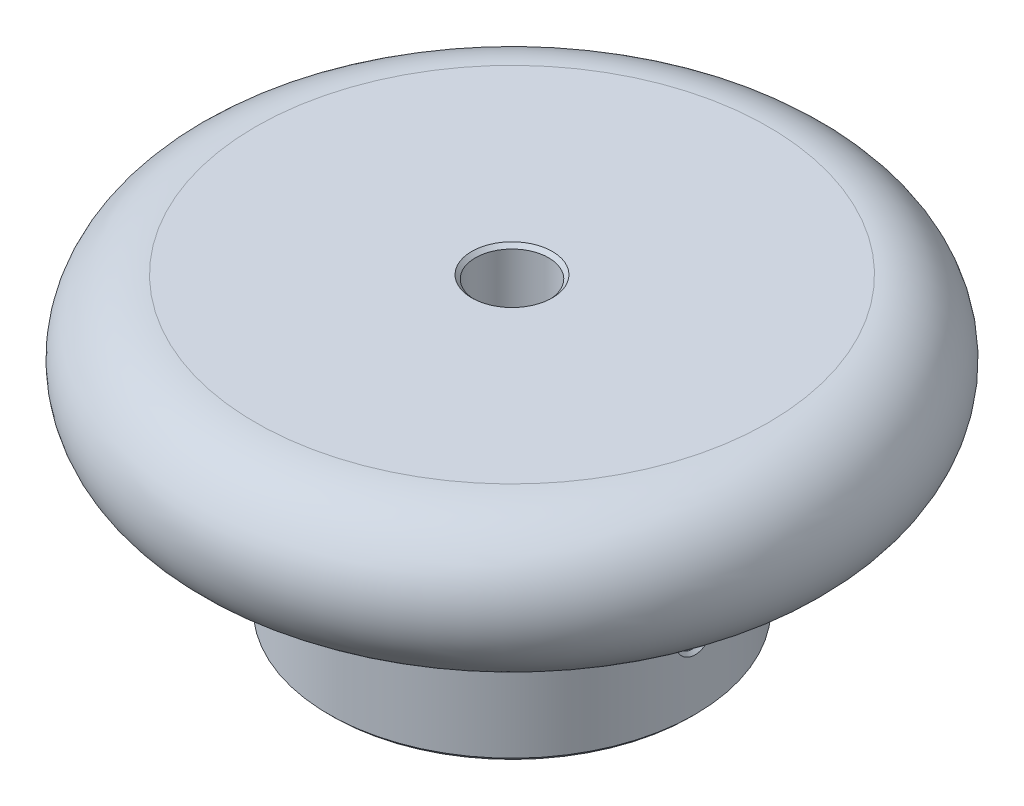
ISO-10303-21;
HEADER;
FILE_DESCRIPTION(('STEP AP214'),'2;1');
FILE_NAME('part.step','',(''),(''),'','','');
FILE_SCHEMA(('AUTOMOTIVE_DESIGN { 1 0 10303 214 1 1 1 1 }'));
ENDSEC;
DATA;
#1=APPLICATION_CONTEXT('core data for automotive mechanical design processes');
#2=APPLICATION_PROTOCOL_DEFINITION('international standard','automotive_design',2000,#1);
#3=PRODUCT_CONTEXT('',#1,'mechanical');
#4=PRODUCT('Part','Part','',(#3));
#5=PRODUCT_RELATED_PRODUCT_CATEGORY('part','',(#4));
#6=PRODUCT_DEFINITION_FORMATION('','',#4);
#7=PRODUCT_DEFINITION_CONTEXT('part definition',#1,'design');
#8=PRODUCT_DEFINITION('design','',#6,#7);
#9=PRODUCT_DEFINITION_SHAPE('','',#8);
#10=(LENGTH_UNIT() NAMED_UNIT(*) SI_UNIT(.MILLI.,.METRE.));
#11=(NAMED_UNIT(*) PLANE_ANGLE_UNIT() SI_UNIT($,.RADIAN.));
#12=(NAMED_UNIT(*) SI_UNIT($,.STERADIAN.) SOLID_ANGLE_UNIT());
#13=UNCERTAINTY_MEASURE_WITH_UNIT(LENGTH_MEASURE(1.E-05),#10,'distance_accuracy_value','');
#14=(GEOMETRIC_REPRESENTATION_CONTEXT(3) GLOBAL_UNCERTAINTY_ASSIGNED_CONTEXT((#13)) GLOBAL_UNIT_ASSIGNED_CONTEXT((#10,
#11,#12)) REPRESENTATION_CONTEXT('',''));
#15=CARTESIAN_POINT('',(0.,0.,0.));
#16=DIRECTION('',(0.,0.,1.));
#17=DIRECTION('',(1.,0.,0.));
#18=AXIS2_PLACEMENT_3D('',#15,#16,#17);
#19=CARTESIAN_POINT('',(-5.,0.,0.));
#20=DIRECTION('',(0.,1.,0.));
#21=DIRECTION('',(-1.,0.,0.));
#22=AXIS2_PLACEMENT_3D('',#19,#20,#21);
#23=PLANE('',#22);
#24=CARTESIAN_POINT('',(0.,0.,0.));
#25=DIRECTION('',(0.,1.,0.));
#26=DIRECTION('',(-1.,0.,0.));
#27=AXIS2_PLACEMENT_3D('',#24,#25,#26);
#28=CIRCLE('',#27,5.49999999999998);
#29=CARTESIAN_POINT('',(-5.49999999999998,0.,0.));
#30=VERTEX_POINT('',#29);
#31=EDGE_CURVE('E10',#30,#30,#28,.F.);
#32=ORIENTED_EDGE('',*,*,#31,.T.);
#33=EDGE_LOOP('',(#32));
#34=FACE_BOUND('',#33,.T.);
#35=CARTESIAN_POINT('',(0.,0.,0.));
#36=DIRECTION('',(0.,1.,0.));
#37=DIRECTION('',(-1.,0.,0.));
#38=AXIS2_PLACEMENT_3D('',#35,#36,#37);
#39=CIRCLE('',#38,35.);
#40=CARTESIAN_POINT('',(-35.,0.,0.));
#41=VERTEX_POINT('',#40);
#42=EDGE_CURVE('E318',#41,#41,#39,.T.);
#43=ORIENTED_EDGE('',*,*,#42,.T.);
#44=EDGE_LOOP('',(#43));
#45=FACE_BOUND('',#44,.T.);
#46=ADVANCED_FACE('F29',(#34,#45),#23,.T.);
#47=CARTESIAN_POINT('',(0.,-10.,0.));
#48=DIRECTION('',(0.,1.,0.));
#49=DIRECTION('',(-1.,0.,0.));
#50=AXIS2_PLACEMENT_3D('',#47,#48,#49);
#51=TOROIDAL_SURFACE('',#50,35.,10.);
#52=CARTESIAN_POINT('',(0.,-20.,0.));
#53=DIRECTION('',(0.,1.,0.));
#54=DIRECTION('',(-1.,0.,0.));
#55=AXIS2_PLACEMENT_3D('',#52,#53,#54);
#56=CIRCLE('',#55,34.9999999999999);
#57=CARTESIAN_POINT('',(-34.9999999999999,-20.,0.));
#58=VERTEX_POINT('',#57);
#59=EDGE_CURVE('E322',#58,#58,#56,.T.);
#60=ORIENTED_EDGE('',*,*,#59,.T.);
#61=EDGE_LOOP('',(#60));
#62=FACE_BOUND('',#61,.T.);
#63=ORIENTED_EDGE('',*,*,#42,.F.);
#64=EDGE_LOOP('',(#63));
#65=FACE_BOUND('',#64,.T.);
#66=ADVANCED_FACE('F293',(#62,#65),#51,.T.);
#67=CARTESIAN_POINT('',(-34.9999999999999,-20.,0.));
#68=DIRECTION('',(0.,-1.,0.));
#69=DIRECTION('',(1.,0.,0.));
#70=AXIS2_PLACEMENT_3D('',#67,#68,#69);
#71=PLANE('',#70);
#72=CARTESIAN_POINT('',(0.,-20.,0.));
#73=DIRECTION('',(0.,-1.,0.));
#74=DIRECTION('',(1.,0.,0.));
#75=AXIS2_PLACEMENT_3D('',#72,#73,#74);
#76=CIRCLE('',#75,25.5);
#77=CARTESIAN_POINT('',(25.5,-20.,0.));
#78=VERTEX_POINT('',#77);
#79=EDGE_CURVE('E316',#78,#78,#76,.F.);
#80=ORIENTED_EDGE('',*,*,#79,.T.);
#81=EDGE_LOOP('',(#80));
#82=FACE_BOUND('',#81,.T.);
#83=ORIENTED_EDGE('',*,*,#59,.F.);
#84=EDGE_LOOP('',(#83));
#85=FACE_BOUND('',#84,.T.);
#86=ADVANCED_FACE('F298',(#82,#85),#71,.T.);
#87=CARTESIAN_POINT('',(0.,0.,0.));
#88=DIRECTION('',(0.,1.,0.));
#89=DIRECTION('',(-1.,0.,0.));
#90=AXIS2_PLACEMENT_3D('',#87,#88,#89);
#91=CYLINDRICAL_SURFACE('',#90,25.);
#92=CARTESIAN_POINT('',(0.,-20.5,0.));
#93=DIRECTION('',(0.,-1.,0.));
#94=DIRECTION('',(1.,0.,0.));
#95=AXIS2_PLACEMENT_3D('',#92,#93,#94);
#96=CIRCLE('',#95,25.);
#97=CARTESIAN_POINT('',(25.,-20.5,0.));
#98=VERTEX_POINT('',#97);
#99=EDGE_CURVE('E197',#98,#98,#96,.T.);
#100=ORIENTED_EDGE('',*,*,#99,.T.);
#101=EDGE_LOOP('',(#100));
#102=FACE_BOUND('',#101,.T.);
#103=CARTESIAN_POINT('',(0.,-39.5,0.));
#104=DIRECTION('',(0.,-1.,0.));
#105=DIRECTION('',(1.,0.,0.));
#106=AXIS2_PLACEMENT_3D('',#103,#104,#105);
#107=CIRCLE('',#106,25.);
#108=CARTESIAN_POINT('',(25.,-39.5,0.));
#109=VERTEX_POINT('',#108);
#110=EDGE_CURVE('E346',#109,#109,#107,.F.);
#111=ORIENTED_EDGE('',*,*,#110,.T.);
#112=EDGE_LOOP('',(#111));
#113=FACE_BOUND('',#112,.T.);
#114=CARTESIAN_POINT('',(24.8753766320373,-30.,-2.49311801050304));
#115=CARTESIAN_POINT('',(24.8753775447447,-29.3566363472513,-2.49310531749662));
#116=CARTESIAN_POINT('',(24.9045191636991,-28.720744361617,-2.22400849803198));
#117=CARTESIAN_POINT('',(24.9710253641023,-27.8127930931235,-1.30162024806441));
#118=CARTESIAN_POINT('',(24.9999996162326,-27.5488915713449,-0.654992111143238));
#119=CARTESIAN_POINT('',(25.0000003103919,-27.5490307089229,0.652283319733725));
#120=CARTESIAN_POINT('',(24.971094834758,-27.8117018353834,1.29976174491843));
#121=CARTESIAN_POINT('',(24.9045644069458,-28.7202407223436,2.22424381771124));
#122=CARTESIAN_POINT('',(24.8753788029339,-29.3534233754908,2.4930924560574));
#123=CARTESIAN_POINT('',(24.8753744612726,-30.6464639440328,2.49314356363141));
#124=CARTESIAN_POINT('',(24.9045510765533,-31.2795284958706,2.22436785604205));
#125=CARTESIAN_POINT('',(24.9710817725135,-32.1881620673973,1.30001122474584));
#126=CARTESIAN_POINT('',(25.0000001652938,-32.4509651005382,0.652360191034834));
#127=CARTESIAN_POINT('',(24.9999997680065,-32.4511126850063,-0.654942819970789));
#128=CARTESIAN_POINT('',(24.9710346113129,-32.1873043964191,-1.30143003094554));
#129=CARTESIAN_POINT('',(24.9045292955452,-31.2794276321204,-2.22392455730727));
#130=CARTESIAN_POINT('',(24.8753757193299,-30.6433636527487,-2.49313070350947));
#131=CARTESIAN_POINT('',(24.8753766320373,-30.,-2.49311801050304));
#132=B_SPLINE_CURVE_WITH_KNOTS('',3,(#114,#115,#116,#117,#118,#119,#120,#121,#122,#123,#124,
#125,#126,#127,#128,#129,#130,#131),.UNSPECIFIED.,.T.,.F.,(4,2,2,2,2,2,2,2,4),
(-2.22585629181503E-06,0.0019145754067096,0.00383137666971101,0.00574817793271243,
0.00766497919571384,0.00958178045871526,0.0114985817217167,0.0134153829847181,
0.0153321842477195),.UNSPECIFIED.);
#133=CARTESIAN_POINT('',(24.8753766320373,-30.,-2.49311801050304));
#134=VERTEX_POINT('',#133);
#135=EDGE_CURVE('E320',#134,#134,#132,.F.);
#136=ORIENTED_EDGE('',*,*,#135,.T.);
#137=EDGE_LOOP('',(#136));
#138=FACE_BOUND('',#137,.T.);
#139=CARTESIAN_POINT('',(-25.,-32.4510392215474,0.));
#140=CARTESIAN_POINT('',(-24.9999997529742,-32.4510360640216,0.0408749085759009));
#141=CARTESIAN_POINT('',(-24.9998863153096,-32.450000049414,0.0817481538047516));
#142=CARTESIAN_POINT('',(-24.9994448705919,-32.4458964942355,0.163348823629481));
#143=CARTESIAN_POINT('',(-24.9991170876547,-32.4428310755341,0.204076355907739));
#144=CARTESIAN_POINT('',(-24.9982590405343,-32.4347058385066,0.285298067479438));
#145=CARTESIAN_POINT('',(-24.9977289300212,-32.4296475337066,0.325792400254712));
#146=CARTESIAN_POINT('',(-24.9964783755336,-32.4175741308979,0.406461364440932));
#147=CARTESIAN_POINT('',(-24.9957580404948,-32.4105601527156,0.446636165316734));
#148=CARTESIAN_POINT('',(-24.9941391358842,-32.394612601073,0.526579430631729));
#149=CARTESIAN_POINT('',(-24.9932406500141,-32.3856799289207,0.566348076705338));
#150=CARTESIAN_POINT('',(-24.9912775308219,-32.3659320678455,0.645392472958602));
#151=CARTESIAN_POINT('',(-24.9902129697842,-32.3551176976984,0.684668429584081));
#152=CARTESIAN_POINT('',(-24.9879297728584,-32.331643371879,0.762640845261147));
#153=CARTESIAN_POINT('',(-24.9867112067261,-32.3189842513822,0.801337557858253));
#154=CARTESIAN_POINT('',(-24.9841320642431,-32.2918572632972,0.878064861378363));
#155=CARTESIAN_POINT('',(-24.9827715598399,-32.2773903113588,0.916095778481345));
#156=CARTESIAN_POINT('',(-24.9799206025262,-32.2466844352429,0.991404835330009));
#157=CARTESIAN_POINT('',(-24.9784302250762,-32.2304465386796,1.02868339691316));
#158=CARTESIAN_POINT('',(-24.9753315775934,-32.196235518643,1.10240106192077));
#159=CARTESIAN_POINT('',(-24.9737233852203,-32.1782635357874,1.13884069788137));
#160=CARTESIAN_POINT('',(-24.9704011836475,-32.1406210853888,1.21079381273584));
#161=CARTESIAN_POINT('',(-24.9686872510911,-32.1209518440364,1.24630793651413));
#162=CARTESIAN_POINT('',(-24.9651655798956,-32.07995165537,1.31632333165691));
#163=CARTESIAN_POINT('',(-24.9633579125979,-32.0586219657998,1.35082534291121));
#164=CARTESIAN_POINT('',(-24.9596610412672,-32.0143376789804,1.41872981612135));
#165=CARTESIAN_POINT('',(-24.9577718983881,-31.9913842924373,1.45213307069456));
#166=CARTESIAN_POINT('',(-24.9539234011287,-31.9438896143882,1.5177534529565));
#167=CARTESIAN_POINT('',(-24.9519640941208,-31.9193493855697,1.54997135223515));
#168=CARTESIAN_POINT('',(-24.947990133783,-31.8687176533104,1.61313424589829));
#169=CARTESIAN_POINT('',(-24.9459755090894,-31.842626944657,1.64407987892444));
#170=CARTESIAN_POINT('',(-24.9418925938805,-31.7889327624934,1.70461261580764));
#171=CARTESIAN_POINT('',(-24.9398243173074,-31.7613296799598,1.7342000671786));
#172=CARTESIAN_POINT('',(-24.9356871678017,-31.7046729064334,1.79189648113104));
#173=CARTESIAN_POINT('',(-24.9336182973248,-31.6756206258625,1.82000682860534));
#174=CARTESIAN_POINT('',(-24.9295333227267,-31.6161743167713,1.87467562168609));
#175=CARTESIAN_POINT('',(-24.9275171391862,-31.5857825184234,1.90123648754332));
#176=CARTESIAN_POINT('',(-24.9235393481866,-31.5237448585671,1.95277117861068));
#177=CARTESIAN_POINT('',(-24.9215776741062,-31.4921006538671,1.97774699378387));
#178=CARTESIAN_POINT('',(-24.9177238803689,-31.4276439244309,2.02607523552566));
#179=CARTESIAN_POINT('',(-24.9158316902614,-31.3948326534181,2.04942932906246));
#180=CARTESIAN_POINT('',(-24.9121283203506,-31.3281278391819,2.09447795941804));
#181=CARTESIAN_POINT('',(-24.9103170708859,-31.2942352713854,2.11617393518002));
#182=CARTESIAN_POINT('',(-24.906787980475,-31.2254536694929,2.15786998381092));
#183=CARTESIAN_POINT('',(-24.9050700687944,-31.190565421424,2.17787134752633));
#184=CARTESIAN_POINT('',(-24.9017398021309,-31.1198782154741,2.21614176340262));
#185=CARTESIAN_POINT('',(-24.9001273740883,-31.0840799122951,2.23441201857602));
#186=CARTESIAN_POINT('',(-24.8970202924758,-31.0116582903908,2.26918374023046));
#187=CARTESIAN_POINT('',(-24.8955255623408,-30.9750355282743,2.28568635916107));
#188=CARTESIAN_POINT('',(-24.8926660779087,-30.9010506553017,2.31688629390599));
#189=CARTESIAN_POINT('',(-24.8913012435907,-30.8636890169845,2.33158472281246));
#190=CARTESIAN_POINT('',(-24.8887137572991,-30.7883120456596,2.35913974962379));
#191=CARTESIAN_POINT('',(-24.8874910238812,-30.7502971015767,2.37199740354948));
#192=CARTESIAN_POINT('',(-24.8851999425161,-30.6736991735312,2.39583437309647));
#193=CARTESIAN_POINT('',(-24.884131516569,-30.6351164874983,2.40681463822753));
#194=CARTESIAN_POINT('',(-24.8821612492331,-30.5574687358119,2.42686036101));
#195=CARTESIAN_POINT('',(-24.8812593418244,-30.5184038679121,2.43592657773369));
#196=CARTESIAN_POINT('',(-24.8796342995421,-30.439877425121,2.45210786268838));
#197=CARTESIAN_POINT('',(-24.8789111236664,-30.400415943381,2.4592233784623));
#198=CARTESIAN_POINT('',(-24.8776557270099,-30.3211819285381,2.4714668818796));
#199=CARTESIAN_POINT('',(-24.8771235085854,-30.2814093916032,2.47659484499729));
#200=CARTESIAN_POINT('',(-24.8762621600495,-30.201638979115,2.48482762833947));
#201=CARTESIAN_POINT('',(-24.8759331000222,-30.1616410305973,2.48793175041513));
#202=CARTESIAN_POINT('',(-24.8754902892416,-30.0815052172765,2.49207919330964));
#203=CARTESIAN_POINT('',(-24.875376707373,-30.0413672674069,2.49312089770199));
#204=CARTESIAN_POINT('',(-24.8753766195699,-29.9610886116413,2.49311449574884));
#205=CARTESIAN_POINT('',(-24.875490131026,-29.9209479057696,2.49206622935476));
#206=CARTESIAN_POINT('',(-24.875932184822,-29.8408007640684,2.48791778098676));
#207=CARTESIAN_POINT('',(-24.8762605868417,-29.8007942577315,2.48481893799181));
#208=CARTESIAN_POINT('',(-24.8771202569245,-29.7210012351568,2.47660385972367));
#209=CARTESIAN_POINT('',(-24.8776514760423,-29.6812146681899,2.47148811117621));
#210=CARTESIAN_POINT('',(-24.8789045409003,-29.6019473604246,2.45927570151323));
#211=CARTESIAN_POINT('',(-24.8796263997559,-29.5624666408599,2.45217890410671));
#212=CARTESIAN_POINT('',(-24.8812485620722,-29.4838967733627,2.43604005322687));
#213=CARTESIAN_POINT('',(-24.8821489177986,-29.4448077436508,2.42699742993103));
#214=CARTESIAN_POINT('',(-24.8841159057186,-29.3671070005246,2.40700255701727));
#215=CARTESIAN_POINT('',(-24.8851826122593,-29.3284955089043,2.39604945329));
#216=CARTESIAN_POINT('',(-24.8874701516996,-29.251835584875,2.37226906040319));
#217=CARTESIAN_POINT('',(-24.8886910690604,-29.2137874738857,2.35944074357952));
#218=CARTESIAN_POINT('',(-24.8912748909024,-29.1383400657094,2.33194526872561));
#219=CARTESIAN_POINT('',(-24.8926378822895,-29.1009411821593,2.31727698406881));
#220=CARTESIAN_POINT('',(-24.8954937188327,-29.0268779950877,2.28613684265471));
#221=CARTESIAN_POINT('',(-24.8969866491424,-28.9902141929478,2.26966380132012));
#222=CARTESIAN_POINT('',(-24.9000902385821,-28.917706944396,2.23494937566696));
#223=CARTESIAN_POINT('',(-24.9017009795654,-28.8818640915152,2.21670675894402));
#224=CARTESIAN_POINT('',(-24.9050280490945,-28.8110845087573,2.17848840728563));
#225=CARTESIAN_POINT('',(-24.9067444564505,-28.7761484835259,2.1585113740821));
#226=CARTESIAN_POINT('',(-24.9102707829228,-28.7072683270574,2.11685941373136));
#227=CARTESIAN_POINT('',(-24.9120807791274,-28.6733250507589,2.0951830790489));
#228=CARTESIAN_POINT('',(-24.9157819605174,-28.6065160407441,2.05016785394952));
#229=CARTESIAN_POINT('',(-24.9176732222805,-28.5736513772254,2.02682738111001));
#230=CARTESIAN_POINT('',(-24.9215255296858,-28.5090854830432,1.97851901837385));
#231=CARTESIAN_POINT('',(-24.9234866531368,-28.4773856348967,1.95354928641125));
#232=CARTESIAN_POINT('',(-24.9274638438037,-28.4152340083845,1.90201861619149));
#233=CARTESIAN_POINT('',(-24.9294799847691,-28.38478405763,1.87545547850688));
#234=CARTESIAN_POINT('',(-24.9335652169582,-28.3252210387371,1.82077060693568));
#235=CARTESIAN_POINT('',(-24.9356343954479,-28.2961104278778,1.79264620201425));
#236=CARTESIAN_POINT('',(-24.9397725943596,-28.2393405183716,1.73492799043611));
#237=CARTESIAN_POINT('',(-24.9418416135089,-28.2116823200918,1.70533310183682));
#238=CARTESIAN_POINT('',(-24.9459263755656,-28.1578857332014,1.64480569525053));
#239=CARTESIAN_POINT('',(-24.9479421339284,-28.131746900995,1.61387357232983));
#240=CARTESIAN_POINT('',(-24.9519184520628,-28.0810280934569,1.55075163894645));
#241=CARTESIAN_POINT('',(-24.9538790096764,-28.0564481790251,1.5185617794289));
#242=CARTESIAN_POINT('',(-24.9577301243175,-28.0088819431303,1.45300769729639));
#243=CARTESIAN_POINT('',(-24.959620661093,-27.985896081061,1.41964314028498));
#244=CARTESIAN_POINT('',(-24.9633203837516,-27.9415539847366,1.35182187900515));
#245=CARTESIAN_POINT('',(-24.9651295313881,-27.9201985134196,1.31736467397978));
#246=CARTESIAN_POINT('',(-24.9686542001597,-27.8791530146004,1.2474404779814));
#247=CARTESIAN_POINT('',(-24.9703696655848,-27.8594639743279,1.21197290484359));
#248=CARTESIAN_POINT('',(-24.9736949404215,-27.8217873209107,1.14011018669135));
#249=CARTESIAN_POINT('',(-24.9753046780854,-27.8038008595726,1.10371443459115));
#250=CARTESIAN_POINT('',(-24.9784063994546,-27.7695653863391,1.03007753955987));
#251=CARTESIAN_POINT('',(-24.9798982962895,-27.7533176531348,0.992835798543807));
#252=CARTESIAN_POINT('',(-24.9827522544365,-27.7225957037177,0.917589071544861));
#253=CARTESIAN_POINT('',(-24.9841142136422,-27.7081228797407,0.87958351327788));
#254=CARTESIAN_POINT('',(-24.9866962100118,-27.6809868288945,0.802891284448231));
#255=CARTESIAN_POINT('',(-24.987916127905,-27.6683251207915,0.76420407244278));
#256=CARTESIAN_POINT('',(-24.9902019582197,-27.6448473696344,0.686230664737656));
#257=CARTESIAN_POINT('',(-24.9912677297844,-27.6340330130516,0.646943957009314));
#258=CARTESIAN_POINT('',(-24.9932331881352,-27.6142859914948,0.567853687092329));
#259=CARTESIAN_POINT('',(-24.9941327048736,-27.605355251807,0.528049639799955));
#260=CARTESIAN_POINT('',(-24.9957535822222,-27.5894114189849,0.448006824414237));
#261=CARTESIAN_POINT('',(-24.9964747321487,-27.5824005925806,0.407767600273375));
#262=CARTESIAN_POINT('',(-24.9977268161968,-27.570332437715,0.326936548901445));
#263=CARTESIAN_POINT('',(-24.9982574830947,-27.565277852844,0.286344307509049));
#264=CARTESIAN_POINT('',(-24.9991165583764,-27.5571578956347,0.204889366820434));
#265=CARTESIAN_POINT('',(-24.9994446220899,-27.5540959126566,0.164026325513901));
#266=CARTESIAN_POINT('',(-24.9998864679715,-27.5499967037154,0.0821117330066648));
#267=CARTESIAN_POINT('',(-24.9999998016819,-27.5489637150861,0.0410599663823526));
#268=CARTESIAN_POINT('',(-25.0000001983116,-27.5489578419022,-0.0410429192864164));
#269=CARTESIAN_POINT('',(-24.9998872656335,-27.5499849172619,-0.0820940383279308));
#270=CARTESIAN_POINT('',(-24.9994462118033,-27.5540724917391,-0.164006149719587));
#271=CARTESIAN_POINT('',(-24.9991185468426,-27.5571286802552,-0.204867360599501));
#272=CARTESIAN_POINT('',(-24.9982602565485,-27.5652372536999,-0.286317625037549));
#273=CARTESIAN_POINT('',(-24.9977299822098,-27.5702861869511,-0.326907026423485));
#274=CARTESIAN_POINT('',(-24.9964786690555,-27.5823432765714,-0.407731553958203));
#275=CARTESIAN_POINT('',(-24.9957579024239,-27.5893486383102,-0.447967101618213));
#276=CARTESIAN_POINT('',(-24.9941377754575,-27.6052818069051,-0.528001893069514));
#277=CARTESIAN_POINT('',(-24.9932386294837,-27.6142073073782,-0.567801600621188));
#278=CARTESIAN_POINT('',(-24.9912738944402,-27.6339441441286,-0.646882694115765));
#279=CARTESIAN_POINT('',(-24.9902084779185,-27.6447535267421,-0.686164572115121));
#280=CARTESIAN_POINT('',(-24.9879233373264,-27.6682216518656,-0.76412799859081));
#281=CARTESIAN_POINT('',(-24.9867037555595,-27.6808786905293,-0.802810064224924));
#282=CARTESIAN_POINT('',(-24.9841224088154,-27.7080057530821,-0.879491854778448));
#283=CARTESIAN_POINT('',(-24.9827607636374,-27.7224742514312,-0.917492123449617));
#284=CARTESIAN_POINT('',(-24.9799074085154,-27.7531879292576,-0.992728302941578));
#285=CARTESIAN_POINT('',(-24.9784158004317,-27.7694317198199,-1.02996478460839));
#286=CARTESIAN_POINT('',(-24.9753146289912,-27.8036597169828,-1.10359137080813));
#287=CARTESIAN_POINT('',(-24.973705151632,-27.8216426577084,-1.13998206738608));
#288=CARTESIAN_POINT('',(-24.9703803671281,-27.8593127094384,-1.21183506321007));
#289=CARTESIAN_POINT('',(-24.9686651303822,-27.8789986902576,-1.24729795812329));
#290=CARTESIAN_POINT('',(-24.965140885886,-27.9200385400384,-1.31721336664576));
#291=CARTESIAN_POINT('',(-24.9633319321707,-27.9413914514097,-1.35166644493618));
#292=CARTESIAN_POINT('',(-24.9596325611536,-27.9857289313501,-1.41948020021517));
#293=CARTESIAN_POINT('',(-24.9577421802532,-28.0087127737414,-1.45284135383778));
#294=CARTESIAN_POINT('',(-24.95389133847,-28.0562754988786,-1.51838956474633));
#295=CARTESIAN_POINT('',(-24.9519308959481,-28.0808539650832,-1.55057692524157));
#296=CARTESIAN_POINT('',(-24.9479547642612,-28.1315704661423,-1.61369495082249));
#297=CARTESIAN_POINT('',(-24.94593907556,-28.1577084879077,-1.64462562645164));
#298=CARTESIAN_POINT('',(-24.9418544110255,-28.2115039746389,-1.70515150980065));
#299=CARTESIAN_POINT('',(-24.9397854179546,-28.2391619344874,-1.73474627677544));
#300=CARTESIAN_POINT('',(-24.9356471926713,-28.2959325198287,-1.79246563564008));
#301=CARTESIAN_POINT('',(-24.9335779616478,-28.3250441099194,-1.82059124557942));
#302=CARTESIAN_POINT('',(-24.9294925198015,-28.3846107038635,-1.87527967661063));
#303=CARTESIAN_POINT('',(-24.9274762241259,-28.415063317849,-1.90184509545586));
#304=CARTESIAN_POINT('',(-24.9234986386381,-28.4772216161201,-1.95338140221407));
#305=CARTESIAN_POINT('',(-24.9215372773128,-28.5089255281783,-1.9783544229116));
#306=CARTESIAN_POINT('',(-24.9176844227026,-28.5735007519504,-2.02667023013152));
#307=CARTESIAN_POINT('',(-24.9157928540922,-28.6063707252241,-2.05001479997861));
#308=CARTESIAN_POINT('',(-24.9120910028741,-28.6731913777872,-2.09503891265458));
#309=CARTESIAN_POINT('',(-24.9102806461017,-28.7071410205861,-2.11671998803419));
#310=CARTESIAN_POINT('',(-24.9067535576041,-28.7760347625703,-2.15838193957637));
#311=CARTESIAN_POINT('',(-24.9050367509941,-28.8109780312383,-2.17836418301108));
#312=CARTESIAN_POINT('',(-24.9017088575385,-28.8817727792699,-2.21659328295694));
#313=CARTESIAN_POINT('',(-24.9000976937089,-28.9176235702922,-2.23484140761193));
#314=CARTESIAN_POINT('',(-24.8969932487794,-28.9901471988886,-2.26956699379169));
#315=CARTESIAN_POINT('',(-24.8954998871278,-29.0268194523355,-2.28604566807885));
#316=CARTESIAN_POINT('',(-24.8926431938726,-29.1008998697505,-2.3171970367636));
#317=CARTESIAN_POINT('',(-24.8912797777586,-29.1383075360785,-2.33187090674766));
#318=CARTESIAN_POINT('',(-24.8886951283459,-29.2137726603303,-2.35937733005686));
#319=CARTESIAN_POINT('',(-24.8874738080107,-29.2518297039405,-2.37221101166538));
#320=CARTESIAN_POINT('',(-24.8851855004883,-29.3285074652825,-2.3960017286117));
#321=CARTESIAN_POINT('',(-24.884118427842,-29.367127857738,-2.40695980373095));
#322=CARTESIAN_POINT('',(-24.8821507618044,-29.4448461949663,-2.42696402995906));
#323=CARTESIAN_POINT('',(-24.8812500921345,-29.4839439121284,-2.43601105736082));
#324=CARTESIAN_POINT('',(-24.8796273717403,-29.5625307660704,-2.45215794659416));
#325=CARTESIAN_POINT('',(-24.8789052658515,-29.6020197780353,-2.45925840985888));
#326=CARTESIAN_POINT('',(-24.8776517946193,-29.6813031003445,-2.4714771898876));
#327=CARTESIAN_POINT('',(-24.8771204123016,-29.7210973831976,-2.47659568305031));
#328=CARTESIAN_POINT('',(-24.8762605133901,-29.8009050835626,-2.48481514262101));
#329=CARTESIAN_POINT('',(-24.8759320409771,-29.8409185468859,-2.48791566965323));
#330=CARTESIAN_POINT('',(-24.8754899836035,-29.9210786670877,-2.49206606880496));
#331=CARTESIAN_POINT('',(-24.8753765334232,-29.9612253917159,-2.49311465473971));
#332=CARTESIAN_POINT('',(-24.8753768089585,-30.0415144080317,-2.49312058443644));
#333=CARTESIAN_POINT('',(-24.8754905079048,-30.0816566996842,-2.49207817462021));
#334=CARTESIAN_POINT('',(-24.8759335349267,-30.161799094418,-2.48792876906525));
#335=CARTESIAN_POINT('',(-24.876262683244,-30.2017992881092,-2.48482349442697));
#336=CARTESIAN_POINT('',(-24.8771242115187,-30.2815723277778,-2.47658787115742));
#337=CARTESIAN_POINT('',(-24.8776565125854,-30.321345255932,-2.47145830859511));
#338=CARTESIAN_POINT('',(-24.8789120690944,-30.4005784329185,-2.45921125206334));
#339=CARTESIAN_POINT('',(-24.8796353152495,-30.440038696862,-2.45209385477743));
#340=CARTESIAN_POINT('',(-24.8812604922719,-30.5185613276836,-2.43590858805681));
#341=CARTESIAN_POINT('',(-24.8821624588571,-30.5576236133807,-2.42684032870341));
#342=CARTESIAN_POINT('',(-24.8841328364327,-30.6352650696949,-2.40679044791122));
#343=CARTESIAN_POINT('',(-24.8852013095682,-30.6738440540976,-2.39580811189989));
#344=CARTESIAN_POINT('',(-24.8874924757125,-30.7504336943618,-2.37196706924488));
#345=CARTESIAN_POINT('',(-24.8887152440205,-30.7884440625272,-2.35910744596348));
#346=CARTESIAN_POINT('',(-24.8913027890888,-30.8638112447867,-2.33154868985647));
#347=CARTESIAN_POINT('',(-24.8926676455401,-30.9011676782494,-2.31684852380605));
#348=CARTESIAN_POINT('',(-24.8955271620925,-30.975141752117,-2.28564546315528));
#349=CARTESIAN_POINT('',(-24.8970219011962,-31.0117589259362,-2.26914146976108));
#350=CARTESIAN_POINT('',(-24.900128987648,-31.0841692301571,-2.23436748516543));
#351=CARTESIAN_POINT('',(-24.9017414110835,-31.1199618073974,-2.21609634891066));
#352=CARTESIAN_POINT('',(-24.9050716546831,-31.1906376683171,-2.17782479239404));
#353=CARTESIAN_POINT('',(-24.9067895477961,-31.2255202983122,-2.15782317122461));
#354=CARTESIAN_POINT('',(-24.9103185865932,-31.2942910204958,-2.11612736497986));
#355=CARTESIAN_POINT('',(-24.912129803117,-31.3281783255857,-2.0944318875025));
#356=CARTESIAN_POINT('',(-24.9158330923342,-31.3948732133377,-2.04938513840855));
#357=CARTESIAN_POINT('',(-24.917725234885,-31.4276798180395,-2.02603242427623));
#358=CARTESIAN_POINT('',(-24.9215789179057,-31.4921280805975,-1.97770797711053));
#359=CARTESIAN_POINT('',(-24.9235405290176,-31.5237684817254,-1.95273457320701));
#360=CARTESIAN_POINT('',(-24.9275181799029,-31.5857995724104,-1.90120579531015));
#361=CARTESIAN_POINT('',(-24.9295342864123,-31.6161886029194,-1.87464842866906));
#362=CARTESIAN_POINT('',(-24.933619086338,-31.6756309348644,-1.81998813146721));
#363=CARTESIAN_POINT('',(-24.9356878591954,-31.704682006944,-1.79188278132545));
#364=CARTESIAN_POINT('',(-24.9398248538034,-31.7613376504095,-1.73419640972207));
#365=CARTESIAN_POINT('',(-24.9418930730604,-31.7889407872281,-1.70461397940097));
#366=CARTESIAN_POINT('',(-24.9459759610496,-31.8426357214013,-1.64408992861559));
#367=CARTESIAN_POINT('',(-24.9479906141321,-31.8687270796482,-1.61314791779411));
#368=CARTESIAN_POINT('',(-24.9519646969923,-31.919360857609,-1.54999129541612));
#369=CARTESIAN_POINT('',(-24.9539240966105,-31.943902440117,-1.5177760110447));
#370=CARTESIAN_POINT('',(-24.9577728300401,-31.9914003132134,-1.45215992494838));
#371=CARTESIAN_POINT('',(-24.9596621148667,-32.0143555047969,-1.41875832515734));
#372=CARTESIAN_POINT('',(-24.9633593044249,-32.0586437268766,-1.350856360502));
#373=CARTESIAN_POINT('',(-24.9651671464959,-32.0799755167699,-1.31635518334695));
#374=CARTESIAN_POINT('',(-24.9686891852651,-32.1209800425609,-1.2463407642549));
#375=CARTESIAN_POINT('',(-24.9704033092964,-32.1406514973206,-1.21082676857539));
#376=CARTESIAN_POINT('',(-24.973725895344,-32.1782983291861,-1.13887333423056));
#377=CARTESIAN_POINT('',(-24.9753342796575,-32.196272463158,-1.1024332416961));
#378=CARTESIAN_POINT('',(-24.9784332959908,-32.2304875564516,-1.0287142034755));
#379=CARTESIAN_POINT('',(-24.9799238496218,-32.2467273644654,-0.991434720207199));
#380=CARTESIAN_POINT('',(-24.9827751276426,-32.2774366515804,-0.916123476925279));
#381=CARTESIAN_POINT('',(-24.9841357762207,-32.2919050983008,-0.878091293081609));
#382=CARTESIAN_POINT('',(-24.9867151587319,-32.3190344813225,-0.801361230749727));
#383=CARTESIAN_POINT('',(-24.9879338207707,-32.3316945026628,-0.76266302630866));
#384=CARTESIAN_POINT('',(-24.9902171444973,-32.3551698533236,-0.684687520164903));
#385=CARTESIAN_POINT('',(-24.9912817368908,-32.3659843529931,-0.645409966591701));
#386=CARTESIAN_POINT('',(-24.9932448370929,-32.3857315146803,-0.566362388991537));
#387=CARTESIAN_POINT('',(-24.9941432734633,-32.3946633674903,-0.526592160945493));
#388=CARTESIAN_POINT('',(-24.99576198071,-32.4106081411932,-0.446645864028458));
#389=CARTESIAN_POINT('',(-24.9964821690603,-32.4176201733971,-0.406469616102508));
#390=CARTESIAN_POINT('',(-24.9977323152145,-32.4296883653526,-0.325798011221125));
#391=CARTESIAN_POINT('',(-24.9982621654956,-32.4347434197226,-0.285302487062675));
#392=CARTESIAN_POINT('',(-24.99911956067,-32.4428606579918,-0.204078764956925));
#393=CARTESIAN_POINT('',(-24.99944695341,-32.4459213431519,-0.163350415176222));
#394=CARTESIAN_POINT('',(-24.9998874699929,-32.450013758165,-0.0817486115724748));
#395=CARTESIAN_POINT('',(-25.0000003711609,-32.4510433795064,-0.0408750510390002));
#396=CARTESIAN_POINT('',(-25.,-32.4510392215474,0.));
#397=B_SPLINE_CURVE_WITH_KNOTS('',3,(#139,#140,#141,#142,#143,#144,#145,#146,#147,#148,#149,
#150,#151,#152,#153,#154,#155,#156,#157,#158,#159,#160,#161,#162,#163,#164,#165,#166,#167,#168,
#169,#170,#171,#172,#173,#174,#175,#176,#177,#178,#179,#180,#181,#182,#183,#184,#185,#186,#187,
#188,#189,#190,#191,#192,#193,#194,#195,#196,#197,#198,#199,#200,#201,#202,#203,#204,#205,#206,
#207,#208,#209,#210,#211,#212,#213,#214,#215,#216,#217,#218,#219,#220,#221,#222,#223,#224,#225,
#226,#227,#228,#229,#230,#231,#232,#233,#234,#235,#236,#237,#238,#239,#240,#241,#242,#243,#244,
#245,#246,#247,#248,#249,#250,#251,#252,#253,#254,#255,#256,#257,#258,#259,#260,#261,#262,#263,
#264,#265,#266,#267,#268,#269,#270,#271,#272,#273,#274,#275,#276,#277,#278,#279,#280,#281,#282,
#283,#284,#285,#286,#287,#288,#289,#290,#291,#292,#293,#294,#295,#296,#297,#298,#299,#300,#301,
#302,#303,#304,#305,#306,#307,#308,#309,#310,#311,#312,#313,#314,#315,#316,#317,#318,#319,#320,
#321,#322,#323,#324,#325,#326,#327,#328,#329,#330,#331,#332,#333,#334,#335,#336,#337,#338,#339,
#340,#341,#342,#343,#344,#345,#346,#347,#348,#349,#350,#351,#352,#353,#354,#355,#356,#357,#358,
#359,#360,#361,#362,#363,#364,#365,#366,#367,#368,#369,#370,#371,#372,#373,#374,#375,#376,#377,
#378,#379,#380,#381,#382,#383,#384,#385,#386,#387,#388,#389,#390,#391,#392,#393,#394,#395,#396),
.UNSPECIFIED.,.F.,.F.,(4,2,2,2,2,2,2,2,2,2,2,2,2,2,2,2,2,2,2,2,2,2,2,2,2,2,2,2,2,2,2,2,2,2,2,2,
2,2,2,2,2,2,2,2,2,2,2,2,2,2,2,2,2,2,2,2,2,2,2,2,2,2,2,2,2,2,2,2,2,2,2,2,2,2,2,2,2,2,2,2,2,2,2,2,
2,2,2,2,2,2,2,2,2,2,2,2,2,2,2,2,2,2,2,2,2,2,2,2,2,2,2,2,2,2,2,2,2,2,2,2,2,2,2,2,2,2,2,2,4),(0.,
0.122609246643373,0.245090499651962,0.367478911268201,0.489797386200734,0.612058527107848,
0.734266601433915,0.856419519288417,0.978510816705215,1.10053164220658,1.22247274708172,
1.34432648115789,1.46608879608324,1.5877612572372,1.70935306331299,1.8308830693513,
1.95238180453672,2.07376451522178,2.19495225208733,2.31598470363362,2.43689084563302,
2.55769084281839,2.67839797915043,2.79902060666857,2.91956410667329,3.04003285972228,
3.16043222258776,3.28077051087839,3.4010609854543,3.52132383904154,3.64158817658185,
3.76189397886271,3.88229403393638,4.00270330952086,4.12303403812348,4.24333574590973,
4.36364573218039,4.48399099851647,4.60439020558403,4.72485564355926,4.84539520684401,
4.96601436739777,5.08671814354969,5.20751306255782,5.32840911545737,5.44942170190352,
5.57057356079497,5.69189667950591,5.81343417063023,5.93506244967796,6.0566550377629,
6.17825237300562,6.29988460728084,6.42157341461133,6.54333381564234,6.66517600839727,
6.78710719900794,6.90913342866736,7.03126139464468,7.15350026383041,7.27586347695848,
7.39837054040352,7.5210488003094,7.64393519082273,7.76707794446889,7.89021830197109,
8.01309789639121,8.13576557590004,8.25825892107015,8.38060594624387,8.50282683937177,
8.62493572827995,8.74694246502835,8.8688544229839,8.99067830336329,9.1124219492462,
9.23409616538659,9.35571654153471,9.47730527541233,9.59889298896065,9.72052052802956,
9.84206263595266,9.96339627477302,10.0845638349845,10.2055965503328,10.3265163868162,
10.4473379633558,10.5680704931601,10.6887197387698,10.8092899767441,10.9297859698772,
11.0502149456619,11.1705885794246,11.2909249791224,11.4112506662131,11.5316025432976,
11.652029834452,11.7724429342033,11.8927556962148,12.0130217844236,12.1332820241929,
12.2535663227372,12.3738956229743,12.4942838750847,12.6147400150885,12.7352699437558,
12.8558785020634,12.9765714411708,13.097357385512,13.2182497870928,13.3392688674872,
13.4604435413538,13.581813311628,13.7033011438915,13.8248240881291,13.9464121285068,
14.0680835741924,14.1898470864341,14.3117037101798,14.433648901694,14.5556745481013,
14.6777709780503,14.7999289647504,14.9221417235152,15.0444069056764,15.1667285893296,
15.2891192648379,15.4116018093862,15.5342114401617),.UNSPECIFIED.);
#398=CARTESIAN_POINT('',(-25.,-32.4510392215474,0.));
#399=VERTEX_POINT('',#398);
#400=EDGE_CURVE('E110',#399,#399,#397,.F.);
#401=ORIENTED_EDGE('',*,*,#400,.T.);
#402=EDGE_LOOP('',(#401));
#403=FACE_BOUND('',#402,.T.);
#404=ADVANCED_FACE('F333',(#102,#113,#138,#403),#91,.T.);
#405=CARTESIAN_POINT('',(-15.,-40.,0.));
#406=DIRECTION('',(0.,-1.,0.));
#407=DIRECTION('',(1.,0.,0.));
#408=AXIS2_PLACEMENT_3D('',#405,#406,#407);
#409=PLANE('',#408);
#410=CARTESIAN_POINT('',(0.,-40.,0.));
#411=DIRECTION('',(0.,-1.,0.));
#412=DIRECTION('',(1.,0.,0.));
#413=AXIS2_PLACEMENT_3D('',#410,#411,#412);
#414=CIRCLE('',#413,24.5);
#415=CARTESIAN_POINT('',(24.5,-40.,0.));
#416=VERTEX_POINT('',#415);
#417=EDGE_CURVE('E188',#416,#416,#414,.T.);
#418=ORIENTED_EDGE('',*,*,#417,.T.);
#419=EDGE_LOOP('',(#418));
#420=FACE_BOUND('',#419,.T.);
#421=CARTESIAN_POINT('',(0.,-40.,0.));
#422=DIRECTION('',(0.,-1.,0.));
#423=DIRECTION('',(1.,0.,0.));
#424=AXIS2_PLACEMENT_3D('',#421,#422,#423);
#425=CIRCLE('',#424,15.5);
#426=CARTESIAN_POINT('',(15.5,-40.,0.));
#427=VERTEX_POINT('',#426);
#428=EDGE_CURVE('E192',#427,#427,#425,.F.);
#429=ORIENTED_EDGE('',*,*,#428,.T.);
#430=EDGE_LOOP('',(#429));
#431=FACE_BOUND('',#430,.T.);
#432=ADVANCED_FACE('F259',(#420,#431),#409,.T.);
#433=CARTESIAN_POINT('',(0.,0.,0.));
#434=DIRECTION('',(0.,1.,0.));
#435=DIRECTION('',(-1.,0.,0.));
#436=AXIS2_PLACEMENT_3D('',#433,#434,#435);
#437=CYLINDRICAL_SURFACE('',#436,15.);
#438=CARTESIAN_POINT('',(0.,-39.5,0.));
#439=DIRECTION('',(0.,-1.,0.));
#440=DIRECTION('',(1.,0.,0.));
#441=AXIS2_PLACEMENT_3D('',#438,#439,#440);
#442=CIRCLE('',#441,15.);
#443=CARTESIAN_POINT('',(15.,-39.5,0.));
#444=VERTEX_POINT('',#443);
#445=EDGE_CURVE('E273',#444,#444,#442,.T.);
#446=ORIENTED_EDGE('',*,*,#445,.T.);
#447=EDGE_LOOP('',(#446));
#448=FACE_BOUND('',#447,.T.);
#449=CARTESIAN_POINT('',(0.,-10.5,0.));
#450=DIRECTION('',(0.,-1.,0.));
#451=DIRECTION('',(1.,0.,0.));
#452=AXIS2_PLACEMENT_3D('',#449,#450,#451);
#453=CIRCLE('',#452,15.);
#454=CARTESIAN_POINT('',(15.,-10.5,0.));
#455=VERTEX_POINT('',#454);
#456=EDGE_CURVE('E181',#455,#455,#453,.F.);
#457=ORIENTED_EDGE('',*,*,#456,.T.);
#458=EDGE_LOOP('',(#457));
#459=FACE_BOUND('',#458,.T.);
#460=CARTESIAN_POINT('',(14.8036050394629,-30.,-2.41935483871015));
#461=CARTESIAN_POINT('',(14.8036214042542,-30.6570454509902,-2.41923283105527));
#462=CARTESIAN_POINT('',(14.84980688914,-31.3053410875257,-2.15762571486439));
#463=CARTESIAN_POINT('',(14.9544707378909,-32.2304224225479,-1.26363649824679));
#464=CARTESIAN_POINT('',(15.0000091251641,-32.5001293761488,-0.636240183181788));
#465=CARTESIAN_POINT('',(14.9999907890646,-32.4998700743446,0.633971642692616));
#466=CARTESIAN_POINT('',(14.9545681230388,-32.2313606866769,1.2619315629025));
#467=CARTESIAN_POINT('',(14.8498728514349,-31.3058727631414,2.15790735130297));
#468=CARTESIAN_POINT('',(14.8036155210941,-30.6600310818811,2.41925788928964));
#469=CARTESIAN_POINT('',(14.8035945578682,-29.3400170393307,2.41945178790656));
#470=CARTESIAN_POINT('',(14.8498238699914,-28.6946039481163,2.1583079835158));
#471=CARTESIAN_POINT('',(14.9545204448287,-27.7690323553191,1.26237322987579));
#472=CARTESIAN_POINT('',(14.999998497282,-27.5001037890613,0.633894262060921));
#473=CARTESIAN_POINT('',(15.0000013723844,-27.4998970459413,-0.636690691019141));
#474=CARTESIAN_POINT('',(14.9544716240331,-27.7697170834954,-1.26356532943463));
#475=CARTESIAN_POINT('',(14.8498182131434,-28.6944095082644,-2.15759051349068));
#476=CARTESIAN_POINT('',(14.8035886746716,-29.3429545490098,-2.41947684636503));
#477=CARTESIAN_POINT('',(14.8036050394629,-30.,-2.41935483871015));
#478=B_SPLINE_CURVE_WITH_KNOTS('',3,(#460,#461,#462,#463,#464,#465,#466,#467,#468,#469,#470,
#471,#472,#473,#474,#475,#476,#477),.UNSPECIFIED.,.T.,.F.,(4,2,2,2,2,2,2,2,4),
(-0.015646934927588,-0.0136897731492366,-0.0117326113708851,-0.00977544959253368,
-0.00781828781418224,-0.00586112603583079,-0.00390396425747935,-0.00194680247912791,
1.03592992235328E-05),.UNSPECIFIED.);
#479=CARTESIAN_POINT('',(14.8036050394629,-30.,-2.41935483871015));
#480=VERTEX_POINT('',#479);
#481=EDGE_CURVE('E179',#480,#480,#478,.F.);
#482=ORIENTED_EDGE('',*,*,#481,.T.);
#483=EDGE_LOOP('',(#482));
#484=FACE_BOUND('',#483,.T.);
#485=CARTESIAN_POINT('',(-15.,-32.5,0.));
#486=CARTESIAN_POINT('',(-14.9999949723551,-32.4999574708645,-0.635845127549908));
#487=CARTESIAN_POINT('',(-14.9544534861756,-32.2295950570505,-1.26319701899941));
#488=CARTESIAN_POINT('',(-14.8497948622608,-31.3059049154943,-2.15832024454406));
#489=CARTESIAN_POINT('',(-14.8035980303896,-30.657696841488,-2.41947875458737));
#490=CARTESIAN_POINT('',(-14.803612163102,-29.344994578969,-2.41923022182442));
#491=CARTESIAN_POINT('',(-14.8496810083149,-28.6960927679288,-2.15935711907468));
#492=CARTESIAN_POINT('',(-14.9543781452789,-27.7701106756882,-1.26380778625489));
#493=CARTESIAN_POINT('',(-14.9999919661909,-27.5000637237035,-0.638814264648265));
#494=CARTESIAN_POINT('',(-15.0000080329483,-27.4999362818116,0.638586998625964));
#495=CARTESIAN_POINT('',(-14.9544275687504,-27.7698115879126,1.26327415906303));
#496=CARTESIAN_POINT('',(-14.849730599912,-28.6955002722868,2.15902855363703));
#497=CARTESIAN_POINT('',(-14.8036095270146,-29.3448780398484,2.41923871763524));
#498=CARTESIAN_POINT('',(-14.8036006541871,-30.6576649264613,2.41947033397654));
#499=CARTESIAN_POINT('',(-14.8497624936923,-31.3054763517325,2.1585171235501));
#500=CARTESIAN_POINT('',(-14.9544173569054,-32.229406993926,1.26359676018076));
#501=CARTESIAN_POINT('',(-15.0000050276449,-32.5000425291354,0.635845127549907));
#502=CARTESIAN_POINT('',(-15.,-32.5,0.));
#503=B_SPLINE_CURVE_WITH_KNOTS('',3,(#485,#486,#487,#488,#489,#490,#491,#492,#493,#494,#495,
#496,#497,#498,#499,#500,#501,#502),.UNSPECIFIED.,.T.,.F.,(4,2,2,2,2,2,2,2,4),
(-4.11015289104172E-06,0.00195306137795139,0.00391023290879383,0.00586740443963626,
0.00782457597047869,0.00978174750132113,0.0117389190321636,0.013696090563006,
0.0156532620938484),.UNSPECIFIED.);
#504=CARTESIAN_POINT('',(-15.,-32.5,0.));
#505=VERTEX_POINT('',#504);
#506=EDGE_CURVE('E176',#505,#505,#503,.F.);
#507=ORIENTED_EDGE('',*,*,#506,.T.);
#508=EDGE_LOOP('',(#507));
#509=FACE_BOUND('',#508,.T.);
#510=ADVANCED_FACE('F249',(#448,#459,#484,#509),#437,.F.);
#511=CARTESIAN_POINT('',(-5.,-10.,0.));
#512=DIRECTION('',(0.,-1.,0.));
#513=DIRECTION('',(1.,0.,0.));
#514=AXIS2_PLACEMENT_3D('',#511,#512,#513);
#515=PLANE('',#514);
#516=CARTESIAN_POINT('',(0.,-10.,0.));
#517=DIRECTION('',(0.,-1.,0.));
#518=DIRECTION('',(1.,0.,0.));
#519=AXIS2_PLACEMENT_3D('',#516,#517,#518);
#520=CIRCLE('',#519,14.5);
#521=CARTESIAN_POINT('',(14.5,-10.,0.));
#522=VERTEX_POINT('',#521);
#523=EDGE_CURVE('E279',#522,#522,#520,.T.);
#524=ORIENTED_EDGE('',*,*,#523,.T.);
#525=EDGE_LOOP('',(#524));
#526=FACE_BOUND('',#525,.T.);
#527=CARTESIAN_POINT('',(0.,-10.,0.));
#528=DIRECTION('',(0.,-1.,0.));
#529=DIRECTION('',(1.,0.,0.));
#530=AXIS2_PLACEMENT_3D('',#527,#528,#529);
#531=CIRCLE('',#530,5.49999999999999);
#532=CARTESIAN_POINT('',(5.49999999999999,-10.,0.));
#533=VERTEX_POINT('',#532);
#534=EDGE_CURVE('E276',#533,#533,#531,.F.);
#535=ORIENTED_EDGE('',*,*,#534,.T.);
#536=EDGE_LOOP('',(#535));
#537=FACE_BOUND('',#536,.T.);
#538=ADVANCED_FACE('F258',(#526,#537),#515,.T.);
#539=CARTESIAN_POINT('',(0.,0.,0.));
#540=DIRECTION('',(0.,1.,0.));
#541=DIRECTION('',(-1.,0.,0.));
#542=AXIS2_PLACEMENT_3D('',#539,#540,#541);
#543=CYLINDRICAL_SURFACE('',#542,5.);
#544=CARTESIAN_POINT('',(0.,-9.50000000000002,0.));
#545=DIRECTION('',(0.,-1.,0.));
#546=DIRECTION('',(1.,0.,0.));
#547=AXIS2_PLACEMENT_3D('',#544,#545,#546);
#548=CIRCLE('',#547,5.);
#549=CARTESIAN_POINT('',(5.,-9.50000000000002,0.));
#550=VERTEX_POINT('',#549);
#551=EDGE_CURVE('E39',#550,#550,#548,.T.);
#552=ORIENTED_EDGE('',*,*,#551,.T.);
#553=EDGE_LOOP('',(#552));
#554=FACE_BOUND('',#553,.T.);
#555=CARTESIAN_POINT('',(0.,-0.499999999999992,0.));
#556=DIRECTION('',(0.,1.,0.));
#557=DIRECTION('',(-1.,0.,0.));
#558=AXIS2_PLACEMENT_3D('',#555,#556,#557);
#559=CIRCLE('',#558,5.);
#560=CARTESIAN_POINT('',(-5.,-0.499999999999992,0.));
#561=VERTEX_POINT('',#560);
#562=EDGE_CURVE('E44',#561,#561,#559,.T.);
#563=ORIENTED_EDGE('',*,*,#562,.T.);
#564=EDGE_LOOP('',(#563));
#565=FACE_BOUND('',#564,.T.);
#566=ADVANCED_FACE('F215',(#554,#565),#543,.F.);
#567=CARTESIAN_POINT('',(-25.,-30.,0.));
#568=DIRECTION('',(1.,0.,0.));
#569=DIRECTION('',(0.,0.,-1.));
#570=AXIS2_PLACEMENT_3D('',#567,#568,#569);
#571=CYLINDRICAL_SURFACE('',#570,2.);
#572=CARTESIAN_POINT('',(24.4555305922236,-30.,-2.));
#573=CARTESIAN_POINT('',(24.4555304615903,-30.0327911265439,-2.00000115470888));
#574=CARTESIAN_POINT('',(24.4556423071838,-30.0655808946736,-1.99915866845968));
#575=CARTESIAN_POINT('',(24.4560780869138,-30.1310441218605,-1.99581514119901));
#576=CARTESIAN_POINT('',(24.4564018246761,-30.1637176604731,-1.99331563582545));
#577=CARTESIAN_POINT('',(24.4572493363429,-30.2288780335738,-1.98668850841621));
#578=CARTESIAN_POINT('',(24.457773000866,-30.2613649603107,-1.98256177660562));
#579=CARTESIAN_POINT('',(24.4590082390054,-30.326082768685,-1.97271117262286));
#580=CARTESIAN_POINT('',(24.4597197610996,-30.3583137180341,-1.96698773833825));
#581=CARTESIAN_POINT('',(24.4613186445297,-30.4224499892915,-1.95397431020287));
#582=CARTESIAN_POINT('',(24.4622059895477,-30.4543553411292,-1.94668446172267));
#583=CARTESIAN_POINT('',(24.4641444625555,-30.5177709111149,-1.93056868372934));
#584=CARTESIAN_POINT('',(24.4651955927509,-30.5492811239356,-1.92174273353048));
#585=CARTESIAN_POINT('',(24.4674495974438,-30.6118368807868,-1.90258509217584));
#586=CARTESIAN_POINT('',(24.4686524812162,-30.642882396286,-1.89225330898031));
#587=CARTESIAN_POINT('',(24.471197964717,-30.7044392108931,-1.87011425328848));
#588=CARTESIAN_POINT('',(24.4725405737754,-30.7349504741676,-1.85830688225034));
#589=CARTESIAN_POINT('',(24.4753534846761,-30.7953692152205,-1.83324683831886));
#590=CARTESIAN_POINT('',(24.4768237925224,-30.8252766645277,-1.81999409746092));
#591=CARTESIAN_POINT('',(24.4798800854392,-30.8844181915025,-1.79207346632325));
#592=CARTESIAN_POINT('',(24.4814660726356,-30.9136522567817,-1.77740555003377));
#593=CARTESIAN_POINT('',(24.4847416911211,-30.9713774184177,-1.74668470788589));
#594=CARTESIAN_POINT('',(24.486431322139,-30.9998685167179,-1.73063178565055));
#595=CARTESIAN_POINT('',(24.4899022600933,-31.056038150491,-1.69717109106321));
#596=CARTESIAN_POINT('',(24.4916835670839,-31.0837166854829,-1.67976331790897));
#597=CARTESIAN_POINT('',(24.4953256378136,-31.1381916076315,-1.64362308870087));
#598=CARTESIAN_POINT('',(24.4971864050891,-31.1649879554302,-1.62489057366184));
#599=CARTESIAN_POINT('',(24.5009761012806,-31.2176289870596,-1.58613117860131));
#600=CARTESIAN_POINT('',(24.5029050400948,-31.2434735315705,-1.56610411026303));
#601=CARTESIAN_POINT('',(24.5068163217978,-31.2941413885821,-1.52478563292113));
#602=CARTESIAN_POINT('',(24.5087986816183,-31.3189643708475,-1.50349382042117));
#603=CARTESIAN_POINT('',(24.5128149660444,-31.367520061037,-1.45967732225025));
#604=CARTESIAN_POINT('',(24.5148489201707,-31.3912521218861,-1.43715192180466));
#605=CARTESIAN_POINT('',(24.5189161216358,-31.4375306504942,-1.39091950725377));
#606=CARTESIAN_POINT('',(24.520949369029,-31.460077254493,-1.36721262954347));
#607=CARTESIAN_POINT('',(24.5249629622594,-31.5039270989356,-1.31870611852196));
#608=CARTESIAN_POINT('',(24.5269433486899,-31.5252313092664,-1.29390736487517));
#609=CARTESIAN_POINT('',(24.530849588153,-31.566567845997,-1.24328833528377));
#610=CARTESIAN_POINT('',(24.5327754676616,-31.586600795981,-1.21746857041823));
#611=CARTESIAN_POINT('',(24.5365581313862,-31.6253657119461,-1.16487723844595));
#612=CARTESIAN_POINT('',(24.5384149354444,-31.6440980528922,-1.13810594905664));
#613=CARTESIAN_POINT('',(24.5420483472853,-31.6802326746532,-1.08368152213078));
#614=CARTESIAN_POINT('',(24.5438249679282,-31.6976351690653,-1.05602852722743));
#615=CARTESIAN_POINT('',(24.5472859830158,-31.7310808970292,-0.999910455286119));
#616=CARTESIAN_POINT('',(24.5489703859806,-31.7471242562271,-0.971445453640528));
#617=CARTESIAN_POINT('',(24.5522351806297,-31.7778224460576,-0.913773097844));
#618=CARTESIAN_POINT('',(24.5538155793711,-31.7924773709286,-0.884565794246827));
#619=CARTESIAN_POINT('',(24.5568605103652,-31.8203693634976,-0.825478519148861));
#620=CARTESIAN_POINT('',(24.5583250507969,-31.8336065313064,-0.795598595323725));
#621=CARTESIAN_POINT('',(24.561126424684,-31.8586336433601,-0.735235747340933));
#622=CARTESIAN_POINT('',(24.5624632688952,-31.8704237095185,-0.704752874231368));
#623=CARTESIAN_POINT('',(24.5649974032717,-31.8925272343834,-0.64325379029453));
#624=CARTESIAN_POINT('',(24.56619470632,-31.9028408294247,-0.612237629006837));
#625=CARTESIAN_POINT('',(24.5684379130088,-31.9219620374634,-0.54974163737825));
#626=CARTESIAN_POINT('',(24.5694838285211,-31.9307697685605,-0.518261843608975));
#627=CARTESIAN_POINT('',(24.5714124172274,-31.9468498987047,-0.454908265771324));
#628=CARTESIAN_POINT('',(24.5722950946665,-31.9541223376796,-0.42303449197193));
#629=CARTESIAN_POINT('',(24.573885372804,-31.9671026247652,-0.358962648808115));
#630=CARTESIAN_POINT('',(24.574592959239,-31.9728103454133,-0.326764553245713));
#631=CARTESIAN_POINT('',(24.5758212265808,-31.9826319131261,-0.262113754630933));
#632=CARTESIAN_POINT('',(24.5763418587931,-31.9867453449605,-0.229660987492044));
#633=CARTESIAN_POINT('',(24.5771844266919,-31.9933496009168,-0.164570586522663));
#634=CARTESIAN_POINT('',(24.5775062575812,-31.9958395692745,-0.131932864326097));
#635=CARTESIAN_POINT('',(24.5779393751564,-31.9991667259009,-0.0665420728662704));
#636=CARTESIAN_POINT('',(24.5780504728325,-32.0000024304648,-0.0337889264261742));
#637=CARTESIAN_POINT('',(24.5780506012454,-31.9999970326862,0.0317207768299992));
#638=CARTESIAN_POINT('',(24.5779396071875,-31.999155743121,0.0644773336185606));
#639=CARTESIAN_POINT('',(24.5775071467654,-31.9958261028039,0.129881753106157));
#640=CARTESIAN_POINT('',(24.5771858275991,-31.9933389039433,0.16252967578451));
#641=CARTESIAN_POINT('',(24.5763445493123,-31.9867452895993,0.227646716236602));
#642=CARTESIAN_POINT('',(24.5758246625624,-31.9826394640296,0.260115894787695));
#643=CARTESIAN_POINT('',(24.5745981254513,-31.9728378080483,0.324805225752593));
#644=CARTESIAN_POINT('',(24.5738914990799,-31.9671421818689,0.357025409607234));
#645=CARTESIAN_POINT('',(24.5723033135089,-31.9541895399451,0.421146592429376));
#646=CARTESIAN_POINT('',(24.5714217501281,-31.9469324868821,0.453047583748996));
#647=CARTESIAN_POINT('',(24.5694955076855,-31.9308855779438,0.516460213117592));
#648=CARTESIAN_POINT('',(24.5684508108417,-31.9220955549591,0.547971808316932));
#649=CARTESIAN_POINT('',(24.5662101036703,-31.9030111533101,0.610535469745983));
#650=CARTESIAN_POINT('',(24.5650140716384,-31.89271655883,0.641587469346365));
#651=CARTESIAN_POINT('',(24.5624824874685,-31.8706513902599,0.703161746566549));
#652=CARTESIAN_POINT('',(24.5611469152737,-31.8588806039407,0.73368394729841));
#653=CARTESIAN_POINT('',(24.5583480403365,-31.8338913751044,0.794128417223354));
#654=CARTESIAN_POINT('',(24.5568847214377,-31.8206727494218,0.824050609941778));
#655=CARTESIAN_POINT('',(24.5538421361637,-31.7928161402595,0.883224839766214));
#656=CARTESIAN_POINT('',(24.5522628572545,-31.7781780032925,0.91247680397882));
#657=CARTESIAN_POINT('',(24.5490001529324,-31.7475106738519,0.970240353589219));
#658=CARTESIAN_POINT('',(24.5473167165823,-31.7314813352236,0.998751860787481));
#659=CARTESIAN_POINT('',(24.5438574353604,-31.6980599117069,1.05496426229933));
#660=CARTESIAN_POINT('',(24.542081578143,-31.6806676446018,1.08266504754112));
#661=CARTESIAN_POINT('',(24.5384494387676,-31.6445487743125,1.13718587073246));
#662=CARTESIAN_POINT('',(24.5365931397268,-31.6258218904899,1.16400572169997));
#663=CARTESIAN_POINT('',(24.5328111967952,-31.5870620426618,1.21669431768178));
#664=CARTESIAN_POINT('',(24.5308855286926,-31.5670286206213,1.2425627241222));
#665=CARTESIAN_POINT('',(24.5269793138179,-31.5256848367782,1.29327916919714));
#666=CARTESIAN_POINT('',(24.5249987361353,-31.5043737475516,1.31812661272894));
#667=CARTESIAN_POINT('',(24.5209845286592,-31.4605008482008,1.36672816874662));
#668=CARTESIAN_POINT('',(24.5189508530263,-31.4379379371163,1.39048128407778));
#669=CARTESIAN_POINT('',(24.5148825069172,-31.3916331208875,1.43680144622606));
#670=CARTESIAN_POINT('',(24.512847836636,-31.3678913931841,1.45936867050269));
#671=CARTESIAN_POINT('',(24.5088299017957,-31.3193348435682,1.50326183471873));
#672=CARTESIAN_POINT('',(24.5068465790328,-31.2945213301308,1.52458921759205));
#673=CARTESIAN_POINT('',(24.5029333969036,-31.2438852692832,1.56597059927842));
#674=CARTESIAN_POINT('',(24.5010034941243,-31.2180635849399,1.58602565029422));
#675=CARTESIAN_POINT('',(24.4972118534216,-31.165477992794,1.62483409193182));
#676=CARTESIAN_POINT('',(24.4953500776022,-31.1387146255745,1.64358821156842));
#677=CARTESIAN_POINT('',(24.4917060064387,-31.0843115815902,1.6797653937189));
#678=CARTESIAN_POINT('',(24.4899236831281,-31.0566722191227,1.69718892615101));
#679=CARTESIAN_POINT('',(24.486450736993,-31.0005832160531,1.73067574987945));
#680=CARTESIAN_POINT('',(24.4847600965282,-30.9721337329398,1.74673930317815));
#681=CARTESIAN_POINT('',(24.4814824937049,-30.9144903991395,1.77747685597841));
#682=CARTESIAN_POINT('',(24.4798955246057,-30.8852965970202,1.79215094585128));
#683=CARTESIAN_POINT('',(24.4768373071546,-30.8262305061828,1.82008024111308));
#684=CARTESIAN_POINT('',(24.4753660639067,-30.7963581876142,1.83333538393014));
#685=CARTESIAN_POINT('',(24.4725513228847,-30.7360009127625,1.85839742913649));
#686=CARTESIAN_POINT('',(24.4712078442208,-30.7055158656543,1.87020411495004));
#687=CARTESIAN_POINT('',(24.4686606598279,-30.6439989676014,1.89233989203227));
#688=CARTESIAN_POINT('',(24.4674569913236,-30.6129669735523,1.90266858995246));
#689=CARTESIAN_POINT('',(24.4652014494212,-30.5504220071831,1.92181905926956));
#690=CARTESIAN_POINT('',(24.4641496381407,-30.518908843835,1.93064021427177));
#691=CARTESIAN_POINT('',(24.4622098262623,-30.4554673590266,1.94674631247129));
#692=CARTESIAN_POINT('',(24.4613219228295,-30.4235388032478,1.95403034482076));
#693=CARTESIAN_POINT('',(24.4597219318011,-30.3593323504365,1.9670329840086));
#694=CARTESIAN_POINT('',(24.4590099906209,-30.3270541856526,1.97275028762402));
#695=CARTESIAN_POINT('',(24.4577739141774,-30.2622143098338,1.98259035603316));
#696=CARTESIAN_POINT('',(24.4572499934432,-30.2296523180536,1.98671129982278));
#697=CARTESIAN_POINT('',(24.4564019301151,-30.164310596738,1.99332965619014));
#698=CARTESIAN_POINT('',(24.4560780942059,-30.1315306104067,1.99582457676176));
#699=CARTESIAN_POINT('',(24.4556421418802,-30.065818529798,1.99916207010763));
#700=CARTESIAN_POINT('',(24.4555304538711,-30.0328862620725,2.00000129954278));
#701=CARTESIAN_POINT('',(24.4555307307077,-29.9670213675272,1.99999869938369));
#702=CARTESIAN_POINT('',(24.455642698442,-29.9340887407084,1.99915684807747));
#703=CARTESIAN_POINT('',(24.4560792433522,-29.8683753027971,1.99581399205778));
#704=CARTESIAN_POINT('',(24.4564033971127,-29.8355943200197,1.99331629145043));
#705=CARTESIAN_POINT('',(24.4572521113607,-29.770250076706,1.98669231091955));
#706=CARTESIAN_POINT('',(24.4577763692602,-29.7376865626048,1.9825684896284));
#707=CARTESIAN_POINT('',(24.4590131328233,-29.6728432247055,1.97272259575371));
#708=CARTESIAN_POINT('',(24.4597254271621,-29.6405631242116,1.96700231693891));
#709=CARTESIAN_POINT('',(24.4613261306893,-29.5763524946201,1.95399366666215));
#710=CARTESIAN_POINT('',(24.462214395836,-29.5444217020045,1.94670657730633));
#711=CARTESIAN_POINT('',(24.4641549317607,-29.4809755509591,1.93059430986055));
#712=CARTESIAN_POINT('',(24.465207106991,-29.4494599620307,1.92177002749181));
#713=CARTESIAN_POINT('',(24.4674633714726,-29.3869100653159,1.90261325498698));
#714=CARTESIAN_POINT('',(24.4686673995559,-29.3558755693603,1.89228137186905));
#715=CARTESIAN_POINT('',(24.4712152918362,-29.294353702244,1.87013918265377));
#716=CARTESIAN_POINT('',(24.4725591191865,-29.2638661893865,1.85832926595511));
#717=CARTESIAN_POINT('',(24.4753745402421,-29.2035041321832,1.83326072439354));
#718=CARTESIAN_POINT('',(24.4768461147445,-29.1736294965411,1.82000231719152));
#719=CARTESIAN_POINT('',(24.4799049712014,-29.1145590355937,1.79206646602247));
#720=CARTESIAN_POINT('',(24.4814922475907,-29.0853631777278,1.77738909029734));
#721=CARTESIAN_POINT('',(24.4847704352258,-29.0277161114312,1.74664494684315));
#722=CARTESIAN_POINT('',(24.4864613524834,-28.9992649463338,1.73057809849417));
#723=CARTESIAN_POINT('',(24.4899348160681,-28.9431730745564,1.69708467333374));
#724=CARTESIAN_POINT('',(24.4917173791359,-28.915532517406,1.67965784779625));
#725=CARTESIAN_POINT('',(24.4953618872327,-28.8611276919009,1.64347408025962));
#726=CARTESIAN_POINT('',(24.4972238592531,-28.834363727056,1.62471668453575));
#727=CARTESIAN_POINT('',(24.5010158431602,-28.7817776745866,1.58590168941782));
#728=CARTESIAN_POINT('',(24.5029458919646,-28.7559561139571,1.56584337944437));
#729=CARTESIAN_POINT('',(24.5068593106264,-28.7053211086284,1.52445553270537));
#730=CARTESIAN_POINT('',(24.5088427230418,-28.6805085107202,1.50312496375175));
#731=CARTESIAN_POINT('',(24.5128607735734,-28.6319548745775,1.4592253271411));
#732=CARTESIAN_POINT('',(24.5148954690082,-28.6082151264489,1.436654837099));
#733=CARTESIAN_POINT('',(24.5189637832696,-28.5619150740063,1.3903288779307));
#734=CARTESIAN_POINT('',(24.5209974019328,-28.5393549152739,1.36657326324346));
#735=CARTESIAN_POINT('',(24.5250114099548,-28.4954878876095,1.31796811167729));
#736=CARTESIAN_POINT('',(24.5269918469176,-28.4741798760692,1.29311960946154));
#737=CARTESIAN_POINT('',(24.5308977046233,-28.4328426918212,1.24240214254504));
#738=CARTESIAN_POINT('',(24.5328231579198,-28.412812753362,1.21653380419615));
#739=CARTESIAN_POINT('',(24.5366046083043,-28.3740601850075,1.16384633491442));
#740=CARTESIAN_POINT('',(24.5384606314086,-28.3553370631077,1.13702756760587));
#741=CARTESIAN_POINT('',(24.5420921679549,-28.319225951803,1.08250974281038));
#742=CARTESIAN_POINT('',(24.5438677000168,-28.3018376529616,1.05481089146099));
#743=CARTESIAN_POINT('',(24.5473262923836,-28.2684243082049,0.99860304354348));
#744=CARTESIAN_POINT('',(24.5490093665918,-28.252399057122,0.970094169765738));
#745=CARTESIAN_POINT('',(24.5522713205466,-28.2217399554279,0.912336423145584));
#746=CARTESIAN_POINT('',(24.553850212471,-28.207105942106,0.88308763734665));
#747=CARTESIAN_POINT('',(24.5568920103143,-28.1792575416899,0.823920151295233));
#748=CARTESIAN_POINT('',(24.5583549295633,-28.1660429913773,0.794001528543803));
#749=CARTESIAN_POINT('',(24.5611530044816,-28.1410617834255,0.73356443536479));
#750=CARTESIAN_POINT('',(24.5624881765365,-28.1292949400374,0.703046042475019));
#751=CARTESIAN_POINT('',(24.5650189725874,-28.1072374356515,0.641479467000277));
#752=CARTESIAN_POINT('',(24.5662146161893,-28.0969465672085,0.610431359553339));
#753=CARTESIAN_POINT('',(24.5684545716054,-28.0778693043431,0.547875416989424));
#754=CARTESIAN_POINT('',(24.5694989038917,-28.069082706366,0.516367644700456));
#755=CARTESIAN_POINT('',(24.5714244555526,-28.0530422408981,0.452962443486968));
#756=CARTESIAN_POINT('',(24.5723056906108,-28.0457882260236,0.421065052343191));
#757=CARTESIAN_POINT('',(24.5738932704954,-28.0328411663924,0.356950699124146));
#758=CARTESIAN_POINT('',(24.5745996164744,-28.0271481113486,0.324733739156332));
#759=CARTESIAN_POINT('',(24.5758256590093,-28.0173509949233,0.260050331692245));
#760=CARTESIAN_POINT('',(24.5763453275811,-28.0132471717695,0.227583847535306));
#761=CARTESIAN_POINT('',(24.5771862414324,-28.0066569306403,0.162471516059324));
#762=CARTESIAN_POINT('',(24.5775074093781,-28.0041711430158,0.129825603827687));
#763=CARTESIAN_POINT('',(24.5779396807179,-28.0008433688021,0.0644243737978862));
#764=CARTESIAN_POINT('',(24.5780506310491,-28.0000025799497,0.0316689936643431));
#765=CARTESIAN_POINT('',(24.5780504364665,-27.9999980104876,-0.0338393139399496));
#766=CARTESIAN_POINT('',(24.5779393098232,-28.00083409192,-0.0665922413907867));
#767=CARTESIAN_POINT('',(24.5775060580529,-28.0041626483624,-0.131983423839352));
#768=CARTESIAN_POINT('',(24.5771841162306,-28.006653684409,-0.164621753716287));
#769=CARTESIAN_POINT('',(24.5763412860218,-28.0132604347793,-0.229714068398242));
#770=CARTESIAN_POINT('',(24.5758204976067,-28.01737533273,-0.262168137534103));
#771=CARTESIAN_POINT('',(24.5745918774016,-28.027200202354,-0.326822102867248));
#772=CARTESIAN_POINT('',(24.573884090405,-28.0329097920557,-0.359022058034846));
#773=CARTESIAN_POINT('',(24.5722933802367,-28.0458941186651,-0.423098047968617));
#774=CARTESIAN_POINT('',(24.5714104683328,-28.0531687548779,-0.45497410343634));
#775=CARTESIAN_POINT('',(24.5694813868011,-28.0692535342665,-0.518332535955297));
#776=CARTESIAN_POINT('',(24.5684352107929,-28.0780637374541,-0.549814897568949));
#777=CARTESIAN_POINT('',(24.5661914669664,-28.0971900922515,-0.612316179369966));
#778=CARTESIAN_POINT('',(24.5649938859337,-28.1075063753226,-0.643335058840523));
#779=CARTESIAN_POINT('',(24.5624591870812,-28.1296154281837,-0.704839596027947));
#780=CARTESIAN_POINT('',(24.5611220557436,-28.141408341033,-0.735325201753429));
#781=CARTESIAN_POINT('',(24.5583201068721,-28.1664412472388,-0.795693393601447));
#782=CARTESIAN_POINT('',(24.5568552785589,-28.1796813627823,-0.825575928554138));
#783=CARTESIAN_POINT('',(24.5538097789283,-28.2075793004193,-0.884668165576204));
#784=CARTESIAN_POINT('',(24.5522290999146,-28.2222372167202,-0.913877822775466));
#785=CARTESIAN_POINT('',(24.5489637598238,-28.2529413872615,-0.971554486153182));
#786=CARTESIAN_POINT('',(24.5472790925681,-28.2689877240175,-1.00002144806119));
#787=CARTESIAN_POINT('',(24.5438175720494,-28.3024393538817,-1.05614290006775));
#788=CARTESIAN_POINT('',(24.5420407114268,-28.3198447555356,-1.08379732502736));
#789=CARTESIAN_POINT('',(24.5384068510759,-28.3559850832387,-1.13822393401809));
#790=CARTESIAN_POINT('',(24.5365498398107,-28.3747202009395,-1.16499599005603));
#791=CARTESIAN_POINT('',(24.5327668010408,-28.4134905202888,-1.21758802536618));
#792=CARTESIAN_POINT('',(24.5308407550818,-28.4335260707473,-1.24340774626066));
#793=CARTESIAN_POINT('',(24.5269342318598,-28.4748675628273,-1.29402575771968));
#794=CARTESIAN_POINT('',(24.5249537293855,-28.496174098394,-1.31882356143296));
#795=CARTESIAN_POINT('',(24.520939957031,-28.5400284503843,-1.36732694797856));
#796=CARTESIAN_POINT('',(24.5189066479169,-28.5625772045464,-1.39103168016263));
#797=CARTESIAN_POINT('',(24.5148394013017,-28.6088592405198,-1.43725900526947));
#798=CARTESIAN_POINT('',(24.5128054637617,-28.6325926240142,-1.45978149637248));
#799=CARTESIAN_POINT('',(24.5087892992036,-28.6811496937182,-1.5035919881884));
#800=CARTESIAN_POINT('',(24.5068070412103,-28.7059727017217,-1.52488073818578));
#801=CARTESIAN_POINT('',(24.5028960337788,-28.7566396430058,-1.56619282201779));
#802=CARTESIAN_POINT('',(24.5009672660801,-28.7824832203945,-1.58621659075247));
#803=CARTESIAN_POINT('',(24.4971779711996,-28.8351214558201,-1.62496923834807));
#804=CARTESIAN_POINT('',(24.4953174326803,-28.8619159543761,-1.64369833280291));
#805=CARTESIAN_POINT('',(24.4916758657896,-28.916386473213,-1.67983164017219));
#806=CARTESIAN_POINT('',(24.4898948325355,-28.9440624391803,-1.69723593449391));
#807=CARTESIAN_POINT('',(24.4864244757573,-29.0002263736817,-1.7306896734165));
#808=CARTESIAN_POINT('',(24.4847351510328,-29.0287143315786,-1.74673913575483));
#809=CARTESIAN_POINT('',(24.4814601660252,-29.0864327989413,-1.77745313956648));
#810=CARTESIAN_POINT('',(24.4798745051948,-29.1156633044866,-1.79211768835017));
#811=CARTESIAN_POINT('',(24.4768188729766,-29.1747974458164,-1.82003174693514));
#812=CARTESIAN_POINT('',(24.4753488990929,-29.2047010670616,-1.83328128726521));
#813=CARTESIAN_POINT('',(24.4725366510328,-29.2651120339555,-1.85833517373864));
#814=CARTESIAN_POINT('',(24.471194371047,-29.2956193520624,-1.87013958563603));
#815=CARTESIAN_POINT('',(24.4686495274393,-29.3571683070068,-1.89227304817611));
#816=CARTESIAN_POINT('',(24.4674469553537,-29.388209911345,-1.90260218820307));
#817=CARTESIAN_POINT('',(24.4651935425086,-29.4507580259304,-1.92175495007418));
#818=CARTESIAN_POINT('',(24.4641426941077,-29.482264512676,-1.93057864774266));
#819=CARTESIAN_POINT('',(24.462204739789,-29.5456729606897,-1.94669040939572));
#820=CARTESIAN_POINT('',(24.4613176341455,-29.5775749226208,-1.95397847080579));
#821=CARTESIAN_POINT('',(24.459719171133,-29.6417048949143,-1.96698889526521));
#822=CARTESIAN_POINT('',(24.459007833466,-29.6739329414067,-1.97271108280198));
#823=CARTESIAN_POINT('',(24.4577728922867,-29.7386455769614,-1.98255984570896));
#824=CARTESIAN_POINT('',(24.4572493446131,-29.7711302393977,-1.9866859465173));
#825=CARTESIAN_POINT('',(24.456401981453,-29.8362868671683,-1.99331254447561));
#826=CARTESIAN_POINT('',(24.4560782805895,-29.868958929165,-1.99581210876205));
#827=CARTESIAN_POINT('',(24.455642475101,-29.9344201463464,-1.99915657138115));
#828=CARTESIAN_POINT('',(24.455530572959,-29.9672093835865,-1.99999988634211));
#829=CARTESIAN_POINT('',(24.4555305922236,-30.,-2.));
#830=B_SPLINE_CURVE_WITH_KNOTS('',3,(#572,#573,#574,#575,#576,#577,#578,#579,#580,#581,#582,
#583,#584,#585,#586,#587,#588,#589,#590,#591,#592,#593,#594,#595,#596,#597,#598,#599,#600,#601,
#602,#603,#604,#605,#606,#607,#608,#609,#610,#611,#612,#613,#614,#615,#616,#617,#618,#619,#620,
#621,#622,#623,#624,#625,#626,#627,#628,#629,#630,#631,#632,#633,#634,#635,#636,#637,#638,#639,
#640,#641,#642,#643,#644,#645,#646,#647,#648,#649,#650,#651,#652,#653,#654,#655,#656,#657,#658,
#659,#660,#661,#662,#663,#664,#665,#666,#667,#668,#669,#670,#671,#672,#673,#674,#675,#676,#677,
#678,#679,#680,#681,#682,#683,#684,#685,#686,#687,#688,#689,#690,#691,#692,#693,#694,#695,#696,
#697,#698,#699,#700,#701,#702,#703,#704,#705,#706,#707,#708,#709,#710,#711,#712,#713,#714,#715,
#716,#717,#718,#719,#720,#721,#722,#723,#724,#725,#726,#727,#728,#729,#730,#731,#732,#733,#734,
#735,#736,#737,#738,#739,#740,#741,#742,#743,#744,#745,#746,#747,#748,#749,#750,#751,#752,#753,
#754,#755,#756,#757,#758,#759,#760,#761,#762,#763,#764,#765,#766,#767,#768,#769,#770,#771,#772,
#773,#774,#775,#776,#777,#778,#779,#780,#781,#782,#783,#784,#785,#786,#787,#788,#789,#790,#791,
#792,#793,#794,#795,#796,#797,#798,#799,#800,#801,#802,#803,#804,#805,#806,#807,#808,#809,#810,
#811,#812,#813,#814,#815,#816,#817,#818,#819,#820,#821,#822,#823,#824,#825,#826,#827,#828,#829),
.UNSPECIFIED.,.F.,.F.,(4,2,2,2,2,2,2,2,2,2,2,2,2,2,2,2,2,2,2,2,2,2,2,2,2,2,2,2,2,2,2,2,2,2,2,2,
2,2,2,2,2,2,2,2,2,2,2,2,2,2,2,2,2,2,2,2,2,2,2,2,2,2,2,2,2,2,2,2,2,2,2,2,2,2,2,2,2,2,2,2,2,2,2,2,
2,2,2,2,2,2,2,2,2,2,2,2,2,2,2,2,2,2,2,2,2,2,2,2,2,2,2,2,2,2,2,2,2,2,2,2,2,2,2,2,2,2,2,2,4),(0.,
0.0983603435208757,0.196629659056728,0.294845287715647,0.393034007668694,0.491213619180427,
0.589394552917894,0.687581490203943,0.785774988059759,0.883973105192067,0.98217302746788,
1.08037269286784,1.17857241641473,1.27677651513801,1.37499493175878,1.47324485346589,
1.57155231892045,1.66984846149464,1.76806681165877,1.86623660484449,1.96437797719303,
2.06250355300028,2.16062004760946,2.25872987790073,2.35683277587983,2.45492740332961,
2.55301296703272,2.65109083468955,2.74916615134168,2.84724945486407,2.94535828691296,
3.0435187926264,3.141767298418,3.2400267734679,3.33821755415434,3.43637258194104,
3.53451500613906,3.63265977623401,3.73081525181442,3.82898482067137,3.92716851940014,
4.02536465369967,4.12357141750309,4.22178851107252,4.32001875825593,4.41826972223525,
4.51655531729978,4.61489741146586,4.71332741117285,4.81174263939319,4.91004093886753,
5.00825685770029,5.10641728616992,5.20454288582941,5.30264953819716,5.40074980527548,
5.4988543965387,5.59697363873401,5.69511894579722,5.79330428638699,5.89154764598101,
5.98987247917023,6.08830914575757,6.18689632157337,6.28568237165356,6.38446969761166,
6.48306049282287,6.58150279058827,6.67983492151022,6.77808689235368,6.87628180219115,
6.97443728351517,7.07256695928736,7.17068190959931,7.26879214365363,7.36690807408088,
7.46504199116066,7.56320953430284,7.66143115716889,7.75973358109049,7.85815122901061,
7.95658099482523,8.05491950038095,8.15319852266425,8.25144034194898,8.34965931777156,
8.44786348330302,8.54605614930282,8.64423751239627,8.74240626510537,8.84056120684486,
8.9387028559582,9.03683506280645,9.13496662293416,9.23311288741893,9.33129736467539,
9.42955330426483,9.52780116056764,9.62596370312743,9.72407695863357,9.82216673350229,
9.92025019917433,10.0183374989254,10.1164333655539,10.2145387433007,10.3126524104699,
10.4107726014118,10.5088986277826,10.6070324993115,10.705180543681,10.8033550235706,
10.9015757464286,10.9998716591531,11.098176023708,11.196420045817,11.2946301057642,
11.3928237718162,11.491011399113,11.5891977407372,11.6873835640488,11.7855672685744,
11.8837465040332,11.9819197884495,12.08008812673,12.1782566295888,12.2764361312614,
12.3746448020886,12.4729097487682,12.5712685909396),.UNSPECIFIED.);
#831=CARTESIAN_POINT('',(24.4555305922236,-30.,-2.));
#832=VERTEX_POINT('',#831);
#833=EDGE_CURVE('E52',#832,#832,#830,.F.);
#834=ORIENTED_EDGE('',*,*,#833,.T.);
#835=EDGE_LOOP('',(#834));
#836=FACE_BOUND('',#835,.T.);
#837=CARTESIAN_POINT('',(15.2970585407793,-30.,-2.));
#838=CARTESIAN_POINT('',(15.297057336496,-29.9671701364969,-2.0000069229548));
#839=CARTESIAN_POINT('',(15.2972428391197,-29.9343416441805,-1.99916771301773));
#840=CARTESIAN_POINT('',(15.2979672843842,-29.8688073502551,-1.99582647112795));
#841=CARTESIAN_POINT('',(15.2985058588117,-29.8361014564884,-1.99332617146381));
#842=CARTESIAN_POINT('',(15.2999161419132,-29.7708826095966,-1.9866940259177));
#843=CARTESIAN_POINT('',(15.3007876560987,-29.7383695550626,-1.98256313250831));
#844=CARTESIAN_POINT('',(15.3028433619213,-29.6736054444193,-1.97270173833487));
#845=CARTESIAN_POINT('',(15.3040274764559,-29.6413543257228,-1.96697163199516));
#846=CARTESIAN_POINT('',(15.306688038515,-29.5771834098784,-1.95394328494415));
#847=CARTESIAN_POINT('',(15.3081644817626,-29.5452636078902,-1.94664506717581));
#848=CARTESIAN_POINT('',(15.3113893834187,-29.4818245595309,-1.93051185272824));
#849=CARTESIAN_POINT('',(15.3131378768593,-29.4503053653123,-1.92167665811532));
#850=CARTESIAN_POINT('',(15.3168865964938,-29.3877367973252,-1.90250068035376));
#851=CARTESIAN_POINT('',(15.3188868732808,-29.3566875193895,-1.89215959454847));
#852=CARTESIAN_POINT('',(15.3231188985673,-29.2951280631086,-1.87000291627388));
#853=CARTESIAN_POINT('',(15.325350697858,-29.2646180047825,-1.85818700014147));
#854=CARTESIAN_POINT('',(15.330025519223,-29.204206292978,-1.83311166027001));
#855=CARTESIAN_POINT('',(15.3324685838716,-29.174304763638,-1.81985194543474));
#856=CARTESIAN_POINT('',(15.3375457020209,-29.1151794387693,-1.79191995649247));
#857=CARTESIAN_POINT('',(15.3401797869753,-29.0859557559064,-1.77724744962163));
#858=CARTESIAN_POINT('',(15.3456186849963,-29.0282554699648,-1.74652079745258));
#859=CARTESIAN_POINT('',(15.3484235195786,-28.9997789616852,-1.73046647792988));
#860=CARTESIAN_POINT('',(15.3541837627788,-28.9436423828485,-1.69700713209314));
#861=CARTESIAN_POINT('',(15.3571391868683,-28.9159823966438,-1.67960196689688));
#862=CARTESIAN_POINT('',(15.3631800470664,-28.8615481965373,-1.64347184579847));
#863=CARTESIAN_POINT('',(15.3662654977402,-28.8347740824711,-1.62474674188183));
#864=CARTESIAN_POINT('',(15.3725473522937,-28.7821809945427,-1.58600784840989));
#865=CARTESIAN_POINT('',(15.3757437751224,-28.7563621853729,-1.56599383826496));
#866=CARTESIAN_POINT('',(15.3822228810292,-28.7057487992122,-1.52470775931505));
#867=CARTESIAN_POINT('',(15.3855055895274,-28.6809545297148,-1.50343531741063));
#868=CARTESIAN_POINT('',(15.3921535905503,-28.6324600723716,-1.45966509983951));
#869=CARTESIAN_POINT('',(15.3955189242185,-28.6087604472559,-1.43716670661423));
#870=CARTESIAN_POINT('',(15.402246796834,-28.5625438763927,-1.3909918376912));
#871=CARTESIAN_POINT('',(15.4056093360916,-28.5400267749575,-1.36731551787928));
#872=CARTESIAN_POINT('',(15.4122467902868,-28.4962270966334,-1.31886855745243));
#873=CARTESIAN_POINT('',(15.4155217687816,-28.4749436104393,-1.29409874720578));
#874=CARTESIAN_POINT('',(15.4219811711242,-28.4336416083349,-1.24353594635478));
#875=CARTESIAN_POINT('',(15.4251656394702,-28.4136224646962,-1.21774347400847));
#876=CARTESIAN_POINT('',(15.4314200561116,-28.3748788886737,-1.16520432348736));
#877=CARTESIAN_POINT('',(15.4344900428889,-28.356154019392,-1.13845797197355));
#878=CARTESIAN_POINT('',(15.4404971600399,-28.3200290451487,-1.08408046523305));
#879=CARTESIAN_POINT('',(15.4434343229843,-28.3026286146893,-1.05644952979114));
#880=CARTESIAN_POINT('',(15.4491559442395,-28.2691825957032,-1.00037203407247));
#881=CARTESIAN_POINT('',(15.4519404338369,-28.2531367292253,-0.971925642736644));
#882=CARTESIAN_POINT('',(15.4573372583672,-28.2224299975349,-0.914286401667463));
#883=CARTESIAN_POINT('',(15.4599496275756,-28.2077688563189,-0.885093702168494));
#884=CARTESIAN_POINT('',(15.4649826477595,-28.1798617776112,-0.8260309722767));
#885=CARTESIAN_POINT('',(15.4674033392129,-28.1666155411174,-0.796161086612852));
#886=CARTESIAN_POINT('',(15.4720334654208,-28.1415685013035,-0.735813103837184));
#887=CARTESIAN_POINT('',(15.4742429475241,-28.1297673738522,-0.705335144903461));
#888=CARTESIAN_POINT('',(15.4784311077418,-28.10764078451,-0.643840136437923));
#889=CARTESIAN_POINT('',(15.4804098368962,-28.0973149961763,-0.612823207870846));
#890=CARTESIAN_POINT('',(15.4841169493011,-28.0781692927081,-0.55031939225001));
#891=CARTESIAN_POINT('',(15.4858453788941,-28.0693490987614,-0.518832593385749));
#892=CARTESIAN_POINT('',(15.4890323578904,-28.0532447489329,-0.455458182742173));
#893=CARTESIAN_POINT('',(15.4904909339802,-28.0459604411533,-0.423570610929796));
#894=CARTESIAN_POINT('',(15.4931186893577,-28.03295791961,-0.359463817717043));
#895=CARTESIAN_POINT('',(15.4942878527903,-28.0272397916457,-0.327244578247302));
#896=CARTESIAN_POINT('',(15.4963172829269,-28.0173996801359,-0.262543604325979));
#897=CARTESIAN_POINT('',(15.4971774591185,-28.0132781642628,-0.230061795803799));
#898=CARTESIAN_POINT('',(15.498569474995,-28.0066607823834,-0.164904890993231));
#899=CARTESIAN_POINT('',(15.4991011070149,-28.0041659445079,-0.132229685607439));
#900=CARTESIAN_POINT('',(15.4998165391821,-28.0008327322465,-0.0667549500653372));
#901=CARTESIAN_POINT('',(15.4999999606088,-27.9999961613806,-0.0339553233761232));
#902=CARTESIAN_POINT('',(15.4999999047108,-28.0000045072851,0.0316488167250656));
#903=CARTESIAN_POINT('',(15.4998163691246,-28.0008496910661,0.0644533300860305));
#904=CARTESIAN_POINT('',(15.4991013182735,-28.0041918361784,0.129947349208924));
#905=CARTESIAN_POINT('',(15.4985700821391,-28.0066874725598,0.162636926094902));
#906=CARTESIAN_POINT('',(15.4971792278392,-28.0133015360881,0.227831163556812));
#907=CARTESIAN_POINT('',(15.4963197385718,-28.0174193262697,0.260335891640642));
#908=CARTESIAN_POINT('',(15.4942920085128,-28.0272474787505,0.325090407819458));
#909=CARTESIAN_POINT('',(15.4931237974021,-28.0329576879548,0.357340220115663));
#910=CARTESIAN_POINT('',(15.4904981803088,-28.0459410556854,0.421514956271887));
#911=CARTESIAN_POINT('',(15.4890407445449,-28.0532143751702,0.453439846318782));
#912=CARTESIAN_POINT('',(15.485856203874,-28.0692944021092,0.516894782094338));
#913=CARTESIAN_POINT('',(15.4841290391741,-28.0781014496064,0.548424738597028));
#914=CARTESIAN_POINT('',(15.4804245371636,-28.0972195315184,0.611019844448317));
#915=CARTESIAN_POINT('',(15.4784471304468,-28.1075309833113,0.642084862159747));
#916=CARTESIAN_POINT('',(15.4742616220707,-28.1296285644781,0.703680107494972));
#917=CARTESIAN_POINT('',(15.4720534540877,-28.1414151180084,0.734210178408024));
#918=CARTESIAN_POINT('',(15.4674258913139,-28.1664336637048,0.794665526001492));
#919=CARTESIAN_POINT('',(15.4650064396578,-28.1796660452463,0.824590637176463));
#920=CARTESIAN_POINT('',(15.459975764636,-28.2075470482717,0.883766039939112));
#921=CARTESIAN_POINT('',(15.4573644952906,-28.2221960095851,0.913016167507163));
#922=CARTESIAN_POINT('',(15.4519696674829,-28.2528809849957,0.970771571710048));
#923=CARTESIAN_POINT('',(15.4491860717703,-28.2689172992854,0.999276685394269));
#924=CARTESIAN_POINT('',(15.4434659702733,-28.302347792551,1.05547200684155));
#925=CARTESIAN_POINT('',(15.4405294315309,-28.3197422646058,1.08316203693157));
#926=CARTESIAN_POINT('',(15.434523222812,-28.3558598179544,1.13765723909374));
#927=CARTESIAN_POINT('',(15.4314535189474,-28.3745832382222,1.16446218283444));
#928=CARTESIAN_POINT('',(15.4251992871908,-28.4133295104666,1.21711697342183));
#929=CARTESIAN_POINT('',(15.4220147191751,-28.4333528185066,1.24296648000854));
#930=CARTESIAN_POINT('',(15.4155545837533,-28.4746691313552,1.29364143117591));
#931=CARTESIAN_POINT('',(15.4122789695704,-28.4959627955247,1.31846633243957));
#932=CARTESIAN_POINT('',(15.405639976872,-28.5397918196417,1.36701868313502));
#933=CARTESIAN_POINT('',(15.4022765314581,-28.5623281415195,1.39074525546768));
#934=CARTESIAN_POINT('',(15.3955465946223,-28.6085763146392,1.43701329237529));
#935=CARTESIAN_POINT('',(15.3921801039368,-28.6322879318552,1.45955499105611));
#936=CARTESIAN_POINT('',(15.3855297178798,-28.6807871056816,1.50340265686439));
#937=CARTESIAN_POINT('',(15.3822457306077,-28.7055733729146,1.52471003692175));
#938=CARTESIAN_POINT('',(15.3757643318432,-28.7561571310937,1.56605584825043));
#939=CARTESIAN_POINT('',(15.3725668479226,-28.7819537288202,1.58609536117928));
#940=CARTESIAN_POINT('',(15.3662830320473,-28.8344918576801,1.62487674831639));
#941=CARTESIAN_POINT('',(15.3631966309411,-28.8612327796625,1.64361943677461));
#942=CARTESIAN_POINT('',(15.3571540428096,-28.915593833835,1.67977717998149));
#943=CARTESIAN_POINT('',(15.3541977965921,-28.9432135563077,1.69719284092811));
#944=CARTESIAN_POINT('',(15.3484360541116,-28.9992664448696,1.73066680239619));
#945=CARTESIAN_POINT('',(15.3456305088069,-29.0276993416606,1.74672554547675));
#946=CARTESIAN_POINT('',(15.3401903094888,-29.0853129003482,1.77745580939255));
#947=CARTESIAN_POINT('',(15.3375556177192,-29.1144933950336,1.79212763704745));
#948=CARTESIAN_POINT('',(15.3324773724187,-29.1735364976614,1.8200542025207));
#949=CARTESIAN_POINT('',(15.3300337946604,-29.2033990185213,1.83330912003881));
#950=CARTESIAN_POINT('',(15.3253579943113,-29.2637405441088,1.85837198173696));
#951=CARTESIAN_POINT('',(15.3231257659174,-29.2942195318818,1.87017996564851));
#952=CARTESIAN_POINT('',(15.3188928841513,-29.3557283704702,1.89231909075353));
#953=CARTESIAN_POINT('',(15.3168922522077,-29.3867582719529,1.90265009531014));
#954=CARTESIAN_POINT('',(15.3131427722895,-29.4493033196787,1.9218054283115));
#955=CARTESIAN_POINT('',(15.3113939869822,-29.4808185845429,1.930629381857));
#956=CARTESIAN_POINT('',(15.3081683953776,-29.5442687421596,1.94674084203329));
#957=CARTESIAN_POINT('',(15.3066917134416,-29.576203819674,1.95402764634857));
#958=CARTESIAN_POINT('',(15.3040305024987,-29.6404279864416,1.96703512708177));
#959=CARTESIAN_POINT('',(15.3028461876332,-29.6727173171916,1.97275465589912));
#960=CARTESIAN_POINT('',(15.3007898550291,-29.7375843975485,1.9825980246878));
#961=CARTESIAN_POINT('',(15.2999181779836,-29.7701624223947,1.98672012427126));
#962=CARTESIAN_POINT('',(15.2985072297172,-29.8355412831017,1.99333921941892));
#963=CARTESIAN_POINT('',(15.2979684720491,-29.868342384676,1.99583370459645));
#964=CARTESIAN_POINT('',(15.2972434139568,-29.934101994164,1.99916834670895));
#965=CARTESIAN_POINT('',(15.2970578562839,-29.96706068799,2.00000501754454));
#966=CARTESIAN_POINT('',(15.2970592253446,-30.0329793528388,1.99999498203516));
#967=CARTESIAN_POINT('',(15.2972461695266,-30.0659393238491,1.99914819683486));
#968=CARTESIAN_POINT('',(15.297974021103,-30.1317038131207,1.99579345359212));
#969=CARTESIAN_POINT('',(15.2985142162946,-30.1645085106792,1.99328883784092));
#970=CARTESIAN_POINT('',(15.299928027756,-30.2298965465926,1.98664970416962));
#971=CARTESIAN_POINT('',(15.3008011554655,-30.2624801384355,1.98251757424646));
#972=CARTESIAN_POINT('',(15.3028603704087,-30.3273599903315,1.97265441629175));
#973=CARTESIAN_POINT('',(15.304046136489,-30.3596565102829,1.96692502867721));
#974=CARTESIAN_POINT('',(15.3067102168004,-30.4238963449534,1.95389816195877));
#975=CARTESIAN_POINT('',(15.3081883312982,-30.4558398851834,1.94660175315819));
#976=CARTESIAN_POINT('',(15.3114167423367,-30.5193079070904,1.93047147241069));
#977=CARTESIAN_POINT('',(15.3131669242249,-30.5508325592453,1.92163824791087));
#978=CARTESIAN_POINT('',(15.3169191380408,-30.6133969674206,1.90246481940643));
#979=CARTESIAN_POINT('',(15.3189211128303,-30.6444368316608,1.8921249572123));
#980=CARTESIAN_POINT('',(15.3231566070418,-30.7059658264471,1.86996862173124));
#981=CARTESIAN_POINT('',(15.3253901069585,-30.7364550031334,1.85815227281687));
#982=CARTESIAN_POINT('',(15.3300683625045,-30.7968167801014,1.83307324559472));
#983=CARTESIAN_POINT('',(15.3325131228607,-30.8266893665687,1.81981053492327));
#984=CARTESIAN_POINT('',(15.3375936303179,-30.8857521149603,1.79186900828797));
#985=CARTESIAN_POINT('',(15.3402293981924,-30.9149422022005,1.77719003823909));
#986=CARTESIAN_POINT('',(15.3456716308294,-30.9725741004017,1.74644617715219));
#987=CARTESIAN_POINT('',(15.3484781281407,-31.0010157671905,1.73038102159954));
#988=CARTESIAN_POINT('',(15.3542416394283,-31.0570849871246,1.69689498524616));
#989=CARTESIAN_POINT('',(15.3571986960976,-31.0847123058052,1.67947371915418));
#990=CARTESIAN_POINT('',(15.3632427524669,-31.1390869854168,1.64330558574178));
#991=CARTESIAN_POINT('',(15.3663298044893,-31.1658339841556,1.62455818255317));
#992=CARTESIAN_POINT('',(15.372614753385,-31.2183823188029,1.58576823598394));
#993=CARTESIAN_POINT('',(15.375812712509,-31.2441831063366,1.56572495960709));
#994=CARTESIAN_POINT('',(15.3822948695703,-31.2947729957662,1.52437262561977));
#995=CARTESIAN_POINT('',(15.385579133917,-31.3195612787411,1.50306257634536));
#996=CARTESIAN_POINT('',(15.3922298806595,-31.3680616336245,1.45921040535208));
#997=CARTESIAN_POINT('',(15.3955964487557,-31.3917725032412,1.4366669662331));
#998=CARTESIAN_POINT('',(15.4023262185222,-31.4380165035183,1.3903976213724));
#999=CARTESIAN_POINT('',(15.4056894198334,-31.4605495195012,1.36667160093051));
#1000=CARTESIAN_POINT('',(15.4123275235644,-31.5043699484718,1.31812353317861));
#1001=CARTESIAN_POINT('',(15.4156025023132,-31.5256584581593,1.29330248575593));
#1002=CARTESIAN_POINT('',(15.4220610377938,-31.5669625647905,1.24263785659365));
#1003=CARTESIAN_POINT('',(15.4252446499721,-31.586978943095,1.21679491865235));
#1004=CARTESIAN_POINT('',(15.4314966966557,-31.6257098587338,1.16415561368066));
#1005=CARTESIAN_POINT('',(15.4345651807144,-31.6444249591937,1.13735966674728));
#1006=CARTESIAN_POINT('',(15.4405687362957,-31.6805246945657,1.0828844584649));
#1007=CARTESIAN_POINT('',(15.4435038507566,-31.6979097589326,1.05520548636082));
#1008=CARTESIAN_POINT('',(15.449220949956,-31.7313206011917,0.999033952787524));
#1009=CARTESIAN_POINT('',(15.4520029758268,-31.7473467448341,0.970541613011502));
#1010=CARTESIAN_POINT('',(15.4573945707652,-31.7780108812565,0.912813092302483));
#1011=CARTESIAN_POINT('',(15.4600041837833,-31.7926492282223,0.883577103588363));
#1012=CARTESIAN_POINT('',(15.4650315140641,-31.8205088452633,0.82443097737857));
#1013=CARTESIAN_POINT('',(15.4674492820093,-31.8337304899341,0.794521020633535));
#1014=CARTESIAN_POINT('',(15.4720735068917,-31.8587277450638,0.734096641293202));
#1015=CARTESIAN_POINT('',(15.4742800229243,-31.8705037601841,0.703582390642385));
#1016=CARTESIAN_POINT('',(15.4784623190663,-31.8925807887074,0.64201910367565));
#1017=CARTESIAN_POINT('',(15.4804381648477,-31.9028822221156,0.610970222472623));
#1018=CARTESIAN_POINT('',(15.4841396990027,-31.9219811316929,0.548407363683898));
#1019=CARTESIAN_POINT('',(15.4858654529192,-31.9307790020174,0.516893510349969));
#1020=CARTESIAN_POINT('',(15.4890473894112,-31.9468418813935,0.453470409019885));
#1021=CARTESIAN_POINT('',(15.4905036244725,-31.9541071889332,0.421561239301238));
#1022=CARTESIAN_POINT('',(15.4931271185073,-31.9670760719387,0.357417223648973));
#1023=CARTESIAN_POINT('',(15.4942943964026,-31.9727797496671,0.325182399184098));
#1024=CARTESIAN_POINT('',(15.4963206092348,-31.9825967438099,0.260456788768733));
#1025=CARTESIAN_POINT('',(15.4971795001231,-31.9867098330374,0.227965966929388));
#1026=CARTESIAN_POINT('',(15.4985695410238,-31.9933166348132,0.162798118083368));
#1027=CARTESIAN_POINT('',(15.4991005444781,-31.9958096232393,0.130121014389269));
#1028=CARTESIAN_POINT('',(15.4998156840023,-31.9991493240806,0.0646501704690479));
#1029=CARTESIAN_POINT('',(15.4999995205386,-31.9999946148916,0.0318563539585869));
#1030=CARTESIAN_POINT('',(15.5000003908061,-32.0000049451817,-0.0337296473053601));
#1031=CARTESIAN_POINT('',(15.499817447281,-31.9991700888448,-0.0665218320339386));
#1032=CARTESIAN_POINT('',(15.4991028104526,-31.9958406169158,-0.131985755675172));
#1033=CARTESIAN_POINT('',(15.4985714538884,-31.9933476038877,-0.164657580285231));
#1034=CARTESIAN_POINT('',(15.4971799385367,-31.9867343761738,-0.229811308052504));
#1035=CARTESIAN_POINT('',(15.4963199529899,-31.9826150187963,-0.262293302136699));
#1036=CARTESIAN_POINT('',(15.4942908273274,-31.9727794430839,-0.326997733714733));
#1037=CARTESIAN_POINT('',(15.4931217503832,-31.9670635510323,-0.359220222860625));
#1038=CARTESIAN_POINT('',(15.4904941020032,-31.9540655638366,-0.42333610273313));
#1039=CARTESIAN_POINT('',(15.4890355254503,-31.9467834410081,-0.455229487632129));
#1040=CARTESIAN_POINT('',(15.4858484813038,-31.9306833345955,-0.518617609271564));
#1041=CARTESIAN_POINT('',(15.4841199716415,-31.9218651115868,-0.550112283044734));
#1042=CARTESIAN_POINT('',(15.480412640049,-31.9027230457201,-0.612633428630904));
#1043=CARTESIAN_POINT('',(15.4784337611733,-31.8923988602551,-0.643659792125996));
#1044=CARTESIAN_POINT('',(15.4742452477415,-31.8702749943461,-0.705174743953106));
#1045=CARTESIAN_POINT('',(15.4720355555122,-31.8584749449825,-0.735663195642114));
#1046=CARTESIAN_POINT('',(15.4674049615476,-31.8334294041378,-0.79603272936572));
#1047=CARTESIAN_POINT('',(15.4649840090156,-31.8201835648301,-0.825913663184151));
#1048=CARTESIAN_POINT('',(15.4599504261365,-31.7922764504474,-0.884998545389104));
#1049=CARTESIAN_POINT('',(15.457337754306,-31.7776148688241,-0.914202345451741));
#1050=CARTESIAN_POINT('',(15.4519402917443,-31.7469062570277,-0.971863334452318));
#1051=CARTESIAN_POINT('',(15.4491554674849,-31.7308589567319,-1.00032037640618));
#1052=CARTESIAN_POINT('',(15.4434331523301,-31.697408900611,-1.05641820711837));
#1053=CARTESIAN_POINT('',(15.4404956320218,-31.6800058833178,-1.08405883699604));
#1054=CARTESIAN_POINT('',(15.4344877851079,-31.6438744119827,-1.13845426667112));
#1055=CARTESIAN_POINT('',(15.4314174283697,-31.6251456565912,-1.16520886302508));
#1056=CARTESIAN_POINT('',(15.4251622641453,-31.58639278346,-1.21776248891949));
#1057=CARTESIAN_POINT('',(15.4219774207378,-31.5663682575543,-1.24356121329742));
#1058=CARTESIAN_POINT('',(15.4155172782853,-31.5250539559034,-1.29413414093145));
#1059=CARTESIAN_POINT('',(15.4122419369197,-31.5037635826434,-1.31890785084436));
#1060=CARTESIAN_POINT('',(15.4056037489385,-31.4599478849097,-1.36735918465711));
#1061=CARTESIAN_POINT('',(15.4022408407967,-31.4374216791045,-1.39103600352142));
#1062=CARTESIAN_POINT('',(15.3955124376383,-31.3911872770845,-1.43720927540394));
#1063=CARTESIAN_POINT('',(15.392146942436,-31.3674789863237,-1.45970563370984));
#1064=CARTESIAN_POINT('',(15.3854989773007,-31.3189700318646,-1.50347075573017));
#1065=CARTESIAN_POINT('',(15.3822164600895,-31.294170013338,-1.52474022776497));
#1066=CARTESIAN_POINT('',(15.3757380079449,-31.2435471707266,-1.56601910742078));
#1067=CARTESIAN_POINT('',(15.3725420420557,-31.2177247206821,-1.58602896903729));
#1068=CARTESIAN_POINT('',(15.3662613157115,-31.1651262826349,-1.62475878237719));
#1069=CARTESIAN_POINT('',(15.3631765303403,-31.1383505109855,-1.6434790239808));
#1070=CARTESIAN_POINT('',(15.3571371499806,-31.0839146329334,-1.67959892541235));
#1071=CARTESIAN_POINT('',(15.3541825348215,-31.0562546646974,-1.69699879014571));
#1072=CARTESIAN_POINT('',(15.3484239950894,-31.0001195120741,-1.73044737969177));
#1073=CARTESIAN_POINT('',(15.3456200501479,-30.9716444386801,-1.74649628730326));
#1074=CARTESIAN_POINT('',(15.3401829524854,-30.913948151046,-1.77721228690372));
#1075=CARTESIAN_POINT('',(15.3375497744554,-30.8847270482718,-1.79187958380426));
#1076=CARTESIAN_POINT('',(15.3324744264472,-30.8256077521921,-1.81980165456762));
#1077=CARTESIAN_POINT('',(15.3300322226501,-30.795709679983,-1.8330566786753));
#1078=CARTESIAN_POINT('',(15.3253590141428,-30.7353054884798,-1.85812346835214));
#1079=CARTESIAN_POINT('',(15.3231279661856,-30.7047994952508,-1.86993552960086));
#1080=CARTESIAN_POINT('',(15.3188972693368,-30.6432485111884,-1.89208565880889));
#1081=CARTESIAN_POINT('',(15.3168975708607,-30.6122036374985,-1.90242404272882));
#1082=CARTESIAN_POINT('',(15.313149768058,-30.5496439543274,-1.92159610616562));
#1083=CARTESIAN_POINT('',(15.3114016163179,-30.5181292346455,-1.93043006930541));
#1084=CARTESIAN_POINT('',(15.3081770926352,-30.45469894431,-1.94656263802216));
#1085=CARTESIAN_POINT('',(15.3067006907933,-30.4227834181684,-1.9538614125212));
#1086=CARTESIAN_POINT('',(15.3040398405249,-30.3586205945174,-1.96689301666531));
#1087=CARTESIAN_POINT('',(15.3028554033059,-30.3263732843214,-1.97262578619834));
#1088=CARTESIAN_POINT('',(15.3007986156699,-30.2616160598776,-1.98249497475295));
#1089=CARTESIAN_POINT('',(15.2999263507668,-30.2291060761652,-1.9866309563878));
#1090=CARTESIAN_POINT('',(15.2985140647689,-30.1638923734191,-1.99327606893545));
#1091=CARTESIAN_POINT('',(15.2979742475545,-30.131188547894,-1.99578420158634));
#1092=CARTESIAN_POINT('',(15.2972467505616,-30.0656571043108,-1.99914421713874));
#1093=CARTESIAN_POINT('',(15.2970594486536,-30.0328293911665,-1.99999432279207));
#1094=CARTESIAN_POINT('',(15.2970585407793,-30.,-2.));
#1095=B_SPLINE_CURVE_WITH_KNOTS('',3,(#837,#838,#839,#840,#841,#842,#843,#844,#845,#846,#847,
#848,#849,#850,#851,#852,#853,#854,#855,#856,#857,#858,#859,#860,#861,#862,#863,#864,#865,#866,
#867,#868,#869,#870,#871,#872,#873,#874,#875,#876,#877,#878,#879,#880,#881,#882,#883,#884,#885,
#886,#887,#888,#889,#890,#891,#892,#893,#894,#895,#896,#897,#898,#899,#900,#901,#902,#903,#904,
#905,#906,#907,#908,#909,#910,#911,#912,#913,#914,#915,#916,#917,#918,#919,#920,#921,#922,#923,
#924,#925,#926,#927,#928,#929,#930,#931,#932,#933,#934,#935,#936,#937,#938,#939,#940,#941,#942,
#943,#944,#945,#946,#947,#948,#949,#950,#951,#952,#953,#954,#955,#956,#957,#958,#959,#960,#961,
#962,#963,#964,#965,#966,#967,#968,#969,#970,#971,#972,#973,#974,#975,#976,#977,#978,#979,#980,
#981,#982,#983,#984,#985,#986,#987,#988,#989,#990,#991,#992,#993,#994,#995,#996,#997,#998,#999,
#1000,#1001,#1002,#1003,#1004,#1005,#1006,#1007,#1008,#1009,#1010,#1011,#1012,#1013,#1014,#1015,
#1016,#1017,#1018,#1019,#1020,#1021,#1022,#1023,#1024,#1025,#1026,#1027,#1028,#1029,#1030,#1031,
#1032,#1033,#1034,#1035,#1036,#1037,#1038,#1039,#1040,#1041,#1042,#1043,#1044,#1045,#1046,#1047,
#1048,#1049,#1050,#1051,#1052,#1053,#1054,#1055,#1056,#1057,#1058,#1059,#1060,#1061,#1062,#1063,
#1064,#1065,#1066,#1067,#1068,#1069,#1070,#1071,#1072,#1073,#1074,#1075,#1076,#1077,#1078,#1079,
#1080,#1081,#1082,#1083,#1084,#1085,#1086,#1087,#1088,#1089,#1090,#1091,#1092,#1093,#1094),
.UNSPECIFIED.,.F.,.F.,(4,2,2,2,2,2,2,2,2,2,2,2,2,2,2,2,2,2,2,2,2,2,2,2,2,2,2,2,2,2,2,2,2,2,2,2,
2,2,2,2,2,2,2,2,2,2,2,2,2,2,2,2,2,2,2,2,2,2,2,2,2,2,2,2,2,2,2,2,2,2,2,2,2,2,2,2,2,2,2,2,2,2,2,2,
2,2,2,2,2,2,2,2,2,2,2,2,2,2,2,2,2,2,2,2,2,2,2,2,2,2,2,2,2,2,2,2,2,2,2,2,2,2,2,2,2,2,2,2,4),(0.,
0.0984759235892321,0.196849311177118,0.295165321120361,0.393457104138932,0.491747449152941,
0.590050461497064,0.688373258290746,0.786717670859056,0.885081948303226,0.983462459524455,
1.08185539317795,1.18025845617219,1.27867257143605,1.37710357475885,1.47556390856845,
1.57407430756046,1.67257170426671,1.7709955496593,1.86937013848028,1.96771135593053,
2.06602832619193,2.16432507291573,2.26260218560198,2.36085848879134,2.45909271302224,
2.55730516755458,2.65549941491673,2.75368394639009,2.85187385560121,2.95009250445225,
3.04837317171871,3.14676066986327,3.24516379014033,3.34348801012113,3.44177365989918,
3.54004986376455,3.63833619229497,3.73664433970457,3.83497981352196,3.93334362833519,
4.0317339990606,4.13014803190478,4.22858341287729,4.32704009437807,4.42552198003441,
4.5240386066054,4.62260681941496,4.72125243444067,4.81987848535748,4.91838931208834,
5.01681493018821,5.11517817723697,5.21349621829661,5.31178206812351,5.41004612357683,
5.50829770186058,5.60654658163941,5.7048045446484,5.80308691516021,5.90141409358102,
5.99981307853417,6.0983189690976,6.19697643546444,6.29584114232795,6.3947104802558,
6.49338109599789,6.59190747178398,6.69033302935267,6.78869157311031,6.88700877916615,
6.98530371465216,7.08359037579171,7.18187923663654,7.28017880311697,7.37849716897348,
7.47684357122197,7.57522994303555,7.67367246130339,7.77219308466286,7.87082107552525,
7.96945865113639,8.06800795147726,8.16649612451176,8.2649414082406,8.36335476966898,
8.4617415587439,8.56010317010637,8.65843870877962,8.75674665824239,8.85502655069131,
8.95328063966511,9.05151557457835,9.1497440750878,9.24798660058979,9.34627300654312,
9.44464417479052,9.54300924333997,9.64127938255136,9.73949778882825,9.837696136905,
9.93589622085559,10.0341116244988,10.1323494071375,10.2306117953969,10.3288978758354,
10.4272052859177,10.5255319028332,10.6238775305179,10.7222455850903,10.8206447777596,
10.9190907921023,11.0176079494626,11.1161329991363,11.2146005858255,11.3130324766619,
11.4114421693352,11.509836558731,11.6082176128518,11.7065840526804,11.8049330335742,
11.9032618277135,12.0015695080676,12.0998586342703,12.1981369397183,12.2964190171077,
12.3947279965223,12.4930972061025,12.5915718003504),.UNSPECIFIED.);
#1096=CARTESIAN_POINT('',(15.2970585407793,-30.,-2.));
#1097=VERTEX_POINT('',#1096);
#1098=EDGE_CURVE('E123',#1097,#1097,#1095,.F.);
#1099=ORIENTED_EDGE('',*,*,#1098,.T.);
#1100=EDGE_LOOP('',(#1099));
#1101=FACE_BOUND('',#1100,.T.);
#1102=ADVANCED_FACE('F205',(#836,#1101),#571,.F.);
#1103=CARTESIAN_POINT('',(-24.5780505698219,-32.,0.));
#1104=CARTESIAN_POINT('',(-24.5780509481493,-32.0000035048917,-0.0327909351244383));
#1105=CARTESIAN_POINT('',(-24.57793993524,-31.9991632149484,-0.0655805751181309));
#1106=CARTESIAN_POINT('',(-24.577506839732,-31.9958237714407,-0.131043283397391));
#1107=CARTESIAN_POINT('',(-24.5771849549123,-31.9933261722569,-0.163716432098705));
#1108=CARTESIAN_POINT('',(-24.5763420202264,-31.9867025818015,-0.228875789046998));
#1109=CARTESIAN_POINT('',(-24.5758210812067,-31.9825774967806,-0.261362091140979));
#1110=CARTESIAN_POINT('',(-24.5745920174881,-31.9727299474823,-0.326078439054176));
#1111=CARTESIAN_POINT('',(-24.5738839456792,-31.9670079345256,-0.358308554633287));
#1112=CARTESIAN_POINT('',(-24.5722925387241,-31.9539971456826,-0.42244297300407));
#1113=CARTESIAN_POINT('',(-24.5714092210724,-31.9467085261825,-0.454347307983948));
#1114=CARTESIAN_POINT('',(-24.5694792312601,-31.9305950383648,-0.517760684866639));
#1115=CARTESIAN_POINT('',(-24.5684325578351,-31.9217701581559,-0.549269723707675));
#1116=CARTESIAN_POINT('',(-24.5661877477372,-31.9026145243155,-0.61182299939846));
#1117=CARTESIAN_POINT('',(-24.5649896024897,-31.8922836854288,-0.64286720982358));
#1118=CARTESIAN_POINT('',(-24.5624537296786,-31.8701464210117,-0.704421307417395));
#1119=CARTESIAN_POINT('',(-24.5611159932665,-31.8583399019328,-0.734931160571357));
#1120=CARTESIAN_POINT('',(-24.5583128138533,-31.8332814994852,-0.795347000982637));
#1121=CARTESIAN_POINT('',(-24.5568473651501,-31.8200295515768,-0.82525296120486));
#1122=CARTESIAN_POINT('',(-24.5538006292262,-31.7921104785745,-0.884391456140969));
#1123=CARTESIAN_POINT('',(-24.552219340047,-31.7774433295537,-0.913623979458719));
#1124=CARTESIAN_POINT('',(-24.5489528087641,-31.7467240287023,-0.971346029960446));
#1125=CARTESIAN_POINT('',(-24.5472675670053,-31.7306718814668,-0.999835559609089));
#1126=CARTESIAN_POINT('',(-24.543804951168,-31.6972127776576,-1.05600205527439));
#1127=CARTESIAN_POINT('',(-24.5420275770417,-31.6798058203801,-1.083679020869));
#1128=CARTESIAN_POINT('',(-24.5383927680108,-31.6436672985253,-1.13815083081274));
#1129=CARTESIAN_POINT('',(-24.5365353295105,-31.6249356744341,-1.16494563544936));
#1130=CARTESIAN_POINT('',(-24.5327515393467,-31.5861781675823,-1.2175836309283));
#1131=CARTESIAN_POINT('',(-24.5308251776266,-31.5661520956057,-1.24342668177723));
#1132=CARTESIAN_POINT('',(-24.5269181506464,-31.5248357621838,-1.29409163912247));
#1133=CARTESIAN_POINT('',(-24.5249374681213,-31.5035450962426,-1.31891321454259));
#1134=CARTESIAN_POINT('',(-24.520923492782,-31.4597310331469,-1.3674661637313));
#1135=CARTESIAN_POINT('',(-24.5188901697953,-31.4372069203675,-1.39119688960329));
#1136=CARTESIAN_POINT('',(-24.5148230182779,-31.3909772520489,-1.43747316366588));
#1137=CARTESIAN_POINT('',(-24.5127891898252,-31.3672718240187,-1.46001883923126));
#1138=CARTESIAN_POINT('',(-24.5087733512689,-31.3187683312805,-1.50386751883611));
#1139=CARTESIAN_POINT('',(-24.5067913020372,-31.293971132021,-1.52517147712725));
#1140=CARTESIAN_POINT('',(-24.5028808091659,-31.2433552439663,-1.56650807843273));
#1141=CARTESIAN_POINT('',(-24.5009523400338,-31.2175370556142,-1.58654133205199));
#1142=CARTESIAN_POINT('',(-24.4971637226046,-31.1649488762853,-1.6253073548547));
#1143=CARTESIAN_POINT('',(-24.4953035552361,-31.1381791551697,-1.64404048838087));
#1144=CARTESIAN_POINT('',(-24.4916627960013,-31.0837578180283,-1.68017711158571));
#1145=CARTESIAN_POINT('',(-24.4898821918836,-31.0561063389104,-1.69758080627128));
#1146=CARTESIAN_POINT('',(-24.4864127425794,-30.9999912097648,-1.73102927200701));
#1147=CARTESIAN_POINT('',(-24.4847238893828,-30.971527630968,-1.74707416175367));
#1148=CARTESIAN_POINT('',(-24.4814498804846,-30.9138579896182,-1.77777567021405));
#1149=CARTESIAN_POINT('',(-24.479864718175,-30.8846519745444,-1.79243237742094));
#1150=CARTESIAN_POINT('',(-24.4768100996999,-30.8255671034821,-1.8203281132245));
#1151=CARTESIAN_POINT('',(-24.475340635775,-30.795688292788,-1.83356723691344));
#1152=CARTESIAN_POINT('',(-24.4725294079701,-30.7353274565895,-1.85859836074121));
#1153=CARTESIAN_POINT('',(-24.4711876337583,-30.7048454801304,-1.87039047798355));
#1154=CARTESIAN_POINT('',(-24.468643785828,-30.643347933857,-1.89249812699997));
#1155=CARTESIAN_POINT('',(-24.4674416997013,-30.6123324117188,-1.90281378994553));
#1156=CARTESIAN_POINT('',(-24.4651892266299,-30.5498374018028,-1.92193907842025));
#1157=CARTESIAN_POINT('',(-24.4641388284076,-30.5183579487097,-1.93074881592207));
#1158=CARTESIAN_POINT('',(-24.4622017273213,-30.4550047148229,-1.9468328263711));
#1159=CARTESIAN_POINT('',(-24.4613150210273,-30.4231309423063,-1.95410713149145));
#1160=CARTESIAN_POINT('',(-24.4597172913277,-30.3590587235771,-1.96709094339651));
#1161=CARTESIAN_POINT('',(-24.4590062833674,-30.3268602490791,-1.9728003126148));
#1162=CARTESIAN_POINT('',(-24.4577719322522,-30.2622082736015,-1.9826248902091));
#1163=CARTESIAN_POINT('',(-24.4572486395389,-30.2297547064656,-1.98673967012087));
#1164=CARTESIAN_POINT('',(-24.4564016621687,-30.1646622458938,-1.99334627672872));
#1165=CARTESIAN_POINT('',(-24.4560780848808,-30.1320232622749,-1.99583723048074));
#1166=CARTESIAN_POINT('',(-24.4556425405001,-30.0666294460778,-1.99916587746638));
#1167=CARTESIAN_POINT('',(-24.4555307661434,-30.0338745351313,-2.00000206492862));
#1168=CARTESIAN_POINT('',(-24.4555304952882,-29.968361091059,-1.99999730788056));
#1169=CARTESIAN_POINT('',(-24.4556420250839,-29.9356025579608,-1.99915616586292));
#1170=CARTESIAN_POINT('',(-24.456076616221,-29.8701942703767,-1.99582672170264));
#1171=CARTESIAN_POINT('',(-24.4563995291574,-29.8375444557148,-1.9933395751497));
#1172=CARTESIAN_POINT('',(-24.4572449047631,-29.7724237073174,-1.98674593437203));
#1173=CARTESIAN_POINT('',(-24.4577672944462,-29.7399527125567,-1.98264003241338));
#1174=CARTESIAN_POINT('',(-24.4589995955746,-29.6752598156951,-1.97283813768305));
#1175=CARTESIAN_POINT('',(-24.4597094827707,-29.6430378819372,-1.96714235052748));
#1176=CARTESIAN_POINT('',(-24.4613047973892,-29.5789132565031,-1.95418932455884));
#1177=CARTESIAN_POINT('',(-24.4621902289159,-29.5470105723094,-1.94693204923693));
#1178=CARTESIAN_POINT('',(-24.4641246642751,-29.4835946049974,-1.93088466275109));
#1179=CARTESIAN_POINT('',(-24.4651736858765,-29.4520813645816,-1.92209438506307));
#1180=CARTESIAN_POINT('',(-24.4674233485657,-29.389514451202,-1.90300946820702));
#1181=CARTESIAN_POINT('',(-24.4686240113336,-29.3584608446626,-1.89271461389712));
#1182=CARTESIAN_POINT('',(-24.4711650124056,-29.2968833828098,-1.8706489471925));
#1183=CARTESIAN_POINT('',(-24.4725053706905,-29.2663596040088,-1.85887792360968));
#1184=CARTESIAN_POINT('',(-24.4753138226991,-29.2059119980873,-1.8338882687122));
#1185=CARTESIAN_POINT('',(-24.4767819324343,-29.17598824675,-1.82066945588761));
#1186=CARTESIAN_POINT('',(-24.4798339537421,-29.1168109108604,-1.7928125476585));
#1187=CARTESIAN_POINT('',(-24.4814178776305,-29.0875573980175,-1.77817430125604));
#1188=CARTESIAN_POINT('',(-24.4846895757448,-29.029790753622,-1.74750685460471));
#1189=CARTESIAN_POINT('',(-24.4863773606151,-29.0012776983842,-1.73147751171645));
#1190=CARTESIAN_POINT('',(-24.4898448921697,-28.9450621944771,-1.69805620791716));
#1191=CARTESIAN_POINT('',(-24.4916246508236,-28.9173598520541,-1.68066406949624));
#1192=CARTESIAN_POINT('',(-24.4952639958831,-28.8628359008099,-1.64454561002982));
#1193=CARTESIAN_POINT('',(-24.4971235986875,-28.8360144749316,-1.62581901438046));
#1194=CARTESIAN_POINT('',(-24.5009114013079,-28.7833227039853,-1.58705992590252));
#1195=CARTESIAN_POINT('',(-24.5028396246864,-28.7574526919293,-1.56702698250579));
#1196=CARTESIAN_POINT('',(-24.5067500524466,-28.7067330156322,-1.52568435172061));
#1197=CARTESIAN_POINT('',(-24.5087322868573,-28.6818839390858,-1.50437394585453));
#1198=CARTESIAN_POINT('',(-24.5127487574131,-28.6332790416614,-1.46050268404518));
#1199=CARTESIAN_POINT('',(-24.5147830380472,-28.6095242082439,-1.43794073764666));
#1200=CARTESIAN_POINT('',(-24.5188514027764,-28.5632007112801,-1.39163796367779));
#1201=CARTESIAN_POINT('',(-24.5208854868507,-28.5406318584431,-1.36789732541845));
#1202=CARTESIAN_POINT('',(-24.5249012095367,-28.4967357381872,-1.31934290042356));
#1203=CARTESIAN_POINT('',(-24.5268829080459,-28.4754070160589,-1.29453043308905));
#1204=CARTESIAN_POINT('',(-24.5307919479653,-28.4340231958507,-1.24389645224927));
#1205=CARTESIAN_POINT('',(-24.5327193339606,-28.4139670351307,-1.21807581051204));
#1206=CARTESIAN_POINT('',(-24.5365051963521,-28.3751566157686,-1.16549227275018));
#1207=CARTESIAN_POINT('',(-24.5383637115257,-28.356401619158,-1.13872992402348));
#1208=CARTESIAN_POINT('',(-24.5420006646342,-28.3202229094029,-1.08432888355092));
#1209=CARTESIAN_POINT('',(-24.5437791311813,-28.3027987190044,-1.05669051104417));
#1210=CARTESIAN_POINT('',(-24.547243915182,-28.2693107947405,-1.00060344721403));
#1211=CARTESIAN_POINT('',(-24.5489302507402,-28.2532467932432,-0.972154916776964));
#1212=CARTESIAN_POINT('',(-24.5521989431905,-28.2225085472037,-0.91451344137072));
#1213=CARTESIAN_POINT('',(-24.5537813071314,-28.2078342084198,-0.885320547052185));
#1214=CARTESIAN_POINT('',(-24.556830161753,-28.179904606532,-0.826256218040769));
#1215=CARTESIAN_POINT('',(-24.5582966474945,-28.1666494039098,-0.796384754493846));
#1216=CARTESIAN_POINT('',(-24.5611018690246,-28.1415874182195,-0.736029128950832));
#1217=CARTESIAN_POINT('',(-24.5624405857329,-28.1297808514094,-0.70554487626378));
#1218=CARTESIAN_POINT('',(-24.564978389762,-28.1076454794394,-0.644029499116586));
#1219=CARTESIAN_POINT('',(-24.5661774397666,-28.0973170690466,-0.612998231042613));
#1220=CARTESIAN_POINT('',(-24.5684240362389,-28.0781673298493,-0.55045464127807));
#1221=CARTESIAN_POINT('',(-24.5694715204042,-28.0693466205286,-0.518942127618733));
#1222=CARTESIAN_POINT('',(-24.5714031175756,-28.0532415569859,-0.455501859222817));
#1223=CARTESIAN_POINT('',(-24.5722871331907,-28.0459581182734,-0.423573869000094));
#1224=CARTESIAN_POINT('',(-24.5738799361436,-28.0329567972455,-0.359368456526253));
#1225=CARTESIAN_POINT('',(-24.5745885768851,-28.0272402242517,-0.327090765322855));
#1226=CARTESIAN_POINT('',(-24.5758187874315,-28.017401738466,-0.262251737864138));
#1227=CARTESIAN_POINT('',(-24.5763401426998,-28.0132816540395,-0.229690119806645));
#1228=CARTESIAN_POINT('',(-24.5771839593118,-28.0066651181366,-0.164349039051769));
#1229=CARTESIAN_POINT('',(-24.5775061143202,-28.004171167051,-0.131569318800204));
#1230=CARTESIAN_POINT('',(-24.5779397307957,-28.0008357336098,-0.0658576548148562));
#1231=CARTESIAN_POINT('',(-24.5780507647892,-27.9999976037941,-0.0329255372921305));
#1232=CARTESIAN_POINT('',(-24.5780503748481,-28.0000023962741,0.0329392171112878));
#1233=CARTESIAN_POINT('',(-24.5779389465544,-28.0008453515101,0.0658718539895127));
#1234=CARTESIAN_POINT('',(-24.5775045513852,-28.004190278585,0.131585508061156));
#1235=CARTESIAN_POINT('',(-24.5771820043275,-28.0066889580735,0.164366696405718));
#1236=CARTESIAN_POINT('',(-24.5763374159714,-28.0133147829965,0.229711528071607));
#1237=CARTESIAN_POINT('',(-24.5758156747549,-28.0174394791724,0.262275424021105));
#1238=CARTESIAN_POINT('',(-24.5745847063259,-28.0272869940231,0.327119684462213));
#1239=CARTESIAN_POINT('',(-24.5738756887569,-28.0330080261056,0.359400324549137));
#1240=CARTESIAN_POINT('',(-24.5722821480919,-28.0460180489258,0.423612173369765));
#1241=CARTESIAN_POINT('',(-24.5713977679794,-28.05330576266,0.455543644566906));
#1242=CARTESIAN_POINT('',(-24.5694654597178,-28.069419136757,0.518991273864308));
#1243=CARTESIAN_POINT('',(-24.5684176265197,-28.078243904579,0.550507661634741));
#1244=CARTESIAN_POINT('',(-24.5661703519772,-28.0974014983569,0.613059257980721));
#1245=CARTESIAN_POINT('',(-24.5649709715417,-28.1077337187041,0.644094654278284));
#1246=CARTESIAN_POINT('',(-24.5624325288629,-28.1298764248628,0.7056184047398));
#1247=CARTESIAN_POINT('',(-24.5610935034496,-28.1416865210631,0.736106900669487));
#1248=CARTESIAN_POINT('',(-24.5582876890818,-28.1667552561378,0.796470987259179));
#1249=CARTESIAN_POINT('',(-24.5568209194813,-28.1800136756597,0.826346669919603));
#1250=CARTESIAN_POINT('',(-24.5537715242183,-28.2079493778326,0.88541926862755));
#1251=CARTESIAN_POINT('',(-24.5521889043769,-28.2226265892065,0.914616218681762));
#1252=CARTESIAN_POINT('',(-24.5489197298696,-28.2533702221,0.972265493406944));
#1253=CARTESIAN_POINT('',(-24.5472331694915,-28.26943671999,1.0007177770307));
#1254=CARTESIAN_POINT('',(-24.5437679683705,-28.3029292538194,1.05681189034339));
#1255=CARTESIAN_POINT('',(-24.5419893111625,-28.3203555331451,1.08445357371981));
#1256=CARTESIAN_POINT('',(-24.5383520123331,-28.3565380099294,1.13886063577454));
#1257=CARTESIAN_POINT('',(-24.5364933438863,-28.3752946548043,1.16562571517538));
#1258=CARTESIAN_POINT('',(-24.5327072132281,-28.4141079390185,1.21821396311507));
#1259=CARTESIAN_POINT('',(-24.53077971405,-28.4341652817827,1.24403660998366));
#1260=CARTESIAN_POINT('',(-24.5268704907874,-28.4755509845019,1.2946737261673));
#1261=CARTESIAN_POINT('',(-24.5248887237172,-28.4968803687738,1.31948735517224));
#1262=CARTESIAN_POINT('',(-24.5208729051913,-28.5407773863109,1.36804300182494));
#1263=CARTESIAN_POINT('',(-24.5188387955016,-28.5633464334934,1.39178373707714));
#1264=CARTESIAN_POINT('',(-24.5147704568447,-28.6096693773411,1.43808558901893));
#1265=CARTESIAN_POINT('',(-24.5127362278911,-28.6334234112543,1.46064656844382));
#1266=CARTESIAN_POINT('',(-24.5087199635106,-28.6820253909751,1.50451497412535));
#1267=CARTESIAN_POINT('',(-24.5067378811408,-28.7068722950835,1.52582355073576));
#1268=CARTESIAN_POINT('',(-24.5028278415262,-28.7575865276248,1.56716166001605));
#1269=CARTESIAN_POINT('',(-24.5008998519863,-28.7834532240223,1.58719196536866));
#1270=CARTESIAN_POINT('',(-24.4971125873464,-28.8361373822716,1.62594508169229));
#1271=CARTESIAN_POINT('',(-24.4952532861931,-28.8629544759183,1.64466839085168));
#1272=CARTESIAN_POINT('',(-24.4916145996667,-28.917468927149,1.68077972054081));
#1273=CARTESIAN_POINT('',(-24.4898351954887,-28.9451660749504,1.69816805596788));
#1274=CARTESIAN_POINT('',(-24.4863684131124,-29.0013704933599,1.73158134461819));
#1275=CARTESIAN_POINT('',(-24.4846810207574,-29.0298776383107,1.74760650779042));
#1276=CARTESIAN_POINT('',(-24.4814101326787,-29.0876319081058,1.77826533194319));
#1277=CARTESIAN_POINT('',(-24.4798266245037,-29.1168789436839,1.79289915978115));
#1278=CARTESIAN_POINT('',(-24.4767754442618,-29.1760429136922,1.82074711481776));
#1279=CARTESIAN_POINT('',(-24.4753077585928,-29.205959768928,1.83396140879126));
#1280=CARTESIAN_POINT('',(-24.4725001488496,-29.2663933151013,1.85894205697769));
#1281=CARTESIAN_POINT('',(-24.4711602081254,-29.2969099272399,1.87070859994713));
#1282=CARTESIAN_POINT('',(-24.468620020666,-29.3584729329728,1.89276548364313));
#1283=CARTESIAN_POINT('',(-24.4674197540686,-29.3895192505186,1.90305603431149));
#1284=CARTESIAN_POINT('',(-24.4651708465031,-29.4520716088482,1.92213266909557));
#1285=CARTESIAN_POINT('',(-24.4641221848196,-29.483577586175,1.9309189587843));
#1286=CARTESIAN_POINT('',(-24.4621884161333,-29.5469791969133,1.94695884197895));
#1287=CARTESIAN_POINT('',(-24.4613032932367,-29.5788747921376,1.95421258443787));
#1288=CARTESIAN_POINT('',(-24.459708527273,-29.6429855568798,1.96715916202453));
#1289=CARTESIAN_POINT('',(-24.4589988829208,-29.6752007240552,1.97285200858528));
#1290=CARTESIAN_POINT('',(-24.4577669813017,-29.7398805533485,1.98264879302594));
#1291=CARTESIAN_POINT('',(-24.4572447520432,-29.7723452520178,1.98675249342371));
#1292=CARTESIAN_POINT('',(-24.456399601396,-29.8374540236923,1.99334261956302));
#1293=CARTESIAN_POINT('',(-24.4560767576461,-29.8700981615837,1.9958284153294));
#1294=CARTESIAN_POINT('',(-24.4556421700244,-29.9354958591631,1.99915629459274));
#1295=CARTESIAN_POINT('',(-24.455530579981,-29.9682494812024,1.99999718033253));
#1296=CARTESIAN_POINT('',(-24.4555306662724,-30.0337544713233,2.00000231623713));
#1297=CARTESIAN_POINT('',(-24.4556423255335,-30.0665058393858,1.99916669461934));
#1298=CARTESIAN_POINT('',(-24.4560776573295,-30.1318942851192,1.99583962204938));
#1299=CARTESIAN_POINT('',(-24.4564011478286,-30.1645314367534,1.99334959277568));
#1300=CARTESIAN_POINT('',(-24.4572479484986,-30.2296217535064,1.98674526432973));
#1301=CARTESIAN_POINT('',(-24.457771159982,-30.2620750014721,1.98263176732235));
#1302=CARTESIAN_POINT('',(-24.4590053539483,-30.3267276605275,1.9728100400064));
#1303=CARTESIAN_POINT('',(-24.4597162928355,-30.3589271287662,1.96710217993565));
#1304=CARTESIAN_POINT('',(-24.4613138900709,-30.4230024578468,1.95412156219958));
#1305=CARTESIAN_POINT('',(-24.4622005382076,-30.4548783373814,1.94684889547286));
#1306=CARTESIAN_POINT('',(-24.4641375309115,-30.5182367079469,1.93076822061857));
#1307=CARTESIAN_POINT('',(-24.4651878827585,-30.5497191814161,1.92196014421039));
#1308=CARTESIAN_POINT('',(-24.4674402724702,-30.6122209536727,1.90283812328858));
#1309=CARTESIAN_POINT('',(-24.4686423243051,-30.643240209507,1.89252404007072));
#1310=CARTESIAN_POINT('',(-24.4711861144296,-30.7047457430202,1.87041938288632));
#1311=CARTESIAN_POINT('',(-24.4725278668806,-30.7352319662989,1.85862865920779));
#1312=CARTESIAN_POINT('',(-24.4753390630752,-30.7956016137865,1.83360004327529));
#1313=CARTESIAN_POINT('',(-24.4768085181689,-30.8254849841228,1.82036202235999));
#1314=CARTESIAN_POINT('',(-24.4798631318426,-30.8845790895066,1.79246810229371));
#1315=CARTESIAN_POINT('',(-24.481448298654,-30.9137897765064,1.77781210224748));
#1316=CARTESIAN_POINT('',(-24.4847223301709,-30.9714686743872,1.74711150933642));
#1317=CARTESIAN_POINT('',(-24.4864112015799,-30.999936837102,1.73106682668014));
#1318=CARTESIAN_POINT('',(-24.4898807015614,-31.0560608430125,1.69761816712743));
#1319=CARTESIAN_POINT('',(-24.4916613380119,-31.0837166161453,1.68021407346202));
#1320=CARTESIAN_POINT('',(-24.4953021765,-31.1381460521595,1.64407594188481));
#1321=CARTESIAN_POINT('',(-24.4971623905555,-31.1649195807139,1.62534170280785));
#1322=CARTESIAN_POINT('',(-24.5009511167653,-31.2175146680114,1.58657263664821));
#1323=CARTESIAN_POINT('',(-24.5028796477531,-31.2433359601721,1.56653744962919));
#1324=CARTESIAN_POINT('',(-24.5067902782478,-31.2939572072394,1.525196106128));
#1325=CARTESIAN_POINT('',(-24.5087724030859,-31.3187566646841,1.50388934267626));
#1326=CARTESIAN_POINT('',(-24.5127884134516,-31.3672634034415,1.46003384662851));
#1327=CARTESIAN_POINT('',(-24.5148223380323,-31.3909698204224,1.43748416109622));
#1328=CARTESIAN_POINT('',(-24.5188896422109,-31.4372004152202,1.39119982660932));
#1329=CARTESIAN_POINT('',(-24.5209230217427,-31.4597244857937,1.36746507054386));
#1330=CARTESIAN_POINT('',(-24.5249370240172,-31.5035379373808,1.31890515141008));
#1331=CARTESIAN_POINT('',(-24.5269176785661,-31.5248280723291,1.29408067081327));
#1332=CARTESIAN_POINT('',(-24.5308245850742,-31.5661427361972,1.24341068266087));
#1333=CARTESIAN_POINT('',(-24.5327508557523,-31.5861677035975,1.21756553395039));
#1334=CARTESIAN_POINT('',(-24.5365344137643,-31.6249226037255,1.16492409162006));
#1335=CARTESIAN_POINT('',(-24.5383917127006,-31.6436527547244,1.13812795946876));
#1336=CARTESIAN_POINT('',(-24.5420262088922,-31.6797880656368,1.08365413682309));
#1337=CARTESIAN_POINT('',(-24.5438034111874,-31.6971933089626,1.05597650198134));
#1338=CARTESIAN_POINT('',(-24.5472656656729,-31.7306488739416,0.999809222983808));
#1339=CARTESIAN_POINT('',(-24.5489507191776,-31.7466992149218,0.971319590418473));
#1340=CARTESIAN_POINT('',(-24.5522168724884,-31.7774149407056,0.913597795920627));
#1341=CARTESIAN_POINT('',(-24.5537979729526,-31.7920803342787,0.88436563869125));
#1342=CARTESIAN_POINT('',(-24.5568443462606,-31.8199960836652,0.825228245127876));
#1343=CARTESIAN_POINT('',(-24.5583096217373,-31.8332464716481,0.795323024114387));
#1344=CARTESIAN_POINT('',(-24.5611124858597,-31.8583020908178,0.734908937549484));
#1345=CARTESIAN_POINT('',(-24.5624500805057,-31.8701073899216,0.704400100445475));
#1346=CARTESIAN_POINT('',(-24.5649857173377,-31.8922427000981,0.642848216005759));
#1347=CARTESIAN_POINT('',(-24.5661837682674,-31.902572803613,0.611805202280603));
#1348=CARTESIAN_POINT('',(-24.5684284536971,-31.9217276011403,0.549254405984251));
#1349=CARTESIAN_POINT('',(-24.569475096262,-31.9305523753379,0.517746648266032));
#1350=CARTESIAN_POINT('',(-24.5714051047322,-31.9466664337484,0.45433582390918));
#1351=CARTESIAN_POINT('',(-24.5722884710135,-31.9539557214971,0.422432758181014));
#1352=CARTESIAN_POINT('',(-24.573880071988,-31.9669687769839,0.358300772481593));
#1353=CARTESIAN_POINT('',(-24.5745882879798,-31.9726923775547,0.326071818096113));
#1354=CARTESIAN_POINT('',(-24.5758177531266,-31.9825441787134,0.261357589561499));
#1355=CARTESIAN_POINT('',(-24.576338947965,-31.9866719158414,0.228872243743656));
#1356=CARTESIAN_POINT('',(-24.5771825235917,-31.9933020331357,0.16371450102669));
#1357=CARTESIAN_POINT('',(-24.5775047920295,-31.9958034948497,0.131042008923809));
#1358=CARTESIAN_POINT('',(-24.5779387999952,-31.9991520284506,0.0655802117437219));
#1359=CARTESIAN_POINT('',(-24.5780503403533,-31.9999975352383,0.0327908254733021));
#1360=CARTESIAN_POINT('',(-24.5780505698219,-32.,0.));
#1361=B_SPLINE_CURVE_WITH_KNOTS('',3,(#1103,#1104,#1105,#1106,#1107,#1108,#1109,#1110,#1111,
#1112,#1113,#1114,#1115,#1116,#1117,#1118,#1119,#1120,#1121,#1122,#1123,#1124,#1125,#1126,#1127,
#1128,#1129,#1130,#1131,#1132,#1133,#1134,#1135,#1136,#1137,#1138,#1139,#1140,#1141,#1142,#1143,
#1144,#1145,#1146,#1147,#1148,#1149,#1150,#1151,#1152,#1153,#1154,#1155,#1156,#1157,#1158,#1159,
#1160,#1161,#1162,#1163,#1164,#1165,#1166,#1167,#1168,#1169,#1170,#1171,#1172,#1173,#1174,#1175,
#1176,#1177,#1178,#1179,#1180,#1181,#1182,#1183,#1184,#1185,#1186,#1187,#1188,#1189,#1190,#1191,
#1192,#1193,#1194,#1195,#1196,#1197,#1198,#1199,#1200,#1201,#1202,#1203,#1204,#1205,#1206,#1207,
#1208,#1209,#1210,#1211,#1212,#1213,#1214,#1215,#1216,#1217,#1218,#1219,#1220,#1221,#1222,#1223,
#1224,#1225,#1226,#1227,#1228,#1229,#1230,#1231,#1232,#1233,#1234,#1235,#1236,#1237,#1238,#1239,
#1240,#1241,#1242,#1243,#1244,#1245,#1246,#1247,#1248,#1249,#1250,#1251,#1252,#1253,#1254,#1255,
#1256,#1257,#1258,#1259,#1260,#1261,#1262,#1263,#1264,#1265,#1266,#1267,#1268,#1269,#1270,#1271,
#1272,#1273,#1274,#1275,#1276,#1277,#1278,#1279,#1280,#1281,#1282,#1283,#1284,#1285,#1286,#1287,
#1288,#1289,#1290,#1291,#1292,#1293,#1294,#1295,#1296,#1297,#1298,#1299,#1300,#1301,#1302,#1303,
#1304,#1305,#1306,#1307,#1308,#1309,#1310,#1311,#1312,#1313,#1314,#1315,#1316,#1317,#1318,#1319,
#1320,#1321,#1322,#1323,#1324,#1325,#1326,#1327,#1328,#1329,#1330,#1331,#1332,#1333,#1334,#1335,
#1336,#1337,#1338,#1339,#1340,#1341,#1342,#1343,#1344,#1345,#1346,#1347,#1348,#1349,#1350,#1351,
#1352,#1353,#1354,#1355,#1356,#1357,#1358,#1359,#1360),.UNSPECIFIED.,.F.,.F.,(4,2,2,2,2,2,2,2,2,
2,2,2,2,2,2,2,2,2,2,2,2,2,2,2,2,2,2,2,2,2,2,2,2,2,2,2,2,2,2,2,2,2,2,2,2,2,2,2,2,2,2,2,2,2,2,2,2,
2,2,2,2,2,2,2,2,2,2,2,2,2,2,2,2,2,2,2,2,2,2,2,2,2,2,2,2,2,2,2,2,2,2,2,2,2,2,2,2,2,2,2,2,2,2,2,2,
2,2,2,2,2,2,2,2,2,2,2,2,2,2,2,2,2,2,2,2,2,2,2,4),(0.,0.098359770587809,0.196627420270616,
0.2948404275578,0.393025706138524,0.491201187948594,0.5893774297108,0.687559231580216,
0.78574726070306,0.883939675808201,0.982133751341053,1.08032750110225,1.17852130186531,
1.27671951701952,1.37493211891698,1.47317630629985,1.57147810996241,1.66976932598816,
1.76798398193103,1.86615108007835,1.96429055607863,2.06241486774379,2.16053059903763,
2.25864007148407,2.35674295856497,2.45483790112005,2.55292412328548,2.65100304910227,
2.7490799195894,2.84716540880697,2.94527723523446,3.04344176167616,3.14169557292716,
3.23996095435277,3.33815742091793,3.43631799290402,3.53446587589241,3.63261605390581,
3.73077690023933,3.82895179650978,3.92714075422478,4.02534203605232,4.12355377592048,
4.22177559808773,4.3200102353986,4.41826514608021,4.51655412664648,4.61489891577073,
4.7133307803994,4.81174688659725,4.91004511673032,5.00826015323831,5.10641902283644,
5.20454252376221,5.30264667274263,5.40074416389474,5.49884583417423,5.59696213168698,
5.69510458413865,5.79328726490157,5.89152825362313,5.98985108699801,6.08828619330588,
6.18687230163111,6.28565781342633,6.38444526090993,6.48303686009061,6.58148051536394,
6.67981443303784,6.77806850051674,6.87626570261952,6.9744235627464,7.07255559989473,
7.17067279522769,7.26878506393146,7.36690272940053,7.46503799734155,7.56320642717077,
7.66142839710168,7.75973055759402,7.85814726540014,7.95657539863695,8.05491166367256,
8.15318791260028,8.25142649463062,8.34964183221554,8.44784201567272,8.54603040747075,
8.6442072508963,8.74237128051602,8.84052133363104,8.93865796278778,9.03678504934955,
9.13491141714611,9.23305244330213,9.3312316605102,9.42948234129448,9.52772550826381,
9.62588436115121,9.7239947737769,9.82208242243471,9.92016437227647,10.0182506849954,
10.1163460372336,10.2144513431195,10.3125653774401,10.4106863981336,10.5088137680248,
10.6069495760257,10.7051002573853,10.8032782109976,10.9015034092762,10.9998049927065,
11.0981154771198,11.1963652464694,11.2945807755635,11.392779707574,11.490972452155,
11.5891637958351,11.6873545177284,11.7855430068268,11.8837268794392,11.9819045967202,
12.0800770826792,12.178249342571,12.2764320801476,12.3746433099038,12.4729099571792,
12.5712694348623),.UNSPECIFIED.);
#1362=CARTESIAN_POINT('',(-24.5780505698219,-32.,0.));
#1363=VERTEX_POINT('',#1362);
#1364=EDGE_CURVE('E97',#1363,#1363,#1361,.F.);
#1365=ORIENTED_EDGE('',*,*,#1364,.T.);
#1366=EDGE_LOOP('',(#1365));
#1367=FACE_BOUND('',#1366,.T.);
#1368=CARTESIAN_POINT('',(-15.5,-32.,0.));
#1369=CARTESIAN_POINT('',(-15.5000004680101,-32.000002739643,0.0328300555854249));
#1370=CARTESIAN_POINT('',(-15.499816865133,-31.9991595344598,0.0656586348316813));
#1371=CARTESIAN_POINT('',(-15.4991008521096,-31.995810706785,0.131193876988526));
#1372=CARTESIAN_POINT('',(-15.4985687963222,-31.9933067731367,0.163900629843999));
#1373=CARTESIAN_POINT('',(-15.497175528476,-31.9866677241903,0.229121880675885));
#1374=CARTESIAN_POINT('',(-15.4963145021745,-31.9825335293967,0.261636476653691));
#1375=CARTESIAN_POINT('',(-15.4942830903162,-31.9726658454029,0.3264042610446));
#1376=CARTESIAN_POINT('',(-15.493112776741,-31.966932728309,0.358657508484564));
#1377=CARTESIAN_POINT('',(-15.490482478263,-31.953898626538,0.422833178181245));
#1378=CARTESIAN_POINT('',(-15.4890224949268,-31.9465976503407,0.454755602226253));
#1379=CARTESIAN_POINT('',(-15.4858325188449,-31.9304591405,0.518200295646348));
#1380=CARTESIAN_POINT('',(-15.4841024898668,-31.921621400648,0.549722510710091));
#1381=CARTESIAN_POINT('',(-15.4803920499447,-31.9024405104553,0.612297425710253));
#1382=CARTESIAN_POINT('',(-15.4784115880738,-31.8920970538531,0.643350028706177));
#1383=CARTESIAN_POINT('',(-15.474219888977,-31.8699357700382,0.704916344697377));
#1384=CARTESIAN_POINT('',(-15.4720086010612,-31.8581176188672,0.735429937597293));
#1385=CARTESIAN_POINT('',(-15.4673748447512,-31.8330379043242,0.795848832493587));
#1386=CARTESIAN_POINT('',(-15.4649523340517,-31.819776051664,0.825754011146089));
#1387=CARTESIAN_POINT('',(-15.4599157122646,-31.7918398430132,0.88488665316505));
#1388=CARTESIAN_POINT('',(-15.4573015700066,-31.7771652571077,0.914114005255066));
#1389=CARTESIAN_POINT('',(-15.451901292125,-31.7464344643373,0.971821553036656));
#1390=CARTESIAN_POINT('',(-15.4491151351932,-31.7303780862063,1.00030165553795));
#1391=CARTESIAN_POINT('',(-15.4433903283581,-31.6969146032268,1.05644525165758));
#1392=CARTESIAN_POINT('',(-15.4404516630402,-31.6795073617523,1.08410866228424));
#1393=CARTESIAN_POINT('',(-15.4344417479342,-31.6433730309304,1.13854944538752));
#1394=CARTESIAN_POINT('',(-15.4313704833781,-31.6246457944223,1.16532671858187));
#1395=CARTESIAN_POINT('',(-15.4251137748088,-31.5859025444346,1.21792576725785));
#1396=CARTESIAN_POINT('',(-15.4219283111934,-31.5658863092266,1.24374737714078));
#1397=CARTESIAN_POINT('',(-15.4154672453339,-31.5245956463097,1.29436590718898));
#1398=CARTESIAN_POINT('',(-15.4121916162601,-31.5033208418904,1.31916251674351));
#1399=CARTESIAN_POINT('',(-15.4055532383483,-31.4595457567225,1.36766113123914));
#1400=CARTESIAN_POINT('',(-15.4021904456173,-31.4370448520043,1.39136256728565));
#1401=CARTESIAN_POINT('',(-15.3954625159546,-31.3908649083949,1.43758182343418));
#1402=CARTESIAN_POINT('',(-15.3920973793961,-31.3671860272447,1.46009980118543));
#1403=CARTESIAN_POINT('',(-15.3854502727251,-31.3187340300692,1.50390009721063));
#1404=CARTESIAN_POINT('',(-15.3821682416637,-31.2939617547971,1.52518333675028));
#1405=CARTESIAN_POINT('',(-15.3756909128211,-31.2433941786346,1.56648387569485));
#1406=CARTESIAN_POINT('',(-15.3724955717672,-31.2175994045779,1.58650181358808));
#1407=CARTESIAN_POINT('',(-15.3662162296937,-31.1650558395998,1.62524213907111));
#1408=CARTESIAN_POINT('',(-15.363132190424,-31.1383073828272,1.64396497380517));
#1409=CARTESIAN_POINT('',(-15.3570944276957,-31.0839258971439,1.68008517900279));
#1410=CARTESIAN_POINT('',(-15.3541406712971,-31.0562930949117,1.69748288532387));
#1411=CARTESIAN_POINT('',(-15.3483839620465,-31.00021213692,1.73092289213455));
#1412=CARTESIAN_POINT('',(-15.3455809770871,-30.9717641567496,1.74696548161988));
#1413=CARTESIAN_POINT('',(-15.3401459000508,-30.9141220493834,1.77766523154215));
#1414=CARTESIAN_POINT('',(-15.3375137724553,-30.8849280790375,1.79232268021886));
#1415=CARTESIAN_POINT('',(-15.3324406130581,-30.8258631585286,1.82022208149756));
#1416=CARTESIAN_POINT('',(-15.3299995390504,-30.7959923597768,1.83346434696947));
#1417=CARTESIAN_POINT('',(-15.3253286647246,-30.7356429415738,1.85850328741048));
#1418=CARTESIAN_POINT('',(-15.3230988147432,-30.7051644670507,1.87030030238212));
#1419=CARTESIAN_POINT('',(-15.3188705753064,-30.6436688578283,1.89241864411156));
#1420=CARTESIAN_POINT('',(-15.3168721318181,-30.6126518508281,1.90274031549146));
#1421=CARTESIAN_POINT('',(-15.3131268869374,-30.5501483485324,1.92187789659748));
#1422=CARTESIAN_POINT('',(-15.3113800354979,-30.5186619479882,1.93069410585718));
#1423=CARTESIAN_POINT('',(-15.3081581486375,-30.4552888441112,1.94679073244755));
#1424=CARTESIAN_POINT('',(-15.3066830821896,-30.4234021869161,1.95407132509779));
#1425=CARTESIAN_POINT('',(-15.304024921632,-30.3592977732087,1.96706679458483));
#1426=CARTESIAN_POINT('',(-15.3028418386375,-30.3270800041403,1.97278161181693));
#1427=CARTESIAN_POINT('',(-15.3007877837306,-30.262382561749,1.98261562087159));
#1428=CARTESIAN_POINT('',(-15.2999168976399,-30.2299028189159,1.98673437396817));
#1429=CARTESIAN_POINT('',(-15.2985073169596,-30.1647506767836,1.99334685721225));
#1430=CARTESIAN_POINT('',(-15.2979688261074,-30.1320781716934,1.99583959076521));
#1431=CARTESIAN_POINT('',(-15.297244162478,-30.0666095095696,1.99916945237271));
#1432=CARTESIAN_POINT('',(-15.2970583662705,-30.0338132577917,2.00000481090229));
#1433=CARTESIAN_POINT('',(-15.2970588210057,-29.9682161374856,1.99999467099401));
#1434=CARTESIAN_POINT('',(-15.2972451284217,-29.9354152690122,1.99914891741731));
#1435=CARTESIAN_POINT('',(-15.2979702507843,-29.8699284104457,1.99580589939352));
#1436=CARTESIAN_POINT('',(-15.2985087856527,-29.8372423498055,1.99330994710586));
#1437=CARTESIAN_POINT('',(-15.2999181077,-29.7720550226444,1.98669556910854));
#1438=CARTESIAN_POINT('',(-15.3007887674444,-29.7395536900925,1.98257776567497));
#1439=CARTESIAN_POINT('',(-15.3028420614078,-29.6748058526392,1.97274983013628));
#1440=CARTESIAN_POINT('',(-15.3040246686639,-29.6425593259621,1.96703983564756));
#1441=CARTESIAN_POINT('',(-15.3066816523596,-29.5783910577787,1.95405709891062));
#1442=CARTESIAN_POINT('',(-15.3081560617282,-29.5464693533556,1.94678418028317));
#1443=CARTESIAN_POINT('',(-15.3113764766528,-29.4830206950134,1.93070510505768));
#1444=CARTESIAN_POINT('',(-15.3131225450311,-29.4514938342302,1.92189859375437));
#1445=CARTESIAN_POINT('',(-15.3168661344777,-29.3889048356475,1.90278168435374));
#1446=CARTESIAN_POINT('',(-15.3188637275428,-29.3578428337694,1.89247085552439));
#1447=CARTESIAN_POINT('',(-15.3230902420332,-29.2962535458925,1.87037456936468));
#1448=CARTESIAN_POINT('',(-15.3253192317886,-29.2657264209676,1.85858867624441));
#1449=CARTESIAN_POINT('',(-15.3299884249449,-29.2052769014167,1.83357144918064));
#1450=CARTESIAN_POINT('',(-15.3324286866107,-29.1753546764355,1.82033971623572));
#1451=CARTESIAN_POINT('',(-15.3375003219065,-29.1161849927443,1.79245995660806));
#1452=CARTESIAN_POINT('',(-15.3401317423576,-29.0869377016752,1.77781158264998));
#1453=CARTESIAN_POINT('',(-15.3455655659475,-29.0291879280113,1.74712767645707));
#1454=CARTESIAN_POINT('',(-15.3483680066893,-29.0006856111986,1.73109183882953));
#1455=CARTESIAN_POINT('',(-15.3541238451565,-28.9444958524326,1.69766214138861));
#1456=CARTESIAN_POINT('',(-15.3570772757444,-28.9168085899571,1.68026798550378));
#1457=CARTESIAN_POINT('',(-15.3631146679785,-28.8623189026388,1.64415085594));
#1458=CARTESIAN_POINT('',(-15.3661986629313,-28.8355167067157,1.62542754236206));
#1459=CARTESIAN_POINT('',(-15.3724782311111,-28.7828674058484,1.58668122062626));
#1460=CARTESIAN_POINT('',(-15.375673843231,-28.7570206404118,1.56665775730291));
#1461=CARTESIAN_POINT('',(-15.3821521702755,-28.7063511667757,1.52534082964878));
#1462=CARTESIAN_POINT('',(-15.3854349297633,-28.6815289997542,1.5040467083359));
#1463=CARTESIAN_POINT('',(-15.3920836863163,-28.6329821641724,1.46021637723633));
#1464=CARTESIAN_POINT('',(-15.3954497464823,-28.6092583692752,1.43767920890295));
#1465=CARTESIAN_POINT('',(-15.4021797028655,-28.5629956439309,1.39142889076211));
#1466=CARTESIAN_POINT('',(-15.4055435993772,-28.5404564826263,1.36771597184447));
#1467=CARTESIAN_POINT('',(-15.4121841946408,-28.4966133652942,1.31921382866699));
#1468=CARTESIAN_POINT('',(-15.4154609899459,-28.4753080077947,1.2944258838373));
#1469=CARTESIAN_POINT('',(-15.4219240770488,-28.4339657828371,1.24383844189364));
#1470=CARTESIAN_POINT('',(-15.4251104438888,-28.4139278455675,1.2180398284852));
#1471=CARTESIAN_POINT('',(-15.4313687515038,-28.3751491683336,1.16549742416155));
#1472=CARTESIAN_POINT('',(-15.4344407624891,-28.3564076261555,1.13875423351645));
#1473=CARTESIAN_POINT('',(-15.4404519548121,-28.3202517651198,1.08438846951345));
#1474=CARTESIAN_POINT('',(-15.4433911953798,-28.3028368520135,1.05676629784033));
#1475=CARTESIAN_POINT('',(-15.4491169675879,-28.2693640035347,1.00070841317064));
#1476=CARTESIAN_POINT('',(-15.4519035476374,-28.2533056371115,0.972272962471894));
#1477=CARTESIAN_POINT('',(-15.4573045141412,-28.2225757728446,0.914654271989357));
#1478=CARTESIAN_POINT('',(-15.4599189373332,-28.2079039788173,0.885471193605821));
#1479=CARTESIAN_POINT('',(-15.4649559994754,-28.1799771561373,0.826422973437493));
#1480=CARTESIAN_POINT('',(-15.4673786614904,-28.1667219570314,0.796557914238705));
#1481=CARTESIAN_POINT('',(-15.4720126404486,-28.1416582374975,0.736211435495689));
#1482=CARTESIAN_POINT('',(-15.4742239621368,-28.1298496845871,0.705730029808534));
#1483=CARTESIAN_POINT('',(-15.4784156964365,-28.1077091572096,0.644216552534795));
#1484=CARTESIAN_POINT('',(-15.4803960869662,-28.0973773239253,0.613184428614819));
#1485=CARTESIAN_POINT('',(-15.4841064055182,-28.0782201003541,0.550635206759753));
#1486=CARTESIAN_POINT('',(-15.4858362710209,-28.0693950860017,0.519117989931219));
#1487=CARTESIAN_POINT('',(-15.4890259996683,-28.0532813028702,0.455664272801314));
#1488=CARTESIAN_POINT('',(-15.4904857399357,-28.0459932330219,0.423727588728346));
#1489=CARTESIAN_POINT('',(-15.493115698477,-28.0329830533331,0.359500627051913));
#1490=CARTESIAN_POINT('',(-15.4942857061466,-28.0272620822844,0.327210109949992));
#1491=CARTESIAN_POINT('',(-15.4963167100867,-28.0174156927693,0.262341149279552));
#1492=CARTESIAN_POINT('',(-15.4971773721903,-28.0132919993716,0.22976243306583));
#1493=CARTESIAN_POINT('',(-15.4985702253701,-28.0066696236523,0.164382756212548));
#1494=CARTESIAN_POINT('',(-15.4991019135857,-28.0041734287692,0.131581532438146));
#1495=CARTESIAN_POINT('',(-15.499817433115,-28.0008352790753,0.0658223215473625));
#1496=CARTESIAN_POINT('',(-15.5000005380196,-27.999996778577,0.0328641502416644));
#1497=CARTESIAN_POINT('',(-15.4999994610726,-28.0000032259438,-0.0330531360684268));
#1498=CARTESIAN_POINT('',(-15.4998152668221,-28.0008482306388,-0.0660122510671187));
#1499=CARTESIAN_POINT('',(-15.4990974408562,-28.0041996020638,-0.131775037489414));
#1500=CARTESIAN_POINT('',(-15.4985645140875,-28.006702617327,-0.164578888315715));
#1501=CARTESIAN_POINT('',(-15.497169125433,-28.0133387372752,-0.229965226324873));
#1502=CARTESIAN_POINT('',(-15.4963071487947,-28.0174694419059,-0.262547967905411));
#1503=CARTESIAN_POINT('',(-15.4942734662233,-28.0273299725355,-0.327426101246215));
#1504=CARTESIAN_POINT('',(-15.4931020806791,-28.0330581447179,-0.359721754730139));
#1505=CARTESIAN_POINT('',(-15.490469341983,-28.0460828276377,-0.423959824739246));
#1506=CARTESIAN_POINT('',(-15.489008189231,-28.0533782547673,-0.455902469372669));
#1507=CARTESIAN_POINT('',(-15.4858156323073,-28.0695068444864,-0.519368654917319));
#1508=CARTESIAN_POINT('',(-15.4840843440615,-28.0783393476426,-0.550892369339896));
#1509=CARTESIAN_POINT('',(-15.4803711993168,-28.0975116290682,-0.613454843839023));
#1510=CARTESIAN_POINT('',(-15.4783894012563,-28.1078510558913,-0.64449371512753));
#1511=CARTESIAN_POINT('',(-15.4741948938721,-28.1300068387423,-0.706020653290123));
#1512=CARTESIAN_POINT('',(-15.4719822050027,-28.1418230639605,-0.736508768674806));
#1513=CARTESIAN_POINT('',(-15.4673455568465,-28.1669021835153,-0.796868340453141));
#1514=CARTESIAN_POINT('',(-15.4649215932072,-28.1801651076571,-0.826739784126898));
#1515=CARTESIAN_POINT('',(-15.4598820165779,-28.2081074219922,-0.885800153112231));
#1516=CARTESIAN_POINT('',(-15.4572663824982,-28.2227869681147,-0.914989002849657));
#1517=CARTESIAN_POINT('',(-15.4518631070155,-28.2535323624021,-0.972618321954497));
#1518=CARTESIAN_POINT('',(-15.4490754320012,-28.2695984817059,-1.00105864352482));
#1519=CARTESIAN_POINT('',(-15.4433476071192,-28.303086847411,-1.05712505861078));
#1520=CARTESIAN_POINT('',(-15.4404074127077,-28.3205094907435,-1.08475091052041));
#1521=CARTESIAN_POINT('',(-15.4343944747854,-28.356680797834,-1.13912253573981));
#1522=CARTESIAN_POINT('',(-15.4313216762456,-28.3754300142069,-1.16586793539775));
#1523=CARTESIAN_POINT('',(-15.4250619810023,-28.4142240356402,-1.2184129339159));
#1524=CARTESIAN_POINT('',(-15.4218750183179,-28.43426959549,-1.24421196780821));
#1525=CARTESIAN_POINT('',(-15.415410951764,-28.4756269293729,-1.2947982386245));
#1526=CARTESIAN_POINT('',(-15.4121337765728,-28.496939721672,-1.31958463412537));
#1527=CARTESIAN_POINT('',(-15.4054926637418,-28.5407979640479,-1.36808096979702));
#1528=CARTESIAN_POINT('',(-15.4021286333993,-28.5633447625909,-1.39178967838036));
#1529=CARTESIAN_POINT('',(-15.3953987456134,-28.6096208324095,-1.43802948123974));
#1530=CARTESIAN_POINT('',(-15.3920328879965,-28.6333502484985,-1.46056043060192));
#1531=CARTESIAN_POINT('',(-15.3853849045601,-28.6819046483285,-1.50437725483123));
#1532=CARTESIAN_POINT('',(-15.3821027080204,-28.706728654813,-1.52566420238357));
#1533=CARTESIAN_POINT('',(-15.3756258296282,-28.7573989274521,-1.5669655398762));
#1534=CARTESIAN_POINT('',(-15.3724310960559,-28.7832445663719,-1.58698069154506));
#1535=CARTESIAN_POINT('',(-15.3661535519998,-28.8358890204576,-1.62570950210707));
#1536=CARTESIAN_POINT('',(-15.3630706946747,-28.8626874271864,-1.64442370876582));
#1537=CARTESIAN_POINT('',(-15.3570357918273,-28.9171673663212,-1.68052195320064));
#1538=CARTESIAN_POINT('',(-15.3540837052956,-28.9448486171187,-1.69790640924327));
#1539=CARTESIAN_POINT('',(-15.3483307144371,-29.0010245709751,-1.73131629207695));
#1540=CARTESIAN_POINT('',(-15.3455297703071,-29.0295190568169,-1.74734207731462));
#1541=CARTESIAN_POINT('',(-15.340099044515,-29.08725178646,-1.77800571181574));
#1542=CARTESIAN_POINT('',(-15.3374692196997,-29.1164898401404,-1.79264391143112));
#1543=CARTESIAN_POINT('',(-15.3324008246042,-29.1756400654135,-1.82050340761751));
#1544=CARTESIAN_POINT('',(-15.3299622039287,-29.2055520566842,-1.83372507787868));
#1545=CARTESIAN_POINT('',(-15.325296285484,-29.2659805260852,-1.85872251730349));
#1546=CARTESIAN_POINT('',(-15.3230689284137,-29.2964968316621,-1.87049869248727));
#1547=CARTESIAN_POINT('',(-15.3188456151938,-29.3580643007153,-1.89257613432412));
#1548=CARTESIAN_POINT('',(-15.3168495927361,-29.3891153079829,-1.90287782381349));
#1549=CARTESIAN_POINT('',(-15.3131090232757,-29.4516825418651,-1.92197729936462));
#1550=CARTESIAN_POINT('',(-15.3113644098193,-29.4831986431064,-1.93077548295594));
#1551=CARTESIAN_POINT('',(-15.3081467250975,-29.5466264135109,-1.94683900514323));
#1552=CARTESIAN_POINT('',(-15.3066736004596,-29.5785380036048,-1.95410464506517));
#1553=CARTESIAN_POINT('',(-15.3040189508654,-29.6426870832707,-1.96707416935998));
#1554=CARTESIAN_POINT('',(-15.3028374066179,-29.6749245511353,-1.97277815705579));
#1555=CARTESIAN_POINT('',(-15.3007859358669,-29.7396557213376,-1.98259572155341));
#1556=CARTESIAN_POINT('',(-15.2999160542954,-29.772149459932,-1.98670906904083));
#1557=CARTESIAN_POINT('',(-15.2985079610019,-29.8373234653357,-1.99331626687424));
#1558=CARTESIAN_POINT('',(-15.2979698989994,-29.8700038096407,-1.99580938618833));
#1559=CARTESIAN_POINT('',(-15.2972452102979,-29.9354815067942,-1.99914933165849));
#1560=CARTESIAN_POINT('',(-15.2970588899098,-29.9682789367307,-1.99999472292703));
#1561=CARTESIAN_POINT('',(-15.2970583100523,-30.0338718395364,-2.00000469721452));
#1562=CARTESIAN_POINT('',(-15.2972440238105,-30.0666673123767,-1.99916940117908));
#1563=CARTESIAN_POINT('',(-15.2979688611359,-30.1321367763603,-1.99583806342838));
#1564=CARTESIAN_POINT('',(-15.2985076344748,-30.1648108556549,-1.99334366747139));
#1565=CARTESIAN_POINT('',(-15.2999179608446,-30.2299681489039,-1.98672698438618));
#1566=CARTESIAN_POINT('',(-15.3007893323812,-30.2624514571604,-1.98260558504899));
#1567=CARTESIAN_POINT('',(-15.3028445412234,-30.327157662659,-1.97276535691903));
#1568=CARTESIAN_POINT('',(-15.3040283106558,-30.3593806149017,-1.96704687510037));
#1569=CARTESIAN_POINT('',(-15.3066879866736,-30.423496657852,-1.95404330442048));
#1570=CARTESIAN_POINT('',(-15.3081638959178,-30.4553897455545,-1.94675820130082));
#1571=CARTESIAN_POINT('',(-15.3113875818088,-30.5187766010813,-1.9306518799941));
#1572=CARTESIAN_POINT('',(-15.3131353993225,-30.5502703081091,-1.92183043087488));
#1573=CARTESIAN_POINT('',(-15.3168826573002,-30.6127889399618,-1.90268180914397));
#1574=CARTESIAN_POINT('',(-15.3188821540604,-30.6438137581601,-1.89235429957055));
#1575=CARTESIAN_POINT('',(-15.3231125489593,-30.7053251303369,-1.87022382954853));
#1576=CARTESIAN_POINT('',(-15.325343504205,-30.7358115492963,-1.85842050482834));
#1577=CARTESIAN_POINT('',(-15.3300166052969,-30.7961766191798,-1.83336860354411));
#1578=CARTESIAN_POINT('',(-15.3324588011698,-30.8260551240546,-1.82011968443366));
#1579=CARTESIAN_POINT('',(-15.3375341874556,-30.8851348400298,-1.79220674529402));
#1580=CARTESIAN_POINT('',(-15.3401674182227,-30.9143359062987,-1.77754242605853));
#1581=CARTESIAN_POINT('',(-15.3456046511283,-30.97199120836,-1.74682881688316));
#1582=CARTESIAN_POINT('',(-15.3484086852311,-31.0004453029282,-1.73077926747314));
#1583=CARTESIAN_POINT('',(-15.3541674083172,-31.0565371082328,-1.69732533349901));
#1584=CARTESIAN_POINT('',(-15.3571221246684,-31.0841746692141,-1.67992070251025));
#1585=CARTESIAN_POINT('',(-15.3631616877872,-31.138563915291,-1.64378676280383));
#1586=CARTESIAN_POINT('',(-15.3662465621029,-31.1653154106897,-1.62505717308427));
#1587=CARTESIAN_POINT('',(-15.3725274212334,-31.2178628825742,-1.58630353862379));
#1588=CARTESIAN_POINT('',(-15.3757234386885,-31.2436585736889,-1.56627911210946));
#1589=CARTESIAN_POINT('',(-15.3822019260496,-31.2942255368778,-1.52496602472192));
#1590=CARTESIAN_POINT('',(-15.3854844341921,-31.3189963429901,-1.50367679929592));
#1591=CARTESIAN_POINT('',(-15.3921322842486,-31.367442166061,-1.45986466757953));
#1592=CARTESIAN_POINT('',(-15.3954976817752,-31.391116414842,-1.43734091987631));
#1593=CARTESIAN_POINT('',(-15.4022258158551,-31.4372849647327,-1.3911119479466));
#1594=CARTESIAN_POINT('',(-15.4055885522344,-31.4597791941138,-1.36740665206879));
#1595=CARTESIAN_POINT('',(-15.4122264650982,-31.5035404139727,-1.31890341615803));
#1596=CARTESIAN_POINT('',(-15.4155016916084,-31.5248081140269,-1.29410612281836));
#1597=CARTESIAN_POINT('',(-15.4219616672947,-31.5660838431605,-1.24348857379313));
#1598=CARTESIAN_POINT('',(-15.4251464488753,-31.5860923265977,-1.21766869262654));
#1599=CARTESIAN_POINT('',(-15.4314015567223,-31.6248196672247,-1.16507520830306));
#1600=CARTESIAN_POINT('',(-15.4344719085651,-31.6435388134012,-1.13830182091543));
#1601=CARTESIAN_POINT('',(-15.4404798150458,-31.6796567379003,-1.08387053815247));
#1602=CARTESIAN_POINT('',(-15.4434173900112,-31.6970557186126,-1.05621277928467));
#1603=CARTESIAN_POINT('',(-15.4491398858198,-31.7305026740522,-1.00008187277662));
#1604=CARTESIAN_POINT('',(-15.4519248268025,-31.746550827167,-0.971608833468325));
#1605=CARTESIAN_POINT('',(-15.4573225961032,-31.7772653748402,-0.913916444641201));
#1606=CARTESIAN_POINT('',(-15.4599354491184,-31.7919319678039,-0.884697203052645));
#1607=CARTESIAN_POINT('',(-15.4649694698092,-31.8198526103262,-0.825581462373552));
#1608=CARTESIAN_POINT('',(-15.467390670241,-31.833106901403,-0.795685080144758));
#1609=CARTESIAN_POINT('',(-15.472021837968,-31.8581721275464,-0.735284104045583));
#1610=CARTESIAN_POINT('',(-15.4742318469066,-31.8699833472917,-0.704779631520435));
#1611=CARTESIAN_POINT('',(-15.478421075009,-31.8921316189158,-0.643231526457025));
#1612=CARTESIAN_POINT('',(-15.4804003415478,-31.9024689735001,-0.612188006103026));
#1613=CARTESIAN_POINT('',(-15.4841085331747,-31.9216387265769,-0.549630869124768));
#1614=CARTESIAN_POINT('',(-15.48583750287,-31.9304713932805,-0.518117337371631));
#1615=CARTESIAN_POINT('',(-15.4890255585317,-31.9466010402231,-0.454689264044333));
#1616=CARTESIAN_POINT('',(-15.4904846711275,-31.9538981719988,-0.422774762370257));
#1617=CARTESIAN_POINT('',(-15.4931134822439,-31.9669260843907,-0.358613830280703));
#1618=CARTESIAN_POINT('',(-15.4942831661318,-31.9726567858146,-0.326367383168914));
#1619=CARTESIAN_POINT('',(-15.4963136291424,-31.9825213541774,-0.261611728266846));
#1620=CARTESIAN_POINT('',(-15.4971743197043,-31.9866547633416,-0.229102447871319));
#1621=CARTESIAN_POINT('',(-15.4985672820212,-31.9932941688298,-0.163889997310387));
#1622=CARTESIAN_POINT('',(-15.4990993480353,-31.9957991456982,-0.131186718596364));
#1623=CARTESIAN_POINT('',(-15.4998158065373,-31.9991522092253,-0.0656562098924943));
#1624=CARTESIAN_POINT('',(-15.4999998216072,-31.999998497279,-0.0328288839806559));
#1625=CARTESIAN_POINT('',(-15.5,-32.,0.));
#1626=B_SPLINE_CURVE_WITH_KNOTS('',3,(#1368,#1369,#1370,#1371,#1372,#1373,#1374,#1375,#1376,
#1377,#1378,#1379,#1380,#1381,#1382,#1383,#1384,#1385,#1386,#1387,#1388,#1389,#1390,#1391,#1392,
#1393,#1394,#1395,#1396,#1397,#1398,#1399,#1400,#1401,#1402,#1403,#1404,#1405,#1406,#1407,#1408,
#1409,#1410,#1411,#1412,#1413,#1414,#1415,#1416,#1417,#1418,#1419,#1420,#1421,#1422,#1423,#1424,
#1425,#1426,#1427,#1428,#1429,#1430,#1431,#1432,#1433,#1434,#1435,#1436,#1437,#1438,#1439,#1440,
#1441,#1442,#1443,#1444,#1445,#1446,#1447,#1448,#1449,#1450,#1451,#1452,#1453,#1454,#1455,#1456,
#1457,#1458,#1459,#1460,#1461,#1462,#1463,#1464,#1465,#1466,#1467,#1468,#1469,#1470,#1471,#1472,
#1473,#1474,#1475,#1476,#1477,#1478,#1479,#1480,#1481,#1482,#1483,#1484,#1485,#1486,#1487,#1488,
#1489,#1490,#1491,#1492,#1493,#1494,#1495,#1496,#1497,#1498,#1499,#1500,#1501,#1502,#1503,#1504,
#1505,#1506,#1507,#1508,#1509,#1510,#1511,#1512,#1513,#1514,#1515,#1516,#1517,#1518,#1519,#1520,
#1521,#1522,#1523,#1524,#1525,#1526,#1527,#1528,#1529,#1530,#1531,#1532,#1533,#1534,#1535,#1536,
#1537,#1538,#1539,#1540,#1541,#1542,#1543,#1544,#1545,#1546,#1547,#1548,#1549,#1550,#1551,#1552,
#1553,#1554,#1555,#1556,#1557,#1558,#1559,#1560,#1561,#1562,#1563,#1564,#1565,#1566,#1567,#1568,
#1569,#1570,#1571,#1572,#1573,#1574,#1575,#1576,#1577,#1578,#1579,#1580,#1581,#1582,#1583,#1584,
#1585,#1586,#1587,#1588,#1589,#1590,#1591,#1592,#1593,#1594,#1595,#1596,#1597,#1598,#1599,#1600,
#1601,#1602,#1603,#1604,#1605,#1606,#1607,#1608,#1609,#1610,#1611,#1612,#1613,#1614,#1615,#1616,
#1617,#1618,#1619,#1620,#1621,#1622,#1623,#1624,#1625),.UNSPECIFIED.,.F.,.F.,(4,2,2,2,2,2,2,2,2,
2,2,2,2,2,2,2,2,2,2,2,2,2,2,2,2,2,2,2,2,2,2,2,2,2,2,2,2,2,2,2,2,2,2,2,2,2,2,2,2,2,2,2,2,2,2,2,2,
2,2,2,2,2,2,2,2,2,2,2,2,2,2,2,2,2,2,2,2,2,2,2,2,2,2,2,2,2,2,2,2,2,2,2,2,2,2,2,2,2,2,2,2,2,2,2,2,
2,2,2,2,2,2,2,2,2,2,2,2,2,2,2,2,2,2,2,2,2,2,2,4),(0.,0.0984765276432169,0.196853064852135,
0.29517413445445,0.393472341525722,0.491770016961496,0.590080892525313,0.688411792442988,
0.786764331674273,0.88513661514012,0.983524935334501,1.08192546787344,1.18033596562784,
1.2787574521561,1.37719591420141,1.47566399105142,1.57418265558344,1.67268816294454,
1.77111920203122,1.86950016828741,1.96784699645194,2.06616881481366,2.16446961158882,
2.26274990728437,2.36100842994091,2.45924379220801,2.55745617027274,2.65564898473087,
2.75383058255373,2.85201591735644,2.95022822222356,3.04850066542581,3.14687797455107,
3.24527021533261,3.34358431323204,3.44186072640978,3.54012864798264,3.63840766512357,
3.73670944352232,3.83503942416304,3.9333985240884,4.03178483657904,4.13019532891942,
4.2286275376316,4.327081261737,4.42556025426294,4.52407391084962,4.62263895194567,
4.72128109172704,4.81990393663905,4.91841246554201,5.016836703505,5.11519948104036,
5.21351793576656,5.311805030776,5.41007108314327,5.50832529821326,5.60657730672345,
5.70483870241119,5.80312457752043,5.90145505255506,5.99985679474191,6.09836451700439,
6.19702244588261,6.29588574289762,6.39475237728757,6.49341977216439,6.59194222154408,
6.69036304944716,6.78871604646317,6.8870269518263,6.98531496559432,7.08359427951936,
7.18187561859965,7.28016778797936,7.37847922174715,7.47681953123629,7.57520105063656,
7.67364037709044,7.77215990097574,7.8707893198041,7.96943084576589,8.06798601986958,
8.16648159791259,8.26493544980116,8.3633582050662,8.46175491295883,8.56012671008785,
8.65847249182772,8.75679058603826,8.85508042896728,8.95334424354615,9.05158871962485,
9.14982669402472,9.24807882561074,9.34637525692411,9.44475724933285,9.54313216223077,
9.6414096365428,9.73963355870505,9.83783615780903,9.93603965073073,10.0342579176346,
10.1324981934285,10.2307627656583,10.3290506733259,10.4273594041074,10.5256865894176,
10.6240316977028,10.7223977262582,10.8207928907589,10.919232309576,11.0177396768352,
11.1162530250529,11.2147087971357,11.3131288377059,11.4115267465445,11.5099095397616,
11.6082793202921,11.7066349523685,11.8049737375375,11.9032930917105,12.0015922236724,
12.0998738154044,12.1981457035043,12.2964225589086,12.3947275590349,12.4930940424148,
12.5915671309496),.UNSPECIFIED.);
#1627=CARTESIAN_POINT('',(-15.5,-32.,0.));
#1628=VERTEX_POINT('',#1627);
#1629=EDGE_CURVE('E165',#1628,#1628,#1626,.F.);
#1630=ORIENTED_EDGE('',*,*,#1629,.T.);
#1631=EDGE_LOOP('',(#1630));
#1632=FACE_BOUND('',#1631,.T.);
#1633=ADVANCED_FACE('F214',(#1367,#1632),#571,.F.);
#1634=CARTESIAN_POINT('',(0.,-20.,0.));
#1635=DIRECTION('',(0.,1.,0.));
#1636=DIRECTION('',(-1.,0.,0.));
#1637=AXIS2_PLACEMENT_3D('',#1634,#1635,#1636);
#1638=CONICAL_SURFACE('',#1637,25.5,0.785398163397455);
#1639=ORIENTED_EDGE('',*,*,#99,.F.);
#1640=EDGE_LOOP('',(#1639));
#1641=FACE_BOUND('',#1640,.T.);
#1642=ORIENTED_EDGE('',*,*,#79,.F.);
#1643=EDGE_LOOP('',(#1642));
#1644=FACE_BOUND('',#1643,.T.);
#1645=ADVANCED_FACE('F303',(#1641,#1644),#1638,.T.);
#1646=CARTESIAN_POINT('',(0.,-39.5,0.));
#1647=DIRECTION('',(0.,1.,0.));
#1648=DIRECTION('',(-1.,0.,0.));
#1649=AXIS2_PLACEMENT_3D('',#1646,#1647,#1648);
#1650=CONICAL_SURFACE('',#1649,25.,0.785398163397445);
#1651=ORIENTED_EDGE('',*,*,#417,.F.);
#1652=EDGE_LOOP('',(#1651));
#1653=FACE_BOUND('',#1652,.T.);
#1654=ORIENTED_EDGE('',*,*,#110,.F.);
#1655=EDGE_LOOP('',(#1654));
#1656=FACE_BOUND('',#1655,.T.);
#1657=ADVANCED_FACE('F72',(#1653,#1656),#1650,.T.);
#1658=CARTESIAN_POINT('',(24.4555305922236,-30.,-2.));
#1659=CARTESIAN_POINT('',(24.4555314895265,-29.4750277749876,-1.99998981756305));
#1660=CARTESIAN_POINT('',(24.4841812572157,-28.9561524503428,-1.78411810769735));
#1661=CARTESIAN_POINT('',(24.5495649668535,-28.2152820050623,-1.04417059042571));
#1662=CARTESIAN_POINT('',(24.5780501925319,-27.9999435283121,-0.525440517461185));
#1663=CARTESIAN_POINT('',(24.5780508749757,-28.0000570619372,0.52326750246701));
#1664=CARTESIAN_POINT('',(24.549633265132,-28.2143915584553,1.04267968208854));
#1665=CARTESIAN_POINT('',(24.484225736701,-28.9557414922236,1.78430688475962));
#1666=CARTESIAN_POINT('',(24.4555327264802,-29.472406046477,1.99997950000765));
#1667=CARTESIAN_POINT('',(24.4555284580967,-30.5275020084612,2.00002049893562));
#1668=CARTESIAN_POINT('',(24.4842126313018,-31.0440701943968,1.78440638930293));
#1669=CARTESIAN_POINT('',(24.5496204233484,-31.7854973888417,1.04287981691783));
#1670=CARTESIAN_POINT('',(24.5780507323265,-31.999939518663,0.523329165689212));
#1671=CARTESIAN_POINT('',(24.5780503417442,-32.0000599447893,-0.525400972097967));
#1672=CARTESIAN_POINT('',(24.5495740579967,-31.7847975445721,-1.04401799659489));
#1673=CARTESIAN_POINT('',(24.4841912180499,-31.0439878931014,-1.78405076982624));
#1674=CARTESIAN_POINT('',(24.4555296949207,-30.5249722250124,-2.00001018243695));
#1675=CARTESIAN_POINT('',(24.4555305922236,-30.,-2.));
#1676=CARTESIAN_POINT('',(24.8753766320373,-30.,-2.49311801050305));
#1677=CARTESIAN_POINT('',(24.8753775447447,-29.3566363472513,-2.49310531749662));
#1678=CARTESIAN_POINT('',(24.9045191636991,-28.720744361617,-2.22400849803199));
#1679=CARTESIAN_POINT('',(24.9710253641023,-27.8127930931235,-1.30162024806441));
#1680=CARTESIAN_POINT('',(24.9999996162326,-27.5488915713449,-0.654992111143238));
#1681=CARTESIAN_POINT('',(25.0000003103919,-27.5490307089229,0.652283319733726));
#1682=CARTESIAN_POINT('',(24.971094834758,-27.8117018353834,1.29976174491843));
#1683=CARTESIAN_POINT('',(24.9045644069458,-28.7202407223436,2.22424381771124));
#1684=CARTESIAN_POINT('',(24.8753788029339,-29.3534233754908,2.4930924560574));
#1685=CARTESIAN_POINT('',(24.8753744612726,-30.6464639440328,2.49314356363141));
#1686=CARTESIAN_POINT('',(24.9045510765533,-31.2795284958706,2.22436785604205));
#1687=CARTESIAN_POINT('',(24.9710817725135,-32.1881620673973,1.30001122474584));
#1688=CARTESIAN_POINT('',(25.0000001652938,-32.4509651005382,0.652360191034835));
#1689=CARTESIAN_POINT('',(24.9999997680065,-32.4511126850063,-0.654942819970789));
#1690=CARTESIAN_POINT('',(24.9710346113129,-32.1873043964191,-1.30143003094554));
#1691=CARTESIAN_POINT('',(24.9045292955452,-31.2794276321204,-2.22392455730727));
#1692=CARTESIAN_POINT('',(24.8753757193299,-30.6433636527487,-2.49313070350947));
#1693=CARTESIAN_POINT('',(24.8753766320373,-30.,-2.49311801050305));
#1694=B_SPLINE_SURFACE_WITH_KNOTS('',1,3,((#1658,#1659,#1660,#1661,#1662,#1663,#1664,#1665,
#1666,#1667,#1668,#1669,#1670,#1671,#1672,#1673,#1674,#1675),(#1676,#1677,#1678,#1679,#1680,
#1681,#1682,#1683,#1684,#1685,#1686,#1687,#1688,#1689,#1690,#1691,#1692,#1693)),.UNSPECIFIED.,
.F.,.T.,.F.,(2,2),(4,2,2,2,2,2,2,2,4),(0.,1.),(-2.22585629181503E-06,0.0019145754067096,
0.00383137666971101,0.00574817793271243,0.00766497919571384,0.00958178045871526,
0.0114985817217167,0.0134153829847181,0.0153321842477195),.UNSPECIFIED.);
#1695=ORIENTED_EDGE('',*,*,#135,.F.);
#1696=EDGE_LOOP('',(#1695));
#1697=FACE_BOUND('',#1696,.T.);
#1698=ORIENTED_EDGE('',*,*,#833,.F.);
#1699=EDGE_LOOP('',(#1698));
#1700=FACE_BOUND('',#1699,.T.);
#1701=ADVANCED_FACE('F59',(#1697,#1700),#1694,.T.);
#1702=CARTESIAN_POINT('',(-24.5780505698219,-32.,0.));
#1703=CARTESIAN_POINT('',(-24.5780457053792,-31.9999522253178,0.524972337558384));
#1704=CARTESIAN_POINT('',(-24.5495483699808,-31.7840852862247,1.04388737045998));
#1705=CARTESIAN_POINT('',(-24.4841634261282,-31.0440828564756,1.78479871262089));
#1706=CARTESIAN_POINT('',(-24.4555301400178,-30.5253292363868,2.00006011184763));
#1707=CARTESIAN_POINT('',(-24.4555311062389,-29.4766772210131,1.99993938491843));
#1708=CARTESIAN_POINT('',(-24.4841007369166,-28.95729555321,1.78562305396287));
#1709=CARTESIAN_POINT('',(-24.5495087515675,-28.21571756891,1.04424358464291));
#1710=CARTESIAN_POINT('',(-24.5780474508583,-28.0000384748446,0.527553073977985));
#1711=CARTESIAN_POINT('',(-24.5780536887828,-27.9999615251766,-0.527540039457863));
#1712=CARTESIAN_POINT('',(-24.5495214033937,-28.215569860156,-1.04409081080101));
#1713=CARTESIAN_POINT('',(-24.484113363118,-28.9571513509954,-1.78548418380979));
#1714=CARTESIAN_POINT('',(-24.4555293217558,-29.4767223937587,-1.99994376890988));
#1715=CARTESIAN_POINT('',(-24.4555319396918,-30.5255170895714,-2.00005560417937));
#1716=CARTESIAN_POINT('',(-24.4841655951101,-31.0440971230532,-1.78472122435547));
#1717=CARTESIAN_POINT('',(-24.5495473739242,-31.7840845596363,-1.04395132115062));
#1718=CARTESIAN_POINT('',(-24.5780554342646,-32.0000477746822,-0.524972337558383));
#1719=CARTESIAN_POINT('',(-24.5780505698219,-32.,0.));
#1720=CARTESIAN_POINT('',(-25.,-32.4510392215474,0.));
#1721=CARTESIAN_POINT('',(-24.9999950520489,-32.4509806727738,0.6544085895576));
#1722=CARTESIAN_POINT('',(-24.9710084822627,-32.1864315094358,1.30126719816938));
#1723=CARTESIAN_POINT('',(-24.9045010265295,-31.2795440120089,2.2248569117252));
#1724=CARTESIAN_POINT('',(-24.8753761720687,-30.6438012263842,2.49319294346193));
#1725=CARTESIAN_POINT('',(-24.8753771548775,-29.3586577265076,2.49304245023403));
#1726=CARTESIAN_POINT('',(-24.904437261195,-28.7221452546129,2.22588450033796));
#1727=CARTESIAN_POINT('',(-24.9709681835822,-27.8133268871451,1.30171124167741));
#1728=CARTESIAN_POINT('',(-24.9999968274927,-27.5490079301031,0.657625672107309));
#1729=CARTESIAN_POINT('',(-25.0000031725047,-27.548913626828,-0.657609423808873));
#1730=CARTESIAN_POINT('',(-24.9709810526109,-27.81314586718,-1.30152080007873));
#1731=CARTESIAN_POINT('',(-24.9044501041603,-28.7219685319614,-2.22571139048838));
#1732=CARTESIAN_POINT('',(-24.875375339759,-29.3587130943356,-2.49304791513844));
#1733=CARTESIAN_POINT('',(-24.8753780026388,-30.6440314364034,-2.49318732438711));
#1734=CARTESIAN_POINT('',(-24.9045032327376,-31.279561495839,-2.22476031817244));
#1735=CARTESIAN_POINT('',(-24.9710074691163,-32.1864306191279,-1.30134691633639));
#1736=CARTESIAN_POINT('',(-25.0000049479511,-32.4510977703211,-0.6544085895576));
#1737=CARTESIAN_POINT('',(-25.,-32.4510392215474,0.));
#1738=B_SPLINE_SURFACE_WITH_KNOTS('',1,3,((#1702,#1703,#1704,#1705,#1706,#1707,#1708,#1709,
#1710,#1711,#1712,#1713,#1714,#1715,#1716,#1717,#1718,#1719),(#1720,#1721,#1722,#1723,#1724,
#1725,#1726,#1727,#1728,#1729,#1730,#1731,#1732,#1733,#1734,#1735,#1736,#1737)),.UNSPECIFIED.,
.F.,.T.,.F.,(2,2),(4,2,2,2,2,2,2,2,4),(0.,1.),(-0.0153286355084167,-0.0134118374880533,
-0.0114950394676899,-0.00957824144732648,-0.00766144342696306,-0.00574464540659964,
-0.00382784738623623,-0.00191104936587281,5.74865449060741E-06),.UNSPECIFIED.);
#1739=ORIENTED_EDGE('',*,*,#400,.F.);
#1740=EDGE_LOOP('',(#1739));
#1741=FACE_BOUND('',#1740,.T.);
#1742=ORIENTED_EDGE('',*,*,#1364,.F.);
#1743=EDGE_LOOP('',(#1742));
#1744=FACE_BOUND('',#1743,.T.);
#1745=ADVANCED_FACE('F71',(#1741,#1744),#1738,.T.);
#1746=CARTESIAN_POINT('',(0.,-40.,0.));
#1747=DIRECTION('',(0.,-1.,0.));
#1748=DIRECTION('',(1.,0.,0.));
#1749=AXIS2_PLACEMENT_3D('',#1746,#1747,#1748);
#1750=CONICAL_SURFACE('',#1749,15.5,0.785398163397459);
#1751=ORIENTED_EDGE('',*,*,#445,.F.);
#1752=EDGE_LOOP('',(#1751));
#1753=FACE_BOUND('',#1752,.T.);
#1754=ORIENTED_EDGE('',*,*,#428,.F.);
#1755=EDGE_LOOP('',(#1754));
#1756=FACE_BOUND('',#1755,.T.);
#1757=ADVANCED_FACE('F425',(#1753,#1756),#1750,.F.);
#1758=CARTESIAN_POINT('',(0.,-10.5,0.));
#1759=DIRECTION('',(0.,-1.,0.));
#1760=DIRECTION('',(1.,0.,0.));
#1761=AXIS2_PLACEMENT_3D('',#1758,#1759,#1760);
#1762=CONICAL_SURFACE('',#1761,15.,0.785398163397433);
#1763=ORIENTED_EDGE('',*,*,#523,.F.);
#1764=EDGE_LOOP('',(#1763));
#1765=FACE_BOUND('',#1764,.T.);
#1766=ORIENTED_EDGE('',*,*,#456,.F.);
#1767=EDGE_LOOP('',(#1766));
#1768=FACE_BOUND('',#1767,.T.);
#1769=ADVANCED_FACE('F142',(#1765,#1768),#1762,.F.);
#1770=CARTESIAN_POINT('',(15.2970585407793,-30.,-2.));
#1771=CARTESIAN_POINT('',(15.2970754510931,-30.5256372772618,-1.99989914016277));
#1772=CARTESIAN_POINT('',(15.3448004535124,-31.0442728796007,-1.78363724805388));
#1773=CARTESIAN_POINT('',(15.4529530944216,-31.7843379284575,-1.0446061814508));
#1774=CARTESIAN_POINT('',(15.5000094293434,-32.0001035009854,-0.525958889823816));
#1775=CARTESIAN_POINT('',(15.4999904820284,-31.9998960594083,0.52408356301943));
#1776=CARTESIAN_POINT('',(15.4530537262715,-31.7850885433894,1.04319676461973));
#1777=CARTESIAN_POINT('',(15.34486861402,-31.0446982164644,1.78387007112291));
#1778=CARTESIAN_POINT('',(15.2970693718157,-30.5280257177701,1.99991985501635));
#1779=CARTESIAN_POINT('',(15.2970477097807,-29.4720127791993,2.0000801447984));
#1780=CARTESIAN_POINT('',(15.3448179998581,-28.9556831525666,1.7842012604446));
#1781=CARTESIAN_POINT('',(15.4530044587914,-28.2152258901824,1.04356187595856));
#1782=CARTESIAN_POINT('',(15.4999984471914,-28.0000830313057,0.524019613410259));
#1783=CARTESIAN_POINT('',(15.5000014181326,-27.9999176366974,-0.526331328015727));
#1784=CARTESIAN_POINT('',(15.4529540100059,-28.21577367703,-1.04454734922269));
#1785=CARTESIAN_POINT('',(15.3448121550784,-28.9555275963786,-1.78360814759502));
#1786=CARTESIAN_POINT('',(15.2970416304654,-29.4743627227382,-2.00010085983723));
#1787=CARTESIAN_POINT('',(15.2970585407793,-30.,-2.));
#1788=CARTESIAN_POINT('',(14.8036050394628,-30.,-2.41935483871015));
#1789=CARTESIAN_POINT('',(14.8036214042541,-30.6570454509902,-2.41923283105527));
#1790=CARTESIAN_POINT('',(14.84980688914,-31.3053410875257,-2.15762571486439));
#1791=CARTESIAN_POINT('',(14.9544707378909,-32.2304224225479,-1.26363649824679));
#1792=CARTESIAN_POINT('',(15.0000091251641,-32.5001293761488,-0.636240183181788));
#1793=CARTESIAN_POINT('',(14.9999907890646,-32.4998700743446,0.633971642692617));
#1794=CARTESIAN_POINT('',(14.9545681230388,-32.2313606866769,1.2619315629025));
#1795=CARTESIAN_POINT('',(14.8498728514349,-31.3058727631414,2.15790735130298));
#1796=CARTESIAN_POINT('',(14.8036155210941,-30.6600310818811,2.41925788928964));
#1797=CARTESIAN_POINT('',(14.8035945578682,-29.3400170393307,2.41945178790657));
#1798=CARTESIAN_POINT('',(14.8498238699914,-28.6946039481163,2.1583079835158));
#1799=CARTESIAN_POINT('',(14.9545204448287,-27.7690323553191,1.26237322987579));
#1800=CARTESIAN_POINT('',(14.999998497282,-27.5001037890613,0.633894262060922));
#1801=CARTESIAN_POINT('',(15.0000013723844,-27.4998970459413,-0.636690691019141));
#1802=CARTESIAN_POINT('',(14.9544716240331,-27.7697170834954,-1.26356532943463));
#1803=CARTESIAN_POINT('',(14.8498182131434,-28.6944095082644,-2.15759051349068));
#1804=CARTESIAN_POINT('',(14.8035886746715,-29.3429545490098,-2.41947684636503));
#1805=CARTESIAN_POINT('',(14.8036050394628,-30.,-2.41935483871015));
#1806=B_SPLINE_SURFACE_WITH_KNOTS('',1,3,((#1770,#1771,#1772,#1773,#1774,#1775,#1776,#1777,
#1778,#1779,#1780,#1781,#1782,#1783,#1784,#1785,#1786,#1787),(#1788,#1789,#1790,#1791,#1792,
#1793,#1794,#1795,#1796,#1797,#1798,#1799,#1800,#1801,#1802,#1803,#1804,#1805)),.UNSPECIFIED.,
.F.,.T.,.F.,(2,2),(4,2,2,2,2,2,2,2,4),(0.,1.),(-0.015646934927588,-0.0136897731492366,
-0.0117326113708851,-0.00977544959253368,-0.00781828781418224,-0.00586112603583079,
-0.00390396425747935,-0.00194680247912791,1.03592992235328E-05),.UNSPECIFIED.);
#1807=ORIENTED_EDGE('',*,*,#481,.F.);
#1808=EDGE_LOOP('',(#1807));
#1809=FACE_BOUND('',#1808,.T.);
#1810=ORIENTED_EDGE('',*,*,#1098,.F.);
#1811=EDGE_LOOP('',(#1810));
#1812=FACE_BOUND('',#1811,.T.);
#1813=ADVANCED_FACE('F130',(#1809,#1812),#1806,.T.);
#1814=CARTESIAN_POINT('',(-15.5,-32.,0.));
#1815=CARTESIAN_POINT('',(-15.4999948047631,-31.9999659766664,-0.525632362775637));
#1816=CARTESIAN_POINT('',(-15.4529352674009,-31.783676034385,-1.04424288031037));
#1817=CARTESIAN_POINT('',(-15.3447880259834,-31.0447239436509,-1.78421139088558));
#1818=CARTESIAN_POINT('',(-15.2970512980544,-30.5261585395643,-2.0001024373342));
#1819=CARTESIAN_POINT('',(-15.2970659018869,-29.4759945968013,-1.99989698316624));
#1820=CARTESIAN_POINT('',(-15.3446703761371,-28.9568742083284,-1.78506854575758));
#1821=CARTESIAN_POINT('',(-15.4528574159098,-28.2160885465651,-1.04474777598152));
#1822=CARTESIAN_POINT('',(-15.4999916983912,-28.0000509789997,-0.528086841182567));
#1823=CARTESIAN_POINT('',(-15.5000083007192,-27.9999490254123,0.527898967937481));
#1824=CARTESIAN_POINT('',(-15.452908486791,-28.2158492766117,1.04430664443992));
#1825=CARTESIAN_POINT('',(-15.3447216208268,-28.9564002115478,1.78479693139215));
#1826=CARTESIAN_POINT('',(-15.2970631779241,-29.4759013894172,1.99990400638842));
#1827=CARTESIAN_POINT('',(-15.2970540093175,-30.5261329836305,2.00009547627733));
#1828=CARTESIAN_POINT('',(-15.3447545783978,-31.0443810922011,1.78437414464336));
#1829=CARTESIAN_POINT('',(-15.4528979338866,-31.7835255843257,1.04457333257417));
#1830=CARTESIAN_POINT('',(-15.5000051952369,-32.0000340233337,0.525632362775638));
#1831=CARTESIAN_POINT('',(-15.5,-32.,0.));
#1832=CARTESIAN_POINT('',(-15.,-32.5,0.));
#1833=CARTESIAN_POINT('',(-14.9999949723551,-32.4999574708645,-0.635845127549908));
#1834=CARTESIAN_POINT('',(-14.9544534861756,-32.2295950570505,-1.26319701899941));
#1835=CARTESIAN_POINT('',(-14.8497948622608,-31.3059049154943,-2.15832024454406));
#1836=CARTESIAN_POINT('',(-14.8035980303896,-30.657696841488,-2.41947875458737));
#1837=CARTESIAN_POINT('',(-14.803612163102,-29.344994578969,-2.41923022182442));
#1838=CARTESIAN_POINT('',(-14.8496810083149,-28.6960927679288,-2.15935711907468));
#1839=CARTESIAN_POINT('',(-14.9543781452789,-27.7701106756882,-1.26380778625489));
#1840=CARTESIAN_POINT('',(-14.9999919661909,-27.5000637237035,-0.638814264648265));
#1841=CARTESIAN_POINT('',(-15.0000080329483,-27.4999362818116,0.638586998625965));
#1842=CARTESIAN_POINT('',(-14.9544275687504,-27.7698115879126,1.26327415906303));
#1843=CARTESIAN_POINT('',(-14.849730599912,-28.6955002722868,2.15902855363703));
#1844=CARTESIAN_POINT('',(-14.8036095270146,-29.3448780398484,2.41923871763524));
#1845=CARTESIAN_POINT('',(-14.8036006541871,-30.6576649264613,2.41947033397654));
#1846=CARTESIAN_POINT('',(-14.8497624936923,-31.3054763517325,2.1585171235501));
#1847=CARTESIAN_POINT('',(-14.9544173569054,-32.229406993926,1.26359676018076));
#1848=CARTESIAN_POINT('',(-15.0000050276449,-32.5000425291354,0.635845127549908));
#1849=CARTESIAN_POINT('',(-15.,-32.5,0.));
#1850=B_SPLINE_SURFACE_WITH_KNOTS('',1,3,((#1814,#1815,#1816,#1817,#1818,#1819,#1820,#1821,
#1822,#1823,#1824,#1825,#1826,#1827,#1828,#1829,#1830,#1831),(#1832,#1833,#1834,#1835,#1836,
#1837,#1838,#1839,#1840,#1841,#1842,#1843,#1844,#1845,#1846,#1847,#1848,#1849)),.UNSPECIFIED.,
.F.,.T.,.F.,(2,2),(4,2,2,2,2,2,2,2,4),(0.,1.),(-4.11015289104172E-06,0.00195306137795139,
0.00391023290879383,0.00586740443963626,0.00782457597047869,0.00978174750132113,
0.0117389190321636,0.013696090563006,0.0156532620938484),.UNSPECIFIED.);
#1851=ORIENTED_EDGE('',*,*,#506,.F.);
#1852=EDGE_LOOP('',(#1851));
#1853=FACE_BOUND('',#1852,.T.);
#1854=ORIENTED_EDGE('',*,*,#1629,.F.);
#1855=EDGE_LOOP('',(#1854));
#1856=FACE_BOUND('',#1855,.T.);
#1857=ADVANCED_FACE('F141',(#1853,#1856),#1850,.T.);
#1858=CARTESIAN_POINT('',(0.,-10.,0.));
#1859=DIRECTION('',(0.,-1.,0.));
#1860=DIRECTION('',(1.,0.,0.));
#1861=AXIS2_PLACEMENT_3D('',#1858,#1859,#1860);
#1862=CONICAL_SURFACE('',#1861,5.49999999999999,0.785398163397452);
#1863=ORIENTED_EDGE('',*,*,#551,.F.);
#1864=EDGE_LOOP('',(#1863));
#1865=FACE_BOUND('',#1864,.T.);
#1866=ORIENTED_EDGE('',*,*,#534,.F.);
#1867=EDGE_LOOP('',(#1866));
#1868=FACE_BOUND('',#1867,.T.);
#1869=ADVANCED_FACE('F286',(#1865,#1868),#1862,.F.);
#1870=CARTESIAN_POINT('',(0.,-0.499999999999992,0.));
#1871=DIRECTION('',(0.,1.,0.));
#1872=DIRECTION('',(-1.,0.,0.));
#1873=AXIS2_PLACEMENT_3D('',#1870,#1871,#1872);
#1874=CONICAL_SURFACE('',#1873,5.,0.785398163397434);
#1875=ORIENTED_EDGE('',*,*,#31,.F.);
#1876=EDGE_LOOP('',(#1875));
#1877=FACE_BOUND('',#1876,.T.);
#1878=ORIENTED_EDGE('',*,*,#562,.F.);
#1879=EDGE_LOOP('',(#1878));
#1880=FACE_BOUND('',#1879,.T.);
#1881=ADVANCED_FACE('F31',(#1877,#1880),#1874,.F.);
#1882=CLOSED_SHELL('',(#46,#66,#86,#404,#432,#510,#538,#566,#1102,#1633,#1645,#1657,#1701,#1745,
#1757,#1769,#1813,#1857,#1869,#1881));
#1883=MANIFOLD_SOLID_BREP('B2',#1882);
#1884=ADVANCED_BREP_SHAPE_REPRESENTATION('',(#18,#1883),#14);
#1885=SHAPE_DEFINITION_REPRESENTATION(#9,#1884);
ENDSEC;
END-ISO-10303-21;
